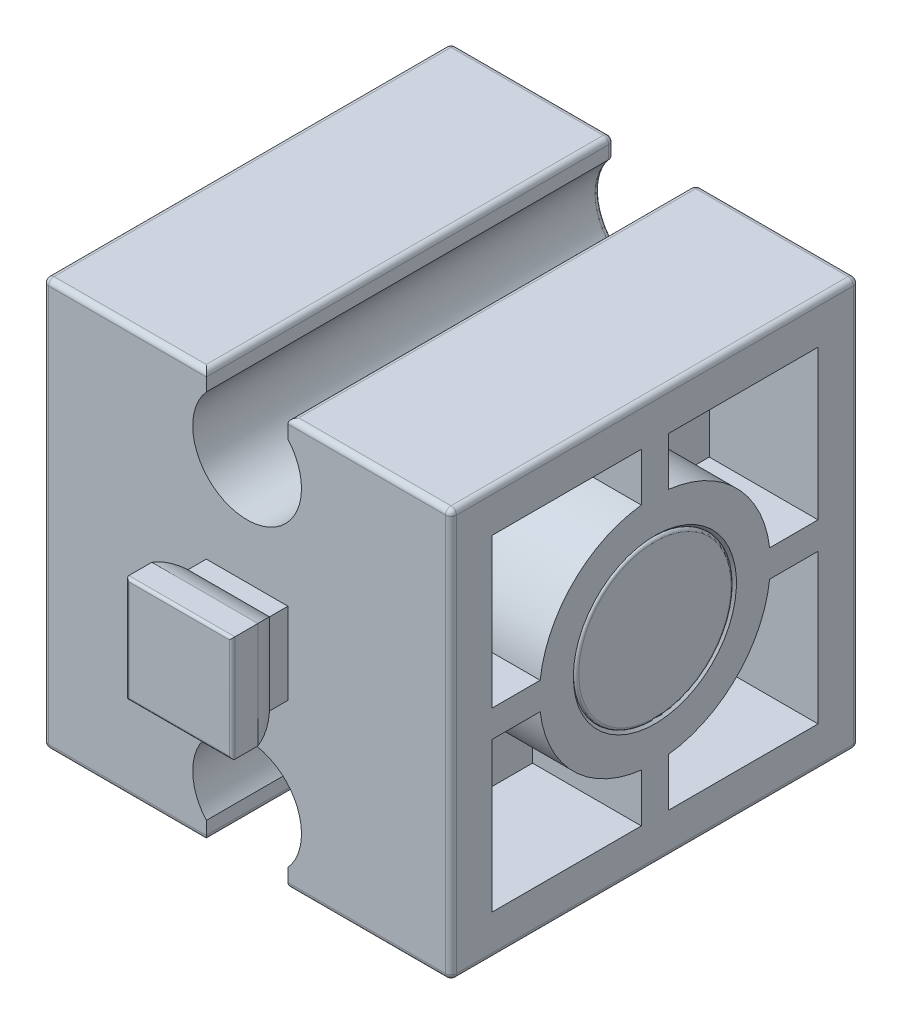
ISO-10303-21;
HEADER;
FILE_DESCRIPTION(('STEP AP214'),'2;1');
FILE_NAME('part.step','',(''),(''),'','','');
FILE_SCHEMA(('AUTOMOTIVE_DESIGN { 1 0 10303 214 1 1 1 1 }'));
ENDSEC;
DATA;
#1=APPLICATION_CONTEXT('core data for automotive mechanical design processes');
#2=APPLICATION_PROTOCOL_DEFINITION('international standard','automotive_design',2000,#1);
#3=PRODUCT_CONTEXT('',#1,'mechanical');
#4=PRODUCT('Part','Part','',(#3));
#5=PRODUCT_RELATED_PRODUCT_CATEGORY('part','',(#4));
#6=PRODUCT_DEFINITION_FORMATION('','',#4);
#7=PRODUCT_DEFINITION_CONTEXT('part definition',#1,'design');
#8=PRODUCT_DEFINITION('design','',#6,#7);
#9=PRODUCT_DEFINITION_SHAPE('','',#8);
#10=(LENGTH_UNIT() NAMED_UNIT(*) SI_UNIT(.MILLI.,.METRE.));
#11=(NAMED_UNIT(*) PLANE_ANGLE_UNIT() SI_UNIT($,.RADIAN.));
#12=(NAMED_UNIT(*) SI_UNIT($,.STERADIAN.) SOLID_ANGLE_UNIT());
#13=UNCERTAINTY_MEASURE_WITH_UNIT(LENGTH_MEASURE(1.E-05),#10,'distance_accuracy_value','');
#14=(GEOMETRIC_REPRESENTATION_CONTEXT(3) GLOBAL_UNCERTAINTY_ASSIGNED_CONTEXT((#13)) GLOBAL_UNIT_ASSIGNED_CONTEXT((#10,
#11,#12)) REPRESENTATION_CONTEXT('',''));
#15=CARTESIAN_POINT('',(0.,0.,0.));
#16=DIRECTION('',(0.,0.,1.));
#17=DIRECTION('',(1.,0.,0.));
#18=AXIS2_PLACEMENT_3D('',#15,#16,#17);
#19=CARTESIAN_POINT('',(-4.,0.,2.));
#20=DIRECTION('',(1.,0.,0.));
#21=DIRECTION('',(0.,0.,-1.));
#22=AXIS2_PLACEMENT_3D('',#19,#20,#21);
#23=CYLINDRICAL_SURFACE('',#22,2.);
#24=DIRECTION('',(1.,0.,0.));
#25=VECTOR('',#24,1.);
#26=CARTESIAN_POINT('',(-4.,-1.95,1.55559027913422));
#27=LINE('',#26,#25);
#28=CARTESIAN_POINT('',(-1.95,-1.95,1.55559027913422));
#29=VERTEX_POINT('',#28);
#30=CARTESIAN_POINT('',(1.95,-1.95,1.55559027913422));
#31=VERTEX_POINT('',#30);
#32=EDGE_CURVE('E132',#29,#31,#27,.T.);
#33=ORIENTED_EDGE('',*,*,#32,.F.);
#34=CARTESIAN_POINT('',(0.,0.,2.));
#35=DIRECTION('',(-0.707106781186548,0.707106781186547,0.));
#36=DIRECTION('',(0.707106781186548,0.707106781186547,0.));
#37=AXIS2_PLACEMENT_3D('',#34,#35,#36);
#38=ELLIPSE('',#37,2.82842712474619,2.);
#39=CARTESIAN_POINT('',(-1.5,-1.5,0.677124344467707));
#40=VERTEX_POINT('',#39);
#41=EDGE_CURVE('E116',#29,#40,#38,.F.);
#42=ORIENTED_EDGE('',*,*,#41,.T.);
#43=DIRECTION('',(1.,0.,0.));
#44=VECTOR('',#43,1.);
#45=CARTESIAN_POINT('',(-4.,-1.5,0.677124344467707));
#46=LINE('',#45,#44);
#47=CARTESIAN_POINT('',(1.5,-1.5,0.677124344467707));
#48=VERTEX_POINT('',#47);
#49=EDGE_CURVE('E130',#40,#48,#46,.T.);
#50=ORIENTED_EDGE('',*,*,#49,.T.);
#51=CARTESIAN_POINT('',(0.,0.,2.));
#52=DIRECTION('',(0.707106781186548,0.707106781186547,0.));
#53=DIRECTION('',(-0.707106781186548,0.707106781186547,0.));
#54=AXIS2_PLACEMENT_3D('',#51,#52,#53);
#55=ELLIPSE('',#54,2.82842712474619,2.);
#56=EDGE_CURVE('E174',#48,#31,#55,.F.);
#57=ORIENTED_EDGE('',*,*,#56,.T.);
#58=EDGE_LOOP('',(#33,#42,#50,#57));
#59=FACE_BOUND('',#58,.T.);
#60=ADVANCED_FACE('F46',(#59),#23,.T.);
#61=CARTESIAN_POINT('',(-4.,-1.95,2.5));
#62=DIRECTION('',(0.,-1.,0.));
#63=DIRECTION('',(0.,0.,-1.));
#64=AXIS2_PLACEMENT_3D('',#61,#62,#63);
#65=PLANE('',#64);
#66=DIRECTION('',(0.,0.,1.));
#67=VECTOR('',#66,1.);
#68=CARTESIAN_POINT('',(1.95,-1.95,2.5));
#69=LINE('',#68,#67);
#70=CARTESIAN_POINT('',(1.95,-1.95,2.4));
#71=VERTEX_POINT('',#70);
#72=EDGE_CURVE('E169',#31,#71,#69,.T.);
#73=ORIENTED_EDGE('',*,*,#72,.T.);
#74=DIRECTION('',(1.,0.,0.));
#75=VECTOR('',#74,1.);
#76=CARTESIAN_POINT('',(-4.,-1.95,2.4));
#77=LINE('',#76,#75);
#78=CARTESIAN_POINT('',(-1.95,-1.95,2.4));
#79=VERTEX_POINT('',#78);
#80=EDGE_CURVE('E70',#71,#79,#77,.F.);
#81=ORIENTED_EDGE('',*,*,#80,.T.);
#82=DIRECTION('',(0.,0.,-1.));
#83=VECTOR('',#82,1.);
#84=CARTESIAN_POINT('',(-1.95,-1.95,2.5));
#85=LINE('',#84,#83);
#86=EDGE_CURVE('E133',#79,#29,#85,.T.);
#87=ORIENTED_EDGE('',*,*,#86,.T.);
#88=ORIENTED_EDGE('',*,*,#32,.T.);
#89=EDGE_LOOP('',(#73,#81,#87,#88));
#90=FACE_BOUND('',#89,.T.);
#91=ADVANCED_FACE('F214',(#90),#65,.T.);
#92=CARTESIAN_POINT('',(-4.,1.95,2.5));
#93=DIRECTION('',(0.,0.,1.));
#94=DIRECTION('',(1.,0.,0.));
#95=AXIS2_PLACEMENT_3D('',#92,#93,#94);
#96=PLANE('',#95);
#97=DIRECTION('',(1.,0.,0.));
#98=VECTOR('',#97,1.);
#99=CARTESIAN_POINT('',(-4.,-1.85,2.5));
#100=LINE('',#99,#98);
#101=CARTESIAN_POINT('',(-1.85,-1.85,2.5));
#102=VERTEX_POINT('',#101);
#103=CARTESIAN_POINT('',(1.85,-1.85,2.5));
#104=VERTEX_POINT('',#103);
#105=EDGE_CURVE('E153',#102,#104,#100,.T.);
#106=ORIENTED_EDGE('',*,*,#105,.T.);
#107=DIRECTION('',(0.,-1.,0.));
#108=VECTOR('',#107,1.);
#109=CARTESIAN_POINT('',(1.85,1.95,2.5));
#110=LINE('',#109,#108);
#111=CARTESIAN_POINT('',(1.85,1.85,2.5));
#112=VERTEX_POINT('',#111);
#113=EDGE_CURVE('E155',#104,#112,#110,.F.);
#114=ORIENTED_EDGE('',*,*,#113,.T.);
#115=DIRECTION('',(1.,0.,0.));
#116=VECTOR('',#115,1.);
#117=CARTESIAN_POINT('',(-4.,1.85,2.5));
#118=LINE('',#117,#116);
#119=CARTESIAN_POINT('',(-1.85,1.85,2.5));
#120=VERTEX_POINT('',#119);
#121=EDGE_CURVE('E149',#112,#120,#118,.F.);
#122=ORIENTED_EDGE('',*,*,#121,.T.);
#123=DIRECTION('',(0.,-1.,0.));
#124=VECTOR('',#123,1.);
#125=CARTESIAN_POINT('',(-1.85,1.95,2.5));
#126=LINE('',#125,#124);
#127=EDGE_CURVE('E151',#120,#102,#126,.T.);
#128=ORIENTED_EDGE('',*,*,#127,.T.);
#129=EDGE_LOOP('',(#106,#114,#122,#128));
#130=FACE_BOUND('',#129,.T.);
#131=ADVANCED_FACE('F219',(#130),#96,.T.);
#132=CARTESIAN_POINT('',(-4.,1.95,2.5));
#133=DIRECTION('',(0.,1.,0.));
#134=DIRECTION('',(0.,0.,1.));
#135=AXIS2_PLACEMENT_3D('',#132,#133,#134);
#136=PLANE('',#135);
#137=DIRECTION('',(0.,0.,-1.));
#138=VECTOR('',#137,1.);
#139=CARTESIAN_POINT('',(-1.95,1.95,2.5));
#140=LINE('',#139,#138);
#141=CARTESIAN_POINT('',(-1.95,1.95,2.4));
#142=VERTEX_POINT('',#141);
#143=CARTESIAN_POINT('',(-1.95,1.95,1.55559027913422));
#144=VERTEX_POINT('',#143);
#145=EDGE_CURVE('E125',#142,#144,#140,.T.);
#146=ORIENTED_EDGE('',*,*,#145,.F.);
#147=DIRECTION('',(1.,0.,0.));
#148=VECTOR('',#147,1.);
#149=CARTESIAN_POINT('',(-4.,1.95,2.4));
#150=LINE('',#149,#148);
#151=CARTESIAN_POINT('',(1.95,1.95,2.4));
#152=VERTEX_POINT('',#151);
#153=EDGE_CURVE('E12',#142,#152,#150,.T.);
#154=ORIENTED_EDGE('',*,*,#153,.T.);
#155=DIRECTION('',(0.,0.,1.));
#156=VECTOR('',#155,1.);
#157=CARTESIAN_POINT('',(1.95,1.95,2.5));
#158=LINE('',#157,#156);
#159=CARTESIAN_POINT('',(1.95,1.95,1.55559027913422));
#160=VERTEX_POINT('',#159);
#161=EDGE_CURVE('E185',#160,#152,#158,.T.);
#162=ORIENTED_EDGE('',*,*,#161,.F.);
#163=DIRECTION('',(1.,0.,0.));
#164=VECTOR('',#163,1.);
#165=CARTESIAN_POINT('',(-4.,1.95,1.55559027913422));
#166=LINE('',#165,#164);
#167=EDGE_CURVE('E140',#144,#160,#166,.T.);
#168=ORIENTED_EDGE('',*,*,#167,.F.);
#169=EDGE_LOOP('',(#146,#154,#162,#168));
#170=FACE_BOUND('',#169,.T.);
#171=ADVANCED_FACE('F195',(#170),#136,.T.);
#172=CARTESIAN_POINT('',(-4.,0.,2.));
#173=DIRECTION('',(1.,0.,0.));
#174=DIRECTION('',(0.,0.,-1.));
#175=AXIS2_PLACEMENT_3D('',#172,#173,#174);
#176=CYLINDRICAL_SURFACE('',#175,2.);
#177=DIRECTION('',(1.,0.,0.));
#178=VECTOR('',#177,1.);
#179=CARTESIAN_POINT('',(-4.,1.5,0.677124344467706));
#180=LINE('',#179,#178);
#181=CARTESIAN_POINT('',(-1.5,1.5,0.677124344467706));
#182=VERTEX_POINT('',#181);
#183=CARTESIAN_POINT('',(1.5,1.5,0.677124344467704));
#184=VERTEX_POINT('',#183);
#185=EDGE_CURVE('E138',#182,#184,#180,.T.);
#186=ORIENTED_EDGE('',*,*,#185,.F.);
#187=CARTESIAN_POINT('',(0.,0.,2.));
#188=DIRECTION('',(-0.707106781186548,-0.707106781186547,0.));
#189=DIRECTION('',(0.707106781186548,-0.707106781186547,0.));
#190=AXIS2_PLACEMENT_3D('',#187,#188,#189);
#191=ELLIPSE('',#190,2.82842712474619,2.);
#192=EDGE_CURVE('E119',#144,#182,#191,.T.);
#193=ORIENTED_EDGE('',*,*,#192,.F.);
#194=ORIENTED_EDGE('',*,*,#167,.T.);
#195=CARTESIAN_POINT('',(0.,0.,2.));
#196=DIRECTION('',(0.707106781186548,-0.707106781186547,0.));
#197=DIRECTION('',(-0.707106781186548,-0.707106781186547,0.));
#198=AXIS2_PLACEMENT_3D('',#195,#196,#197);
#199=ELLIPSE('',#198,2.82842712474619,2.);
#200=EDGE_CURVE('E177',#184,#160,#199,.T.);
#201=ORIENTED_EDGE('',*,*,#200,.F.);
#202=EDGE_LOOP('',(#186,#193,#194,#201));
#203=FACE_BOUND('',#202,.T.);
#204=ADVANCED_FACE('F192',(#203),#176,.T.);
#205=CARTESIAN_POINT('',(-4.,1.5,0.677124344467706));
#206=DIRECTION('',(0.,0.,-1.));
#207=DIRECTION('',(0.,1.,0.));
#208=AXIS2_PLACEMENT_3D('',#205,#206,#207);
#209=PLANE('',#208);
#210=ORIENTED_EDGE('',*,*,#49,.F.);
#211=DIRECTION('',(0.,-1.,0.));
#212=VECTOR('',#211,1.);
#213=CARTESIAN_POINT('',(-1.5,7.501,0.677124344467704));
#214=LINE('',#213,#212);
#215=EDGE_CURVE('E112',#182,#40,#214,.T.);
#216=ORIENTED_EDGE('',*,*,#215,.F.);
#217=ORIENTED_EDGE('',*,*,#185,.T.);
#218=DIRECTION('',(0.,-1.,0.));
#219=VECTOR('',#218,1.);
#220=CARTESIAN_POINT('',(1.5,7.501,0.677124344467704));
#221=LINE('',#220,#219);
#222=EDGE_CURVE('E137',#184,#48,#221,.T.);
#223=ORIENTED_EDGE('',*,*,#222,.T.);
#224=EDGE_LOOP('',(#210,#216,#217,#223));
#225=FACE_BOUND('',#224,.T.);
#226=ADVANCED_FACE('F136',(#225),#209,.T.);
#227=CARTESIAN_POINT('',(0.,7.501,2.));
#228=DIRECTION('',(0.,-1.,0.));
#229=DIRECTION('',(0.,0.,-1.));
#230=AXIS2_PLACEMENT_3D('',#227,#228,#229);
#231=CYLINDRICAL_SURFACE('',#230,2.);
#232=ORIENTED_EDGE('',*,*,#200,.T.);
#233=DIRECTION('',(0.,-1.,0.));
#234=VECTOR('',#233,1.);
#235=CARTESIAN_POINT('',(1.95,7.501,1.55559027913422));
#236=LINE('',#235,#234);
#237=EDGE_CURVE('E182',#160,#31,#236,.T.);
#238=ORIENTED_EDGE('',*,*,#237,.T.);
#239=ORIENTED_EDGE('',*,*,#56,.F.);
#240=ORIENTED_EDGE('',*,*,#222,.F.);
#241=EDGE_LOOP('',(#232,#238,#239,#240));
#242=FACE_BOUND('',#241,.T.);
#243=ADVANCED_FACE('F224',(#242),#231,.T.);
#244=CARTESIAN_POINT('',(1.95,7.501,2.5));
#245=DIRECTION('',(1.,0.,0.));
#246=DIRECTION('',(0.,0.,-1.));
#247=AXIS2_PLACEMENT_3D('',#244,#245,#246);
#248=PLANE('',#247);
#249=ORIENTED_EDGE('',*,*,#161,.T.);
#250=DIRECTION('',(0.,-1.,0.));
#251=VECTOR('',#250,1.);
#252=CARTESIAN_POINT('',(1.95,7.501,2.4));
#253=LINE('',#252,#251);
#254=EDGE_CURVE('E146',#152,#71,#253,.T.);
#255=ORIENTED_EDGE('',*,*,#254,.T.);
#256=ORIENTED_EDGE('',*,*,#72,.F.);
#257=ORIENTED_EDGE('',*,*,#237,.F.);
#258=EDGE_LOOP('',(#249,#255,#256,#257));
#259=FACE_BOUND('',#258,.T.);
#260=ADVANCED_FACE('F198',(#259),#248,.T.);
#261=CARTESIAN_POINT('',(-1.95,7.501,2.5));
#262=DIRECTION('',(-1.,0.,0.));
#263=DIRECTION('',(0.,0.,1.));
#264=AXIS2_PLACEMENT_3D('',#261,#262,#263);
#265=PLANE('',#264);
#266=ORIENTED_EDGE('',*,*,#86,.F.);
#267=DIRECTION('',(0.,-1.,0.));
#268=VECTOR('',#267,1.);
#269=CARTESIAN_POINT('',(-1.95,7.501,2.4));
#270=LINE('',#269,#268);
#271=EDGE_CURVE('E55',#79,#142,#270,.F.);
#272=ORIENTED_EDGE('',*,*,#271,.T.);
#273=ORIENTED_EDGE('',*,*,#145,.T.);
#274=DIRECTION('',(0.,-1.,0.));
#275=VECTOR('',#274,1.);
#276=CARTESIAN_POINT('',(-1.95,7.501,1.55559027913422));
#277=LINE('',#276,#275);
#278=EDGE_CURVE('E124',#144,#29,#277,.T.);
#279=ORIENTED_EDGE('',*,*,#278,.T.);
#280=EDGE_LOOP('',(#266,#272,#273,#279));
#281=FACE_BOUND('',#280,.T.);
#282=ADVANCED_FACE('F237',(#281),#265,.T.);
#283=CARTESIAN_POINT('',(0.,7.501,2.));
#284=DIRECTION('',(0.,-1.,0.));
#285=DIRECTION('',(0.,0.,-1.));
#286=AXIS2_PLACEMENT_3D('',#283,#284,#285);
#287=CYLINDRICAL_SURFACE('',#286,2.);
#288=ORIENTED_EDGE('',*,*,#192,.T.);
#289=ORIENTED_EDGE('',*,*,#215,.T.);
#290=ORIENTED_EDGE('',*,*,#41,.F.);
#291=ORIENTED_EDGE('',*,*,#278,.F.);
#292=EDGE_LOOP('',(#288,#289,#290,#291));
#293=FACE_BOUND('',#292,.T.);
#294=ADVANCED_FACE('F114',(#293),#287,.T.);
#295=CARTESIAN_POINT('',(-1.85,1.95,2.4));
#296=DIRECTION('',(0.,-1.,0.));
#297=DIRECTION('',(0.,0.,-1.));
#298=AXIS2_PLACEMENT_3D('',#295,#296,#297);
#299=CYLINDRICAL_SURFACE('',#298,0.1);
#300=CARTESIAN_POINT('',(-1.85,-1.85,2.4));
#301=DIRECTION('',(0.707106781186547,-0.707106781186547,0.));
#302=DIRECTION('',(-0.707106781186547,-0.707106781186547,0.));
#303=AXIS2_PLACEMENT_3D('',#300,#301,#302);
#304=ELLIPSE('',#303,0.14142135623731,0.1);
#305=EDGE_CURVE('E163',#102,#79,#304,.T.);
#306=ORIENTED_EDGE('',*,*,#305,.F.);
#307=ORIENTED_EDGE('',*,*,#127,.F.);
#308=CARTESIAN_POINT('',(-1.85,1.85,2.4));
#309=DIRECTION('',(0.707106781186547,0.707106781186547,0.));
#310=DIRECTION('',(0.707106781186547,-0.707106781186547,0.));
#311=AXIS2_PLACEMENT_3D('',#308,#309,#310);
#312=ELLIPSE('',#311,0.14142135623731,0.1);
#313=EDGE_CURVE('E50',#142,#120,#312,.T.);
#314=ORIENTED_EDGE('',*,*,#313,.F.);
#315=ORIENTED_EDGE('',*,*,#271,.F.);
#316=EDGE_LOOP('',(#306,#307,#314,#315));
#317=FACE_BOUND('',#316,.T.);
#318=ADVANCED_FACE('F48',(#317),#299,.T.);
#319=CARTESIAN_POINT('',(-4.,1.85,2.4));
#320=DIRECTION('',(1.,0.,0.));
#321=DIRECTION('',(0.,0.,-1.));
#322=AXIS2_PLACEMENT_3D('',#319,#320,#321);
#323=CYLINDRICAL_SURFACE('',#322,0.1);
#324=ORIENTED_EDGE('',*,*,#313,.T.);
#325=ORIENTED_EDGE('',*,*,#121,.F.);
#326=CARTESIAN_POINT('',(1.85,1.85,2.4));
#327=DIRECTION('',(0.707106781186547,-0.707106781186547,0.));
#328=DIRECTION('',(0.707106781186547,0.707106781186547,0.));
#329=AXIS2_PLACEMENT_3D('',#326,#327,#328);
#330=ELLIPSE('',#329,0.14142135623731,0.1);
#331=EDGE_CURVE('E162',#152,#112,#330,.T.);
#332=ORIENTED_EDGE('',*,*,#331,.F.);
#333=ORIENTED_EDGE('',*,*,#153,.F.);
#334=EDGE_LOOP('',(#324,#325,#332,#333));
#335=FACE_BOUND('',#334,.T.);
#336=ADVANCED_FACE('F200',(#335),#323,.T.);
#337=CARTESIAN_POINT('',(-4.,-1.85,2.4));
#338=DIRECTION('',(1.,0.,0.));
#339=DIRECTION('',(0.,0.,-1.));
#340=AXIS2_PLACEMENT_3D('',#337,#338,#339);
#341=CYLINDRICAL_SURFACE('',#340,0.1);
#342=ORIENTED_EDGE('',*,*,#305,.T.);
#343=ORIENTED_EDGE('',*,*,#80,.F.);
#344=CARTESIAN_POINT('',(1.85,-1.85,2.4));
#345=DIRECTION('',(0.707106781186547,0.707106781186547,0.));
#346=DIRECTION('',(0.707106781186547,-0.707106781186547,0.));
#347=AXIS2_PLACEMENT_3D('',#344,#345,#346);
#348=ELLIPSE('',#347,0.14142135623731,0.1);
#349=EDGE_CURVE('E160',#104,#71,#348,.T.);
#350=ORIENTED_EDGE('',*,*,#349,.F.);
#351=ORIENTED_EDGE('',*,*,#105,.F.);
#352=EDGE_LOOP('',(#342,#343,#350,#351));
#353=FACE_BOUND('',#352,.T.);
#354=ADVANCED_FACE('F205',(#353),#341,.T.);
#355=CARTESIAN_POINT('',(1.85,7.501,2.4));
#356=DIRECTION('',(0.,-1.,0.));
#357=DIRECTION('',(0.,0.,-1.));
#358=AXIS2_PLACEMENT_3D('',#355,#356,#357);
#359=CYLINDRICAL_SURFACE('',#358,0.1);
#360=ORIENTED_EDGE('',*,*,#331,.T.);
#361=ORIENTED_EDGE('',*,*,#113,.F.);
#362=ORIENTED_EDGE('',*,*,#349,.T.);
#363=ORIENTED_EDGE('',*,*,#254,.F.);
#364=EDGE_LOOP('',(#360,#361,#362,#363));
#365=FACE_BOUND('',#364,.T.);
#366=ADVANCED_FACE('F203',(#365),#359,.T.);
#367=CLOSED_SHELL('',(#60,#91,#131,#171,#204,#226,#243,#260,#282,#294,#318,#336,#354,#366));
#368=MANIFOLD_SOLID_BREP('B2',#367);
#369=CARTESIAN_POINT('',(7.5,-7.5,-15.));
#370=DIRECTION('',(1.,0.,0.));
#371=DIRECTION('',(0.,0.,-1.));
#372=AXIS2_PLACEMENT_3D('',#369,#370,#371);
#373=PLANE('',#372);
#374=DIRECTION('',(0.,0.,1.));
#375=VECTOR('',#374,1.);
#376=CARTESIAN_POINT('',(7.5,-7.3,-15.));
#377=LINE('',#376,#375);
#378=CARTESIAN_POINT('',(7.5,-7.3,-0.2));
#379=VERTEX_POINT('',#378);
#380=CARTESIAN_POINT('',(7.5,-7.3,-14.8));
#381=VERTEX_POINT('',#380);
#382=EDGE_CURVE('E1325',#379,#381,#377,.F.);
#383=ORIENTED_EDGE('',*,*,#382,.T.);
#384=DIRECTION('',(0.,1.,0.));
#385=VECTOR('',#384,1.);
#386=CARTESIAN_POINT('',(7.5,-7.5,-14.8));
#387=LINE('',#386,#385);
#388=CARTESIAN_POINT('',(7.5,7.3,-14.8));
#389=VERTEX_POINT('',#388);
#390=EDGE_CURVE('E1330',#381,#389,#387,.T.);
#391=ORIENTED_EDGE('',*,*,#390,.T.);
#392=DIRECTION('',(0.,0.,1.));
#393=VECTOR('',#392,1.);
#394=CARTESIAN_POINT('',(7.5,7.3,-15.));
#395=LINE('',#394,#393);
#396=CARTESIAN_POINT('',(7.5,7.3,-0.2));
#397=VERTEX_POINT('',#396);
#398=EDGE_CURVE('E1327',#389,#397,#395,.T.);
#399=ORIENTED_EDGE('',*,*,#398,.T.);
#400=DIRECTION('',(0.,1.,0.));
#401=VECTOR('',#400,1.);
#402=CARTESIAN_POINT('',(7.5,-7.5,-0.2));
#403=LINE('',#402,#401);
#404=EDGE_CURVE('E1323',#397,#379,#403,.F.);
#405=ORIENTED_EDGE('',*,*,#404,.T.);
#406=EDGE_LOOP('',(#383,#391,#399,#405));
#407=FACE_BOUND('',#406,.T.);
#408=DIRECTION('',(0.,-1.,0.));
#409=VECTOR('',#408,1.);
#410=CARTESIAN_POINT('',(7.5,4.22048575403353,-8.));
#411=LINE('',#410,#409);
#412=CARTESIAN_POINT('',(7.5,6.,-8.));
#413=VERTEX_POINT('',#412);
#414=CARTESIAN_POINT('',(7.5,4.2204857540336,-8.00000000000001));
#415=VERTEX_POINT('',#414);
#416=EDGE_CURVE('E957',#413,#415,#411,.T.);
#417=ORIENTED_EDGE('',*,*,#416,.F.);
#418=DIRECTION('',(0.,0.,1.));
#419=VECTOR('',#418,1.);
#420=CARTESIAN_POINT('',(7.5,6.,-13.5));
#421=LINE('',#420,#419);
#422=CARTESIAN_POINT('',(7.5,6.,-13.5));
#423=VERTEX_POINT('',#422);
#424=EDGE_CURVE('E970',#423,#413,#421,.T.);
#425=ORIENTED_EDGE('',*,*,#424,.F.);
#426=DIRECTION('',(0.,1.,0.));
#427=VECTOR('',#426,1.);
#428=CARTESIAN_POINT('',(7.5,6.,-13.5));
#429=LINE('',#428,#427);
#430=CARTESIAN_POINT('',(7.5,0.500000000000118,-13.5000000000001));
#431=VERTEX_POINT('',#430);
#432=EDGE_CURVE('E990',#431,#423,#429,.T.);
#433=ORIENTED_EDGE('',*,*,#432,.F.);
#434=DIRECTION('',(0.,0.,-1.));
#435=VECTOR('',#434,1.);
#436=CARTESIAN_POINT('',(7.5,0.500000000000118,-11.7204857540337));
#437=LINE('',#436,#435);
#438=CARTESIAN_POINT('',(7.5,0.500000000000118,-11.7204857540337));
#439=VERTEX_POINT('',#438);
#440=EDGE_CURVE('E987',#439,#431,#437,.T.);
#441=ORIENTED_EDGE('',*,*,#440,.F.);
#442=CARTESIAN_POINT('',(7.5,0.,-7.5));
#443=DIRECTION('',(-1.,0.,0.));
#444=DIRECTION('',(0.,0.,-1.));
#445=AXIS2_PLACEMENT_3D('',#442,#443,#444);
#446=CIRCLE('',#445,4.25000000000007);
#447=EDGE_CURVE('E984',#415,#439,#446,.T.);
#448=ORIENTED_EDGE('',*,*,#447,.F.);
#449=EDGE_LOOP('',(#417,#425,#433,#441,#448));
#450=FACE_BOUND('',#449,.T.);
#451=DIRECTION('',(0.,1.,0.));
#452=VECTOR('',#451,1.);
#453=CARTESIAN_POINT('',(7.5,-0.499999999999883,-13.5000000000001));
#454=LINE('',#453,#452);
#455=CARTESIAN_POINT('',(7.5,-6.,-13.5));
#456=VERTEX_POINT('',#455);
#457=CARTESIAN_POINT('',(7.5,-0.499999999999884,-13.5000000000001));
#458=VERTEX_POINT('',#457);
#459=EDGE_CURVE('E918',#456,#458,#454,.T.);
#460=ORIENTED_EDGE('',*,*,#459,.F.);
#461=DIRECTION('',(0.,0.,-1.));
#462=VECTOR('',#461,1.);
#463=CARTESIAN_POINT('',(7.5,-6.,-13.5));
#464=LINE('',#463,#462);
#465=CARTESIAN_POINT('',(7.5,-6.,-8.00000000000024));
#466=VERTEX_POINT('',#465);
#467=EDGE_CURVE('E930',#466,#456,#464,.T.);
#468=ORIENTED_EDGE('',*,*,#467,.F.);
#469=DIRECTION('',(0.,-1.,0.));
#470=VECTOR('',#469,1.);
#471=CARTESIAN_POINT('',(7.5,-4.22048575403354,-8.00000000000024));
#472=LINE('',#471,#470);
#473=CARTESIAN_POINT('',(7.5,-4.22048575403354,-8.00000000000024));
#474=VERTEX_POINT('',#473);
#475=EDGE_CURVE('E950',#474,#466,#472,.T.);
#476=ORIENTED_EDGE('',*,*,#475,.F.);
#477=CARTESIAN_POINT('',(7.5,0.,-7.5));
#478=DIRECTION('',(-1.,0.,0.));
#479=DIRECTION('',(0.,0.,-1.));
#480=AXIS2_PLACEMENT_3D('',#477,#478,#479);
#481=CIRCLE('',#480,4.25000000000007);
#482=CARTESIAN_POINT('',(7.5,-0.499999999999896,-11.7204857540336));
#483=VERTEX_POINT('',#482);
#484=EDGE_CURVE('E947',#483,#474,#481,.T.);
#485=ORIENTED_EDGE('',*,*,#484,.F.);
#486=DIRECTION('',(0.,0.,1.));
#487=VECTOR('',#486,1.);
#488=CARTESIAN_POINT('',(7.5,-0.499999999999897,-11.7204857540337));
#489=LINE('',#488,#487);
#490=EDGE_CURVE('E944',#458,#483,#489,.T.);
#491=ORIENTED_EDGE('',*,*,#490,.F.);
#492=EDGE_LOOP('',(#460,#468,#476,#485,#491));
#493=FACE_BOUND('',#492,.T.);
#494=DIRECTION('',(0.,-1.,0.));
#495=VECTOR('',#494,1.);
#496=CARTESIAN_POINT('',(7.5,-0.500000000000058,-1.50000000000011));
#497=LINE('',#496,#495);
#498=CARTESIAN_POINT('',(7.5,-0.500000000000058,-1.50000000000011));
#499=VERTEX_POINT('',#498);
#500=CARTESIAN_POINT('',(7.5,-6.,-1.5));
#501=VERTEX_POINT('',#500);
#502=EDGE_CURVE('E352',#499,#501,#497,.T.);
#503=ORIENTED_EDGE('',*,*,#502,.F.);
#504=DIRECTION('',(0.,0.,1.));
#505=VECTOR('',#504,1.);
#506=CARTESIAN_POINT('',(7.5,-0.500000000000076,-3.27951424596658));
#507=LINE('',#506,#505);
#508=CARTESIAN_POINT('',(7.5,-0.500000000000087,-3.27951424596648));
#509=VERTEX_POINT('',#508);
#510=EDGE_CURVE('E891',#509,#499,#507,.T.);
#511=ORIENTED_EDGE('',*,*,#510,.F.);
#512=CARTESIAN_POINT('',(7.5,0.,-7.5));
#513=DIRECTION('',(-1.,0.,0.));
#514=DIRECTION('',(0.,0.,-1.));
#515=AXIS2_PLACEMENT_3D('',#512,#513,#514);
#516=CIRCLE('',#515,4.25);
#517=CARTESIAN_POINT('',(7.5,-4.22048575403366,-7.00000000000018));
#518=VERTEX_POINT('',#517);
#519=EDGE_CURVE('E911',#518,#509,#516,.T.);
#520=ORIENTED_EDGE('',*,*,#519,.F.);
#521=DIRECTION('',(0.,1.,0.));
#522=VECTOR('',#521,1.);
#523=CARTESIAN_POINT('',(7.5,-4.22048575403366,-7.00000000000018));
#524=LINE('',#523,#522);
#525=CARTESIAN_POINT('',(7.5,-6.,-7.00000000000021));
#526=VERTEX_POINT('',#525);
#527=EDGE_CURVE('E908',#526,#518,#524,.T.);
#528=ORIENTED_EDGE('',*,*,#527,.F.);
#529=DIRECTION('',(0.,0.,-1.));
#530=VECTOR('',#529,1.);
#531=CARTESIAN_POINT('',(7.5,-6.,-7.00000000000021));
#532=LINE('',#531,#530);
#533=EDGE_CURVE('E905',#501,#526,#532,.T.);
#534=ORIENTED_EDGE('',*,*,#533,.F.);
#535=EDGE_LOOP('',(#503,#511,#520,#528,#534));
#536=FACE_BOUND('',#535,.T.);
#537=DIRECTION('',(0.,0.,1.));
#538=VECTOR('',#537,1.);
#539=CARTESIAN_POINT('',(7.5,6.,-7.));
#540=LINE('',#539,#538);
#541=CARTESIAN_POINT('',(7.5,6.,-7.));
#542=VERTEX_POINT('',#541);
#543=CARTESIAN_POINT('',(7.5,6.,-1.5));
#544=VERTEX_POINT('',#543);
#545=EDGE_CURVE('E344',#542,#544,#540,.T.);
#546=ORIENTED_EDGE('',*,*,#545,.F.);
#547=DIRECTION('',(0.,1.,0.));
#548=VECTOR('',#547,1.);
#549=CARTESIAN_POINT('',(7.5,4.22048575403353,-7.));
#550=LINE('',#549,#548);
#551=CARTESIAN_POINT('',(7.5,4.22048575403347,-7.00000000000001));
#552=VERTEX_POINT('',#551);
#553=EDGE_CURVE('E859',#552,#542,#550,.T.);
#554=ORIENTED_EDGE('',*,*,#553,.F.);
#555=CARTESIAN_POINT('',(7.5,0.,-7.5));
#556=DIRECTION('',(-1.,0.,0.));
#557=DIRECTION('',(0.,0.,-1.));
#558=AXIS2_PLACEMENT_3D('',#555,#556,#557);
#559=CIRCLE('',#558,4.24999999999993);
#560=CARTESIAN_POINT('',(7.5,0.499999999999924,-3.27951424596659));
#561=VERTEX_POINT('',#560);
#562=EDGE_CURVE('E862',#561,#552,#559,.T.);
#563=ORIENTED_EDGE('',*,*,#562,.F.);
#564=DIRECTION('',(0.,0.,-1.));
#565=VECTOR('',#564,1.);
#566=CARTESIAN_POINT('',(7.5,0.499999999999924,-3.27951424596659));
#567=LINE('',#566,#565);
#568=CARTESIAN_POINT('',(7.5,0.499999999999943,-1.50000000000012));
#569=VERTEX_POINT('',#568);
#570=EDGE_CURVE('E875',#569,#561,#567,.T.);
#571=ORIENTED_EDGE('',*,*,#570,.F.);
#572=DIRECTION('',(0.,-1.,0.));
#573=VECTOR('',#572,1.);
#574=CARTESIAN_POINT('',(7.5,6.,-1.5));
#575=LINE('',#574,#573);
#576=EDGE_CURVE('E873',#544,#569,#575,.T.);
#577=ORIENTED_EDGE('',*,*,#576,.F.);
#578=EDGE_LOOP('',(#546,#554,#563,#571,#577));
#579=FACE_BOUND('',#578,.T.);
#580=CARTESIAN_POINT('',(7.5,0.,-7.5));
#581=DIRECTION('',(-1.,0.,0.));
#582=DIRECTION('',(0.,0.,1.));
#583=AXIS2_PLACEMENT_3D('',#580,#581,#582);
#584=CIRCLE('',#583,3.);
#585=CARTESIAN_POINT('',(7.5,0.,-4.5));
#586=VERTEX_POINT('',#585);
#587=EDGE_CURVE('E1755',#586,#586,#584,.T.);
#588=ORIENTED_EDGE('',*,*,#587,.T.);
#589=EDGE_LOOP('',(#588));
#590=FACE_BOUND('',#589,.T.);
#591=ADVANCED_FACE('F329',(#407,#450,#493,#536,#579,#590),#373,.T.);
#592=CARTESIAN_POINT('',(-7.5,7.5,-15.));
#593=DIRECTION('',(0.,0.,-1.));
#594=DIRECTION('',(-1.,0.,0.));
#595=AXIS2_PLACEMENT_3D('',#592,#593,#594);
#596=PLANE('',#595);
#597=DIRECTION('',(0.,1.,0.));
#598=VECTOR('',#597,1.);
#599=CARTESIAN_POINT('',(1.7,-6.8228756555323,-15.));
#600=LINE('',#599,#598);
#601=CARTESIAN_POINT('',(1.7,-7.3,-15.));
#602=VERTEX_POINT('',#601);
#603=CARTESIAN_POINT('',(1.7,-6.896424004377,-15.));
#604=VERTEX_POINT('',#603);
#605=EDGE_CURVE('E1426',#602,#604,#600,.T.);
#606=ORIENTED_EDGE('',*,*,#605,.T.);
#607=CARTESIAN_POINT('',(0.,-5.5,-15.));
#608=DIRECTION('',(0.,0.,-1.));
#609=DIRECTION('',(-1.,0.,0.));
#610=AXIS2_PLACEMENT_3D('',#607,#608,#609);
#611=CIRCLE('',#610,2.2);
#612=CARTESIAN_POINT('',(-1.7,-6.896424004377,-15.));
#613=VERTEX_POINT('',#612);
#614=EDGE_CURVE('E1428',#604,#613,#611,.F.);
#615=ORIENTED_EDGE('',*,*,#614,.T.);
#616=DIRECTION('',(0.,-1.,0.));
#617=VECTOR('',#616,1.);
#618=CARTESIAN_POINT('',(-1.7,-7.5,-15.));
#619=LINE('',#618,#617);
#620=CARTESIAN_POINT('',(-1.7,-7.3,-15.));
#621=VERTEX_POINT('',#620);
#622=EDGE_CURVE('E1406',#613,#621,#619,.T.);
#623=ORIENTED_EDGE('',*,*,#622,.T.);
#624=DIRECTION('',(1.,0.,0.));
#625=VECTOR('',#624,1.);
#626=CARTESIAN_POINT('',(-7.5,-7.3,-15.));
#627=LINE('',#626,#625);
#628=CARTESIAN_POINT('',(-7.3,-7.3,-15.));
#629=VERTEX_POINT('',#628);
#630=EDGE_CURVE('E1408',#621,#629,#627,.F.);
#631=ORIENTED_EDGE('',*,*,#630,.T.);
#632=DIRECTION('',(0.,-1.,0.));
#633=VECTOR('',#632,1.);
#634=CARTESIAN_POINT('',(-7.3,7.5,-15.));
#635=LINE('',#634,#633);
#636=CARTESIAN_POINT('',(-7.3,7.3,-15.));
#637=VERTEX_POINT('',#636);
#638=EDGE_CURVE('E1410',#629,#637,#635,.F.);
#639=ORIENTED_EDGE('',*,*,#638,.T.);
#640=DIRECTION('',(-1.,0.,0.));
#641=VECTOR('',#640,1.);
#642=CARTESIAN_POINT('',(-7.5,7.3,-15.));
#643=LINE('',#642,#641);
#644=CARTESIAN_POINT('',(-1.7,7.3,-15.));
#645=VERTEX_POINT('',#644);
#646=EDGE_CURVE('E1412',#637,#645,#643,.F.);
#647=ORIENTED_EDGE('',*,*,#646,.T.);
#648=DIRECTION('',(0.,-1.,0.));
#649=VECTOR('',#648,1.);
#650=CARTESIAN_POINT('',(-1.7,6.82287565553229,-15.));
#651=LINE('',#650,#649);
#652=CARTESIAN_POINT('',(-1.7,6.896424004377,-15.));
#653=VERTEX_POINT('',#652);
#654=EDGE_CURVE('E1414',#645,#653,#651,.T.);
#655=ORIENTED_EDGE('',*,*,#654,.T.);
#656=CARTESIAN_POINT('',(0.,5.5,-15.));
#657=DIRECTION('',(0.,0.,-1.));
#658=DIRECTION('',(-1.,0.,0.));
#659=AXIS2_PLACEMENT_3D('',#656,#657,#658);
#660=CIRCLE('',#659,2.2);
#661=CARTESIAN_POINT('',(1.69999999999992,6.896424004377,-15.));
#662=VERTEX_POINT('',#661);
#663=EDGE_CURVE('E1416',#653,#662,#660,.F.);
#664=ORIENTED_EDGE('',*,*,#663,.T.);
#665=DIRECTION('',(0.,1.,0.));
#666=VECTOR('',#665,1.);
#667=CARTESIAN_POINT('',(1.7,7.5,-15.));
#668=LINE('',#667,#666);
#669=CARTESIAN_POINT('',(1.7,7.3,-15.));
#670=VERTEX_POINT('',#669);
#671=EDGE_CURVE('E1418',#662,#670,#668,.T.);
#672=ORIENTED_EDGE('',*,*,#671,.T.);
#673=DIRECTION('',(-1.,0.,0.));
#674=VECTOR('',#673,1.);
#675=CARTESIAN_POINT('',(-7.5,7.3,-15.));
#676=LINE('',#675,#674);
#677=CARTESIAN_POINT('',(7.3,7.3,-15.));
#678=VERTEX_POINT('',#677);
#679=EDGE_CURVE('E1420',#670,#678,#676,.F.);
#680=ORIENTED_EDGE('',*,*,#679,.T.);
#681=DIRECTION('',(0.,1.,0.));
#682=VECTOR('',#681,1.);
#683=CARTESIAN_POINT('',(7.3,7.5,-15.));
#684=LINE('',#683,#682);
#685=CARTESIAN_POINT('',(7.3,-7.3,-15.));
#686=VERTEX_POINT('',#685);
#687=EDGE_CURVE('E1422',#678,#686,#684,.F.);
#688=ORIENTED_EDGE('',*,*,#687,.T.);
#689=DIRECTION('',(1.,0.,0.));
#690=VECTOR('',#689,1.);
#691=CARTESIAN_POINT('',(-7.5,-7.3,-15.));
#692=LINE('',#691,#690);
#693=EDGE_CURVE('E1424',#686,#602,#692,.F.);
#694=ORIENTED_EDGE('',*,*,#693,.T.);
#695=EDGE_LOOP('',(#606,#615,#623,#631,#639,#647,#655,#664,#672,#680,#688,#694));
#696=FACE_BOUND('',#695,.T.);
#697=DIRECTION('',(-1.,0.,0.));
#698=VECTOR('',#697,1.);
#699=CARTESIAN_POINT('',(-1.5,1.5,-15.));
#700=LINE('',#699,#698);
#701=CARTESIAN_POINT('',(1.5,1.5,-15.));
#702=VERTEX_POINT('',#701);
#703=CARTESIAN_POINT('',(-1.5,1.5,-15.));
#704=VERTEX_POINT('',#703);
#705=EDGE_CURVE('E1080',#702,#704,#700,.T.);
#706=ORIENTED_EDGE('',*,*,#705,.T.);
#707=DIRECTION('',(0.,-1.,0.));
#708=VECTOR('',#707,1.);
#709=CARTESIAN_POINT('',(-1.5,-1.5,-15.));
#710=LINE('',#709,#708);
#711=CARTESIAN_POINT('',(-1.5,-1.5,-15.));
#712=VERTEX_POINT('',#711);
#713=EDGE_CURVE('E1097',#704,#712,#710,.T.);
#714=ORIENTED_EDGE('',*,*,#713,.T.);
#715=DIRECTION('',(1.,0.,0.));
#716=VECTOR('',#715,1.);
#717=CARTESIAN_POINT('',(-1.5,-1.5,-15.));
#718=LINE('',#717,#716);
#719=CARTESIAN_POINT('',(1.5,-1.5,-15.));
#720=VERTEX_POINT('',#719);
#721=EDGE_CURVE('E1092',#712,#720,#718,.T.);
#722=ORIENTED_EDGE('',*,*,#721,.T.);
#723=DIRECTION('',(0.,1.,0.));
#724=VECTOR('',#723,1.);
#725=CARTESIAN_POINT('',(1.5,-1.5,-15.));
#726=LINE('',#725,#724);
#727=EDGE_CURVE('E1087',#720,#702,#726,.T.);
#728=ORIENTED_EDGE('',*,*,#727,.T.);
#729=EDGE_LOOP('',(#706,#714,#722,#728));
#730=FACE_BOUND('',#729,.T.);
#731=ADVANCED_FACE('F1683',(#696,#730),#596,.T.);
#732=CARTESIAN_POINT('',(-7.5,-7.5,-15.));
#733=DIRECTION('',(0.,-1.,0.));
#734=DIRECTION('',(0.,0.,-1.));
#735=AXIS2_PLACEMENT_3D('',#732,#733,#734);
#736=PLANE('',#735);
#737=DIRECTION('',(1.,0.,0.));
#738=VECTOR('',#737,1.);
#739=CARTESIAN_POINT('',(-7.5,-7.5,-0.2));
#740=LINE('',#739,#738);
#741=CARTESIAN_POINT('',(-1.7,-7.5,-0.2));
#742=VERTEX_POINT('',#741);
#743=CARTESIAN_POINT('',(-7.3,-7.5,-0.2));
#744=VERTEX_POINT('',#743);
#745=EDGE_CURVE('E1397',#742,#744,#740,.F.);
#746=ORIENTED_EDGE('',*,*,#745,.T.);
#747=DIRECTION('',(0.,0.,1.));
#748=VECTOR('',#747,1.);
#749=CARTESIAN_POINT('',(-7.3,-7.5,-15.));
#750=LINE('',#749,#748);
#751=CARTESIAN_POINT('',(-7.3,-7.5,-14.8));
#752=VERTEX_POINT('',#751);
#753=EDGE_CURVE('E1399',#744,#752,#750,.F.);
#754=ORIENTED_EDGE('',*,*,#753,.T.);
#755=DIRECTION('',(1.,0.,0.));
#756=VECTOR('',#755,1.);
#757=CARTESIAN_POINT('',(-7.5,-7.5,-14.8));
#758=LINE('',#757,#756);
#759=CARTESIAN_POINT('',(-1.7,-7.5,-14.8));
#760=VERTEX_POINT('',#759);
#761=EDGE_CURVE('E1393',#752,#760,#758,.T.);
#762=ORIENTED_EDGE('',*,*,#761,.T.);
#763=DIRECTION('',(0.,0.,1.));
#764=VECTOR('',#763,1.);
#765=CARTESIAN_POINT('',(-1.7,-7.5,0.));
#766=LINE('',#765,#764);
#767=EDGE_CURVE('E1395',#760,#742,#766,.T.);
#768=ORIENTED_EDGE('',*,*,#767,.T.);
#769=EDGE_LOOP('',(#746,#754,#762,#768));
#770=FACE_BOUND('',#769,.T.);
#771=ADVANCED_FACE('F1736',(#770),#736,.T.);
#772=CARTESIAN_POINT('',(-7.5,7.5,-15.));
#773=DIRECTION('',(0.,1.,0.));
#774=DIRECTION('',(0.,0.,1.));
#775=AXIS2_PLACEMENT_3D('',#772,#773,#774);
#776=PLANE('',#775);
#777=DIRECTION('',(0.,0.,1.));
#778=VECTOR('',#777,1.);
#779=CARTESIAN_POINT('',(-7.3,7.5,-15.));
#780=LINE('',#779,#778);
#781=CARTESIAN_POINT('',(-7.3,7.5,-14.8));
#782=VERTEX_POINT('',#781);
#783=CARTESIAN_POINT('',(-7.3,7.5,-0.2));
#784=VERTEX_POINT('',#783);
#785=EDGE_CURVE('E1362',#782,#784,#780,.T.);
#786=ORIENTED_EDGE('',*,*,#785,.T.);
#787=DIRECTION('',(-1.,0.,0.));
#788=VECTOR('',#787,1.);
#789=CARTESIAN_POINT('',(-1.5,7.5,-0.2));
#790=LINE('',#789,#788);
#791=CARTESIAN_POINT('',(-1.7,7.5,-0.2));
#792=VERTEX_POINT('',#791);
#793=EDGE_CURVE('E1364',#784,#792,#790,.F.);
#794=ORIENTED_EDGE('',*,*,#793,.T.);
#795=DIRECTION('',(0.,0.,1.));
#796=VECTOR('',#795,1.);
#797=CARTESIAN_POINT('',(-1.7,7.5,-15.));
#798=LINE('',#797,#796);
#799=CARTESIAN_POINT('',(-1.7,7.5,-14.8));
#800=VERTEX_POINT('',#799);
#801=EDGE_CURVE('E1360',#792,#800,#798,.F.);
#802=ORIENTED_EDGE('',*,*,#801,.T.);
#803=DIRECTION('',(-1.,0.,0.));
#804=VECTOR('',#803,1.);
#805=CARTESIAN_POINT('',(-7.5,7.5,-14.8));
#806=LINE('',#805,#804);
#807=EDGE_CURVE('E1358',#800,#782,#806,.T.);
#808=ORIENTED_EDGE('',*,*,#807,.T.);
#809=EDGE_LOOP('',(#786,#794,#802,#808));
#810=FACE_BOUND('',#809,.T.);
#811=ADVANCED_FACE('F2066',(#810),#776,.T.);
#812=CARTESIAN_POINT('',(-7.5,7.5,0.));
#813=DIRECTION('',(0.,0.,-1.));
#814=DIRECTION('',(-1.,0.,0.));
#815=AXIS2_PLACEMENT_3D('',#812,#813,#814);
#816=PLANE('',#815);
#817=DIRECTION('',(0.,-1.,0.));
#818=VECTOR('',#817,1.);
#819=CARTESIAN_POINT('',(-1.5,7.5,0.));
#820=LINE('',#819,#818);
#821=CARTESIAN_POINT('',(-1.5,7.3,0.));
#822=VERTEX_POINT('',#821);
#823=CARTESIAN_POINT('',(-1.5,6.82287565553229,0.));
#824=VERTEX_POINT('',#823);
#825=EDGE_CURVE('E1121',#822,#824,#820,.T.);
#826=ORIENTED_EDGE('',*,*,#825,.F.);
#827=DIRECTION('',(-1.,0.,0.));
#828=VECTOR('',#827,1.);
#829=CARTESIAN_POINT('',(-7.5,7.3,0.));
#830=LINE('',#829,#828);
#831=CARTESIAN_POINT('',(-7.3,7.3,0.));
#832=VERTEX_POINT('',#831);
#833=EDGE_CURVE('E1352',#822,#832,#830,.T.);
#834=ORIENTED_EDGE('',*,*,#833,.T.);
#835=DIRECTION('',(0.,-1.,0.));
#836=VECTOR('',#835,1.);
#837=CARTESIAN_POINT('',(-7.3,-7.5,0.));
#838=LINE('',#837,#836);
#839=CARTESIAN_POINT('',(-7.3,-7.3,0.));
#840=VERTEX_POINT('',#839);
#841=EDGE_CURVE('E1348',#832,#840,#838,.T.);
#842=ORIENTED_EDGE('',*,*,#841,.T.);
#843=DIRECTION('',(1.,0.,0.));
#844=VECTOR('',#843,1.);
#845=CARTESIAN_POINT('',(-1.5,-7.3,0.));
#846=LINE('',#845,#844);
#847=CARTESIAN_POINT('',(-1.5,-7.3,0.));
#848=VERTEX_POINT('',#847);
#849=EDGE_CURVE('E1350',#840,#848,#846,.T.);
#850=ORIENTED_EDGE('',*,*,#849,.T.);
#851=DIRECTION('',(0.,-1.,0.));
#852=VECTOR('',#851,1.);
#853=CARTESIAN_POINT('',(-1.5,-7.5,0.));
#854=LINE('',#853,#852);
#855=CARTESIAN_POINT('',(-1.5,-6.82287565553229,0.));
#856=VERTEX_POINT('',#855);
#857=EDGE_CURVE('E1108',#856,#848,#854,.T.);
#858=ORIENTED_EDGE('',*,*,#857,.F.);
#859=CARTESIAN_POINT('',(0.,-5.5,0.));
#860=DIRECTION('',(0.,0.,1.));
#861=DIRECTION('',(1.,0.,0.));
#862=AXIS2_PLACEMENT_3D('',#859,#860,#861);
#863=CIRCLE('',#862,2.);
#864=CARTESIAN_POINT('',(1.5,-6.8228756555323,0.));
#865=VERTEX_POINT('',#864);
#866=EDGE_CURVE('E1104',#865,#856,#863,.T.);
#867=ORIENTED_EDGE('',*,*,#866,.F.);
#868=DIRECTION('',(0.,1.,0.));
#869=VECTOR('',#868,1.);
#870=CARTESIAN_POINT('',(1.5,-7.5,0.));
#871=LINE('',#870,#869);
#872=CARTESIAN_POINT('',(1.5,-7.3,0.));
#873=VERTEX_POINT('',#872);
#874=EDGE_CURVE('E1101',#873,#865,#871,.T.);
#875=ORIENTED_EDGE('',*,*,#874,.F.);
#876=DIRECTION('',(1.,0.,0.));
#877=VECTOR('',#876,1.);
#878=CARTESIAN_POINT('',(7.5,-7.3,0.));
#879=LINE('',#878,#877);
#880=CARTESIAN_POINT('',(7.3,-7.3,0.));
#881=VERTEX_POINT('',#880);
#882=EDGE_CURVE('E1343',#873,#881,#879,.T.);
#883=ORIENTED_EDGE('',*,*,#882,.T.);
#884=DIRECTION('',(0.,1.,0.));
#885=VECTOR('',#884,1.);
#886=CARTESIAN_POINT('',(7.3,7.5,0.));
#887=LINE('',#886,#885);
#888=CARTESIAN_POINT('',(7.3,7.3,0.));
#889=VERTEX_POINT('',#888);
#890=EDGE_CURVE('E1341',#881,#889,#887,.T.);
#891=ORIENTED_EDGE('',*,*,#890,.T.);
#892=DIRECTION('',(-1.,0.,0.));
#893=VECTOR('',#892,1.);
#894=CARTESIAN_POINT('',(1.5,7.3,0.));
#895=LINE('',#894,#893);
#896=CARTESIAN_POINT('',(1.5,7.3,0.));
#897=VERTEX_POINT('',#896);
#898=EDGE_CURVE('E1345',#889,#897,#895,.T.);
#899=ORIENTED_EDGE('',*,*,#898,.T.);
#900=DIRECTION('',(0.,1.,0.));
#901=VECTOR('',#900,1.);
#902=CARTESIAN_POINT('',(1.5,7.5,0.));
#903=LINE('',#902,#901);
#904=CARTESIAN_POINT('',(1.5,6.8228756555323,0.));
#905=VERTEX_POINT('',#904);
#906=EDGE_CURVE('E1118',#905,#897,#903,.T.);
#907=ORIENTED_EDGE('',*,*,#906,.F.);
#908=CARTESIAN_POINT('',(0.,5.5,0.));
#909=DIRECTION('',(0.,0.,1.));
#910=DIRECTION('',(1.,0.,0.));
#911=AXIS2_PLACEMENT_3D('',#908,#909,#910);
#912=CIRCLE('',#911,2.);
#913=EDGE_CURVE('E1114',#824,#905,#912,.T.);
#914=ORIENTED_EDGE('',*,*,#913,.F.);
#915=EDGE_LOOP('',(#826,#834,#842,#850,#858,#867,#875,#883,#891,#899,#907,#914));
#916=FACE_BOUND('',#915,.T.);
#917=DIRECTION('',(0.,-1.,0.));
#918=VECTOR('',#917,1.);
#919=CARTESIAN_POINT('',(-1.5,-1.5,0.));
#920=LINE('',#919,#918);
#921=CARTESIAN_POINT('',(-1.5,1.5,0.));
#922=VERTEX_POINT('',#921);
#923=CARTESIAN_POINT('',(-1.5,-1.5,0.));
#924=VERTEX_POINT('',#923);
#925=EDGE_CURVE('E1292',#922,#924,#920,.T.);
#926=ORIENTED_EDGE('',*,*,#925,.F.);
#927=DIRECTION('',(-1.,0.,0.));
#928=VECTOR('',#927,1.);
#929=CARTESIAN_POINT('',(-1.5,1.5,0.));
#930=LINE('',#929,#928);
#931=CARTESIAN_POINT('',(1.5,1.5,0.));
#932=VERTEX_POINT('',#931);
#933=EDGE_CURVE('E1299',#932,#922,#930,.T.);
#934=ORIENTED_EDGE('',*,*,#933,.F.);
#935=DIRECTION('',(0.,1.,0.));
#936=VECTOR('',#935,1.);
#937=CARTESIAN_POINT('',(1.5,-1.5,0.));
#938=LINE('',#937,#936);
#939=CARTESIAN_POINT('',(1.5,-1.5,0.));
#940=VERTEX_POINT('',#939);
#941=EDGE_CURVE('E1311',#940,#932,#938,.T.);
#942=ORIENTED_EDGE('',*,*,#941,.F.);
#943=DIRECTION('',(1.,0.,0.));
#944=VECTOR('',#943,1.);
#945=CARTESIAN_POINT('',(-1.5,-1.5,0.));
#946=LINE('',#945,#944);
#947=EDGE_CURVE('E1308',#924,#940,#946,.T.);
#948=ORIENTED_EDGE('',*,*,#947,.F.);
#949=EDGE_LOOP('',(#926,#934,#942,#948));
#950=FACE_BOUND('',#949,.T.);
#951=ADVANCED_FACE('F1620',(#916,#950),#816,.F.);
#952=CARTESIAN_POINT('',(-7.5,-7.5,-15.));
#953=DIRECTION('',(-1.,0.,0.));
#954=DIRECTION('',(0.,0.,1.));
#955=AXIS2_PLACEMENT_3D('',#952,#953,#954);
#956=PLANE('',#955);
#957=DIRECTION('',(0.,0.,1.));
#958=VECTOR('',#957,1.);
#959=CARTESIAN_POINT('',(-7.5,7.3,-15.));
#960=LINE('',#959,#958);
#961=CARTESIAN_POINT('',(-7.5,7.3,-0.2));
#962=VERTEX_POINT('',#961);
#963=CARTESIAN_POINT('',(-7.5,7.3,-14.8));
#964=VERTEX_POINT('',#963);
#965=EDGE_CURVE('E1371',#962,#964,#960,.F.);
#966=ORIENTED_EDGE('',*,*,#965,.T.);
#967=DIRECTION('',(0.,-1.,0.));
#968=VECTOR('',#967,1.);
#969=CARTESIAN_POINT('',(-7.5,-7.5,-14.8));
#970=LINE('',#969,#968);
#971=CARTESIAN_POINT('',(-7.5,-7.3,-14.8));
#972=VERTEX_POINT('',#971);
#973=EDGE_CURVE('E1374',#964,#972,#970,.T.);
#974=ORIENTED_EDGE('',*,*,#973,.T.);
#975=DIRECTION('',(0.,0.,1.));
#976=VECTOR('',#975,1.);
#977=CARTESIAN_POINT('',(-7.5,-7.3,-15.));
#978=LINE('',#977,#976);
#979=CARTESIAN_POINT('',(-7.5,-7.3,-0.2));
#980=VERTEX_POINT('',#979);
#981=EDGE_CURVE('E1369',#972,#980,#978,.T.);
#982=ORIENTED_EDGE('',*,*,#981,.T.);
#983=DIRECTION('',(0.,-1.,0.));
#984=VECTOR('',#983,1.);
#985=CARTESIAN_POINT('',(-7.5,7.5,-0.2));
#986=LINE('',#985,#984);
#987=EDGE_CURVE('E1367',#980,#962,#986,.F.);
#988=ORIENTED_EDGE('',*,*,#987,.T.);
#989=EDGE_LOOP('',(#966,#974,#982,#988));
#990=FACE_BOUND('',#989,.T.);
#991=DIRECTION('',(0.,0.,1.));
#992=VECTOR('',#991,1.);
#993=CARTESIAN_POINT('',(-7.5,-6.5,-7.));
#994=LINE('',#993,#992);
#995=CARTESIAN_POINT('',(-7.5,-6.5,-7.));
#996=VERTEX_POINT('',#995);
#997=CARTESIAN_POINT('',(-7.5,-6.5,-0.999999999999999));
#998=VERTEX_POINT('',#997);
#999=EDGE_CURVE('E1127',#996,#998,#994,.T.);
#1000=ORIENTED_EDGE('',*,*,#999,.F.);
#1001=DIRECTION('',(0.,-1.,0.));
#1002=VECTOR('',#1001,1.);
#1003=CARTESIAN_POINT('',(-7.5,-2.95803989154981,-7.));
#1004=LINE('',#1003,#1002);
#1005=CARTESIAN_POINT('',(-7.5,-2.95803989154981,-7.));
#1006=VERTEX_POINT('',#1005);
#1007=EDGE_CURVE('E1133',#1006,#996,#1004,.T.);
#1008=ORIENTED_EDGE('',*,*,#1007,.F.);
#1009=CARTESIAN_POINT('',(-7.5,0.,-7.5));
#1010=DIRECTION('',(1.,0.,0.));
#1011=DIRECTION('',(0.,0.,1.));
#1012=AXIS2_PLACEMENT_3D('',#1009,#1010,#1011);
#1013=CIRCLE('',#1012,3.);
#1014=CARTESIAN_POINT('',(-7.5,-0.5,-4.54196010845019));
#1015=VERTEX_POINT('',#1014);
#1016=EDGE_CURVE('E1153',#1015,#1006,#1013,.T.);
#1017=ORIENTED_EDGE('',*,*,#1016,.F.);
#1018=DIRECTION('',(0.,0.,-1.));
#1019=VECTOR('',#1018,1.);
#1020=CARTESIAN_POINT('',(-7.5,-0.5,-4.54196010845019));
#1021=LINE('',#1020,#1019);
#1022=CARTESIAN_POINT('',(-7.5,-0.5,-0.999999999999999));
#1023=VERTEX_POINT('',#1022);
#1024=EDGE_CURVE('E1150',#1023,#1015,#1021,.T.);
#1025=ORIENTED_EDGE('',*,*,#1024,.F.);
#1026=DIRECTION('',(0.,1.,0.));
#1027=VECTOR('',#1026,1.);
#1028=CARTESIAN_POINT('',(-7.5,-6.5,-0.999999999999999));
#1029=LINE('',#1028,#1027);
#1030=EDGE_CURVE('E1147',#998,#1023,#1029,.T.);
#1031=ORIENTED_EDGE('',*,*,#1030,.F.);
#1032=EDGE_LOOP('',(#1000,#1008,#1017,#1025,#1031));
#1033=FACE_BOUND('',#1032,.T.);
#1034=DIRECTION('',(0.,-1.,0.));
#1035=VECTOR('',#1034,1.);
#1036=CARTESIAN_POINT('',(-7.5,0.5,-14.));
#1037=LINE('',#1036,#1035);
#1038=CARTESIAN_POINT('',(-7.5,6.5,-14.));
#1039=VERTEX_POINT('',#1038);
#1040=CARTESIAN_POINT('',(-7.5,0.5,-14.));
#1041=VERTEX_POINT('',#1040);
#1042=EDGE_CURVE('E1160',#1039,#1041,#1037,.T.);
#1043=ORIENTED_EDGE('',*,*,#1042,.F.);
#1044=DIRECTION('',(0.,0.,-1.));
#1045=VECTOR('',#1044,1.);
#1046=CARTESIAN_POINT('',(-7.5,6.5,-14.));
#1047=LINE('',#1046,#1045);
#1048=CARTESIAN_POINT('',(-7.5,6.5,-8.));
#1049=VERTEX_POINT('',#1048);
#1050=EDGE_CURVE('E1173',#1049,#1039,#1047,.T.);
#1051=ORIENTED_EDGE('',*,*,#1050,.F.);
#1052=DIRECTION('',(0.,1.,0.));
#1053=VECTOR('',#1052,1.);
#1054=CARTESIAN_POINT('',(-7.5,6.5,-8.));
#1055=LINE('',#1054,#1053);
#1056=CARTESIAN_POINT('',(-7.5,2.95803989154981,-8.));
#1057=VERTEX_POINT('',#1056);
#1058=EDGE_CURVE('E1193',#1057,#1049,#1055,.T.);
#1059=ORIENTED_EDGE('',*,*,#1058,.F.);
#1060=CARTESIAN_POINT('',(-7.5,0.,-7.5));
#1061=DIRECTION('',(1.,0.,0.));
#1062=DIRECTION('',(0.,0.,1.));
#1063=AXIS2_PLACEMENT_3D('',#1060,#1061,#1062);
#1064=CIRCLE('',#1063,3.);
#1065=CARTESIAN_POINT('',(-7.5,0.5,-10.4580398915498));
#1066=VERTEX_POINT('',#1065);
#1067=EDGE_CURVE('E1190',#1066,#1057,#1064,.T.);
#1068=ORIENTED_EDGE('',*,*,#1067,.F.);
#1069=DIRECTION('',(0.,0.,1.));
#1070=VECTOR('',#1069,1.);
#1071=CARTESIAN_POINT('',(-7.5,0.5,-14.));
#1072=LINE('',#1071,#1070);
#1073=EDGE_CURVE('E1187',#1041,#1066,#1072,.T.);
#1074=ORIENTED_EDGE('',*,*,#1073,.F.);
#1075=EDGE_LOOP('',(#1043,#1051,#1059,#1068,#1074));
#1076=FACE_BOUND('',#1075,.T.);
#1077=DIRECTION('',(0.,1.,0.));
#1078=VECTOR('',#1077,1.);
#1079=CARTESIAN_POINT('',(-7.5,0.5,-0.999999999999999));
#1080=LINE('',#1079,#1078);
#1081=CARTESIAN_POINT('',(-7.5,0.5,-0.999999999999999));
#1082=VERTEX_POINT('',#1081);
#1083=CARTESIAN_POINT('',(-7.5,6.5,-0.999999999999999));
#1084=VERTEX_POINT('',#1083);
#1085=EDGE_CURVE('E1200',#1082,#1084,#1080,.T.);
#1086=ORIENTED_EDGE('',*,*,#1085,.F.);
#1087=DIRECTION('',(0.,0.,1.));
#1088=VECTOR('',#1087,1.);
#1089=CARTESIAN_POINT('',(-7.5,0.5,-4.54196010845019));
#1090=LINE('',#1089,#1088);
#1091=CARTESIAN_POINT('',(-7.5,0.5,-4.54196010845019));
#1092=VERTEX_POINT('',#1091);
#1093=EDGE_CURVE('E1213',#1092,#1082,#1090,.T.);
#1094=ORIENTED_EDGE('',*,*,#1093,.F.);
#1095=CARTESIAN_POINT('',(-7.5,0.,-7.5));
#1096=DIRECTION('',(1.,0.,0.));
#1097=DIRECTION('',(0.,0.,1.));
#1098=AXIS2_PLACEMENT_3D('',#1095,#1096,#1097);
#1099=CIRCLE('',#1098,3.);
#1100=CARTESIAN_POINT('',(-7.5,2.95803989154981,-7.));
#1101=VERTEX_POINT('',#1100);
#1102=EDGE_CURVE('E1233',#1101,#1092,#1099,.T.);
#1103=ORIENTED_EDGE('',*,*,#1102,.F.);
#1104=DIRECTION('',(0.,-1.,0.));
#1105=VECTOR('',#1104,1.);
#1106=CARTESIAN_POINT('',(-7.5,6.5,-7.));
#1107=LINE('',#1106,#1105);
#1108=CARTESIAN_POINT('',(-7.5,6.5,-7.));
#1109=VERTEX_POINT('',#1108);
#1110=EDGE_CURVE('E1230',#1109,#1101,#1107,.T.);
#1111=ORIENTED_EDGE('',*,*,#1110,.F.);
#1112=DIRECTION('',(0.,0.,-1.));
#1113=VECTOR('',#1112,1.);
#1114=CARTESIAN_POINT('',(-7.5,6.5,-7.));
#1115=LINE('',#1114,#1113);
#1116=EDGE_CURVE('E1227',#1084,#1109,#1115,.T.);
#1117=ORIENTED_EDGE('',*,*,#1116,.F.);
#1118=EDGE_LOOP('',(#1086,#1094,#1103,#1111,#1117));
#1119=FACE_BOUND('',#1118,.T.);
#1120=DIRECTION('',(0.,-1.,0.));
#1121=VECTOR('',#1120,1.);
#1122=CARTESIAN_POINT('',(-7.5,-6.5,-14.));
#1123=LINE('',#1122,#1121);
#1124=CARTESIAN_POINT('',(-7.5,-0.5,-14.));
#1125=VERTEX_POINT('',#1124);
#1126=CARTESIAN_POINT('',(-7.5,-6.5,-14.));
#1127=VERTEX_POINT('',#1126);
#1128=EDGE_CURVE('E1240',#1125,#1127,#1123,.T.);
#1129=ORIENTED_EDGE('',*,*,#1128,.F.);
#1130=DIRECTION('',(0.,0.,-1.));
#1131=VECTOR('',#1130,1.);
#1132=CARTESIAN_POINT('',(-7.5,-0.5,-14.));
#1133=LINE('',#1132,#1131);
#1134=CARTESIAN_POINT('',(-7.5,-0.5,-10.4580398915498));
#1135=VERTEX_POINT('',#1134);
#1136=EDGE_CURVE('E1253',#1135,#1125,#1133,.T.);
#1137=ORIENTED_EDGE('',*,*,#1136,.F.);
#1138=CARTESIAN_POINT('',(-7.5,0.,-7.5));
#1139=DIRECTION('',(1.,0.,0.));
#1140=DIRECTION('',(0.,0.,1.));
#1141=AXIS2_PLACEMENT_3D('',#1138,#1139,#1140);
#1142=CIRCLE('',#1141,3.);
#1143=CARTESIAN_POINT('',(-7.5,-2.95803989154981,-8.));
#1144=VERTEX_POINT('',#1143);
#1145=EDGE_CURVE('E1273',#1144,#1135,#1142,.T.);
#1146=ORIENTED_EDGE('',*,*,#1145,.F.);
#1147=DIRECTION('',(0.,1.,0.));
#1148=VECTOR('',#1147,1.);
#1149=CARTESIAN_POINT('',(-7.5,-2.95803989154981,-8.));
#1150=LINE('',#1149,#1148);
#1151=CARTESIAN_POINT('',(-7.5,-6.5,-8.));
#1152=VERTEX_POINT('',#1151);
#1153=EDGE_CURVE('E1270',#1152,#1144,#1150,.T.);
#1154=ORIENTED_EDGE('',*,*,#1153,.F.);
#1155=DIRECTION('',(0.,0.,1.));
#1156=VECTOR('',#1155,1.);
#1157=CARTESIAN_POINT('',(-7.5,-6.5,-14.));
#1158=LINE('',#1157,#1156);
#1159=EDGE_CURVE('E1267',#1127,#1152,#1158,.T.);
#1160=ORIENTED_EDGE('',*,*,#1159,.F.);
#1161=EDGE_LOOP('',(#1129,#1137,#1146,#1154,#1160));
#1162=FACE_BOUND('',#1161,.T.);
#1163=CARTESIAN_POINT('',(-7.5,0.,-7.5));
#1164=DIRECTION('',(-1.,0.,0.));
#1165=DIRECTION('',(0.,0.,1.));
#1166=AXIS2_PLACEMENT_3D('',#1163,#1164,#1165);
#1167=CIRCLE('',#1166,2.);
#1168=CARTESIAN_POINT('',(-7.5,0.,-5.5));
#1169=VERTEX_POINT('',#1168);
#1170=EDGE_CURVE('E1280',#1169,#1169,#1167,.T.);
#1171=ORIENTED_EDGE('',*,*,#1170,.F.);
#1172=EDGE_LOOP('',(#1171));
#1173=FACE_BOUND('',#1172,.T.);
#1174=ADVANCED_FACE('F2065',(#990,#1033,#1076,#1119,#1162,#1173),#956,.T.);
#1175=DIRECTION('',(-1.,0.,0.));
#1176=VECTOR('',#1175,1.);
#1177=CARTESIAN_POINT('',(7.5,7.5,-0.2));
#1178=LINE('',#1177,#1176);
#1179=CARTESIAN_POINT('',(1.7,7.5,-0.2));
#1180=VERTEX_POINT('',#1179);
#1181=CARTESIAN_POINT('',(7.3,7.5,-0.2));
#1182=VERTEX_POINT('',#1181);
#1183=EDGE_CURVE('E1336',#1180,#1182,#1178,.F.);
#1184=ORIENTED_EDGE('',*,*,#1183,.T.);
#1185=DIRECTION('',(0.,0.,1.));
#1186=VECTOR('',#1185,1.);
#1187=CARTESIAN_POINT('',(7.3,7.5,-15.));
#1188=LINE('',#1187,#1186);
#1189=CARTESIAN_POINT('',(7.3,7.5,-14.8));
#1190=VERTEX_POINT('',#1189);
#1191=EDGE_CURVE('E1338',#1182,#1190,#1188,.F.);
#1192=ORIENTED_EDGE('',*,*,#1191,.T.);
#1193=DIRECTION('',(-1.,0.,0.));
#1194=VECTOR('',#1193,1.);
#1195=CARTESIAN_POINT('',(-7.5,7.5,-14.8));
#1196=LINE('',#1195,#1194);
#1197=CARTESIAN_POINT('',(1.7,7.5,-14.8));
#1198=VERTEX_POINT('',#1197);
#1199=EDGE_CURVE('E1332',#1190,#1198,#1196,.T.);
#1200=ORIENTED_EDGE('',*,*,#1199,.T.);
#1201=DIRECTION('',(0.,0.,1.));
#1202=VECTOR('',#1201,1.);
#1203=CARTESIAN_POINT('',(1.7,7.5,0.));
#1204=LINE('',#1203,#1202);
#1205=EDGE_CURVE('E1334',#1198,#1180,#1204,.T.);
#1206=ORIENTED_EDGE('',*,*,#1205,.T.);
#1207=EDGE_LOOP('',(#1184,#1192,#1200,#1206));
#1208=FACE_BOUND('',#1207,.T.);
#1209=ADVANCED_FACE('F2067',(#1208),#776,.T.);
#1210=DIRECTION('',(0.,0.,1.));
#1211=VECTOR('',#1210,1.);
#1212=CARTESIAN_POINT('',(7.3,-7.5,-15.));
#1213=LINE('',#1212,#1211);
#1214=CARTESIAN_POINT('',(7.3,-7.5,-14.8));
#1215=VERTEX_POINT('',#1214);
#1216=CARTESIAN_POINT('',(7.3,-7.5,-0.2));
#1217=VERTEX_POINT('',#1216);
#1218=EDGE_CURVE('E1384',#1215,#1217,#1213,.T.);
#1219=ORIENTED_EDGE('',*,*,#1218,.T.);
#1220=DIRECTION('',(1.,0.,0.));
#1221=VECTOR('',#1220,1.);
#1222=CARTESIAN_POINT('',(1.5,-7.5,-0.2));
#1223=LINE('',#1222,#1221);
#1224=CARTESIAN_POINT('',(1.7,-7.5,-0.2));
#1225=VERTEX_POINT('',#1224);
#1226=EDGE_CURVE('E1386',#1217,#1225,#1223,.F.);
#1227=ORIENTED_EDGE('',*,*,#1226,.T.);
#1228=DIRECTION('',(0.,0.,1.));
#1229=VECTOR('',#1228,1.);
#1230=CARTESIAN_POINT('',(1.7,-7.5,-15.));
#1231=LINE('',#1230,#1229);
#1232=CARTESIAN_POINT('',(1.7,-7.5,-14.8));
#1233=VERTEX_POINT('',#1232);
#1234=EDGE_CURVE('E1382',#1225,#1233,#1231,.F.);
#1235=ORIENTED_EDGE('',*,*,#1234,.T.);
#1236=DIRECTION('',(1.,0.,0.));
#1237=VECTOR('',#1236,1.);
#1238=CARTESIAN_POINT('',(-7.5,-7.5,-14.8));
#1239=LINE('',#1238,#1237);
#1240=EDGE_CURVE('E1380',#1233,#1215,#1239,.T.);
#1241=ORIENTED_EDGE('',*,*,#1240,.T.);
#1242=EDGE_LOOP('',(#1219,#1227,#1235,#1241));
#1243=FACE_BOUND('',#1242,.T.);
#1244=ADVANCED_FACE('F2061',(#1243),#736,.T.);
#1245=CARTESIAN_POINT('',(-1.5,-1.5,1.));
#1246=DIRECTION('',(1.,0.,0.));
#1247=DIRECTION('',(0.,0.,-1.));
#1248=AXIS2_PLACEMENT_3D('',#1245,#1246,#1247);
#1249=PLANE('',#1248);
#1250=DIRECTION('',(0.,0.,-1.));
#1251=VECTOR('',#1250,1.);
#1252=CARTESIAN_POINT('',(-1.5,1.5,1.));
#1253=LINE('',#1252,#1251);
#1254=CARTESIAN_POINT('',(-1.5,1.5,1.));
#1255=VERTEX_POINT('',#1254);
#1256=EDGE_CURVE('E1305',#1255,#922,#1253,.T.);
#1257=ORIENTED_EDGE('',*,*,#1256,.T.);
#1258=ORIENTED_EDGE('',*,*,#925,.T.);
#1259=DIRECTION('',(0.,0.,-1.));
#1260=VECTOR('',#1259,1.);
#1261=CARTESIAN_POINT('',(-1.5,-1.5,1.));
#1262=LINE('',#1261,#1260);
#1263=CARTESIAN_POINT('',(-1.5,-1.5,1.));
#1264=VERTEX_POINT('',#1263);
#1265=EDGE_CURVE('E1321',#1264,#924,#1262,.T.);
#1266=ORIENTED_EDGE('',*,*,#1265,.F.);
#1267=DIRECTION('',(0.,-1.,0.));
#1268=VECTOR('',#1267,1.);
#1269=CARTESIAN_POINT('',(-1.5,-1.5,1.));
#1270=LINE('',#1269,#1268);
#1271=EDGE_CURVE('E1295',#1255,#1264,#1270,.T.);
#1272=ORIENTED_EDGE('',*,*,#1271,.F.);
#1273=EDGE_LOOP('',(#1257,#1258,#1266,#1272));
#1274=FACE_BOUND('',#1273,.T.);
#1275=ADVANCED_FACE('F2058',(#1274),#1249,.F.);
#1276=CARTESIAN_POINT('',(-1.5,-1.5,1.));
#1277=DIRECTION('',(0.,1.,0.));
#1278=DIRECTION('',(0.,0.,1.));
#1279=AXIS2_PLACEMENT_3D('',#1276,#1277,#1278);
#1280=PLANE('',#1279);
#1281=ORIENTED_EDGE('',*,*,#947,.T.);
#1282=DIRECTION('',(0.,0.,-1.));
#1283=VECTOR('',#1282,1.);
#1284=CARTESIAN_POINT('',(1.5,-1.5,1.));
#1285=LINE('',#1284,#1283);
#1286=CARTESIAN_POINT('',(1.5,-1.5,1.));
#1287=VERTEX_POINT('',#1286);
#1288=EDGE_CURVE('E1319',#1287,#940,#1285,.T.);
#1289=ORIENTED_EDGE('',*,*,#1288,.F.);
#1290=DIRECTION('',(1.,0.,0.));
#1291=VECTOR('',#1290,1.);
#1292=CARTESIAN_POINT('',(-1.5,-1.5,1.));
#1293=LINE('',#1292,#1291);
#1294=EDGE_CURVE('E1298',#1264,#1287,#1293,.T.);
#1295=ORIENTED_EDGE('',*,*,#1294,.F.);
#1296=ORIENTED_EDGE('',*,*,#1265,.T.);
#1297=EDGE_LOOP('',(#1281,#1289,#1295,#1296));
#1298=FACE_BOUND('',#1297,.T.);
#1299=ADVANCED_FACE('F2054',(#1298),#1280,.F.);
#1300=CARTESIAN_POINT('',(1.5,-1.5,1.));
#1301=DIRECTION('',(-1.,0.,0.));
#1302=DIRECTION('',(0.,0.,1.));
#1303=AXIS2_PLACEMENT_3D('',#1300,#1301,#1302);
#1304=PLANE('',#1303);
#1305=ORIENTED_EDGE('',*,*,#941,.T.);
#1306=DIRECTION('',(0.,0.,-1.));
#1307=VECTOR('',#1306,1.);
#1308=CARTESIAN_POINT('',(1.5,1.5,1.));
#1309=LINE('',#1308,#1307);
#1310=CARTESIAN_POINT('',(1.5,1.5,1.));
#1311=VERTEX_POINT('',#1310);
#1312=EDGE_CURVE('E1317',#1311,#932,#1309,.T.);
#1313=ORIENTED_EDGE('',*,*,#1312,.F.);
#1314=DIRECTION('',(0.,1.,0.));
#1315=VECTOR('',#1314,1.);
#1316=CARTESIAN_POINT('',(1.5,-1.5,1.));
#1317=LINE('',#1316,#1315);
#1318=EDGE_CURVE('E1301',#1287,#1311,#1317,.T.);
#1319=ORIENTED_EDGE('',*,*,#1318,.F.);
#1320=ORIENTED_EDGE('',*,*,#1288,.T.);
#1321=EDGE_LOOP('',(#1305,#1313,#1319,#1320));
#1322=FACE_BOUND('',#1321,.T.);
#1323=ADVANCED_FACE('F2050',(#1322),#1304,.F.);
#1324=CARTESIAN_POINT('',(-1.5,1.5,1.));
#1325=DIRECTION('',(0.,-1.,0.));
#1326=DIRECTION('',(0.,0.,-1.));
#1327=AXIS2_PLACEMENT_3D('',#1324,#1325,#1326);
#1328=PLANE('',#1327);
#1329=ORIENTED_EDGE('',*,*,#933,.T.);
#1330=ORIENTED_EDGE('',*,*,#1256,.F.);
#1331=DIRECTION('',(-1.,0.,0.));
#1332=VECTOR('',#1331,1.);
#1333=CARTESIAN_POINT('',(-1.5,1.5,1.));
#1334=LINE('',#1333,#1332);
#1335=EDGE_CURVE('E1303',#1311,#1255,#1334,.T.);
#1336=ORIENTED_EDGE('',*,*,#1335,.F.);
#1337=ORIENTED_EDGE('',*,*,#1312,.T.);
#1338=EDGE_LOOP('',(#1329,#1330,#1336,#1337));
#1339=FACE_BOUND('',#1338,.T.);
#1340=ADVANCED_FACE('F2046',(#1339),#1328,.F.);
#1341=CARTESIAN_POINT('',(-1.5,1.5,1.));
#1342=DIRECTION('',(0.,0.,-1.));
#1343=DIRECTION('',(-1.,0.,0.));
#1344=AXIS2_PLACEMENT_3D('',#1341,#1342,#1343);
#1345=PLANE('',#1344);
#1346=ORIENTED_EDGE('',*,*,#1271,.T.);
#1347=ORIENTED_EDGE('',*,*,#1294,.T.);
#1348=ORIENTED_EDGE('',*,*,#1318,.T.);
#1349=ORIENTED_EDGE('',*,*,#1335,.T.);
#1350=EDGE_LOOP('',(#1346,#1347,#1348,#1349));
#1351=FACE_BOUND('',#1350,.T.);
#1352=ADVANCED_FACE('F2042',(#1351),#1345,.F.);
#1353=CARTESIAN_POINT('',(2.5,0.,-7.5));
#1354=DIRECTION('',(-1.,0.,0.));
#1355=DIRECTION('',(0.,0.,1.));
#1356=AXIS2_PLACEMENT_3D('',#1353,#1354,#1355);
#1357=CYLINDRICAL_SURFACE('',#1356,2.);
#1358=CARTESIAN_POINT('',(2.5,0.,-7.5));
#1359=DIRECTION('',(-1.,0.,0.));
#1360=DIRECTION('',(0.,0.,1.));
#1361=AXIS2_PLACEMENT_3D('',#1358,#1359,#1360);
#1362=CIRCLE('',#1361,2.);
#1363=CARTESIAN_POINT('',(2.5,0.,-5.5));
#1364=VERTEX_POINT('',#1363);
#1365=EDGE_CURVE('E1289',#1364,#1364,#1362,.T.);
#1366=ORIENTED_EDGE('',*,*,#1365,.F.);
#1367=EDGE_LOOP('',(#1366));
#1368=FACE_BOUND('',#1367,.T.);
#1369=ORIENTED_EDGE('',*,*,#1170,.T.);
#1370=EDGE_LOOP('',(#1369));
#1371=FACE_BOUND('',#1370,.T.);
#1372=ADVANCED_FACE('F2038',(#1368,#1371),#1357,.F.);
#1373=CARTESIAN_POINT('',(2.5,0.,-7.5));
#1374=DIRECTION('',(-1.,0.,0.));
#1375=DIRECTION('',(0.,0.,1.));
#1376=AXIS2_PLACEMENT_3D('',#1373,#1374,#1375);
#1377=PLANE('',#1376);
#1378=ORIENTED_EDGE('',*,*,#1365,.T.);
#1379=EDGE_LOOP('',(#1378));
#1380=FACE_BOUND('',#1379,.T.);
#1381=ADVANCED_FACE('F2034',(#1380),#1377,.T.);
#1382=CARTESIAN_POINT('',(-3.5,-6.5,-14.));
#1383=DIRECTION('',(0.,0.,-1.));
#1384=DIRECTION('',(-1.,0.,0.));
#1385=AXIS2_PLACEMENT_3D('',#1382,#1383,#1384);
#1386=PLANE('',#1385);
#1387=ORIENTED_EDGE('',*,*,#1128,.T.);
#1388=DIRECTION('',(-1.,0.,0.));
#1389=VECTOR('',#1388,1.);
#1390=CARTESIAN_POINT('',(-3.5,-6.5,-14.));
#1391=LINE('',#1390,#1389);
#1392=CARTESIAN_POINT('',(-3.5,-6.5,-14.));
#1393=VERTEX_POINT('',#1392);
#1394=EDGE_CURVE('E1265',#1393,#1127,#1391,.T.);
#1395=ORIENTED_EDGE('',*,*,#1394,.F.);
#1396=DIRECTION('',(0.,-1.,0.));
#1397=VECTOR('',#1396,1.);
#1398=CARTESIAN_POINT('',(-3.5,-6.5,-14.));
#1399=LINE('',#1398,#1397);
#1400=CARTESIAN_POINT('',(-3.5,-0.5,-14.));
#1401=VERTEX_POINT('',#1400);
#1402=EDGE_CURVE('E1249',#1401,#1393,#1399,.T.);
#1403=ORIENTED_EDGE('',*,*,#1402,.F.);
#1404=DIRECTION('',(-1.,0.,0.));
#1405=VECTOR('',#1404,1.);
#1406=CARTESIAN_POINT('',(-3.5,-0.5,-14.));
#1407=LINE('',#1406,#1405);
#1408=EDGE_CURVE('E1278',#1401,#1125,#1407,.T.);
#1409=ORIENTED_EDGE('',*,*,#1408,.T.);
#1410=EDGE_LOOP('',(#1387,#1395,#1403,#1409));
#1411=FACE_BOUND('',#1410,.T.);
#1412=ADVANCED_FACE('F2020',(#1411),#1386,.F.);
#1413=CARTESIAN_POINT('',(-3.5,-0.5,-14.));
#1414=DIRECTION('',(0.,1.,0.));
#1415=DIRECTION('',(0.,0.,1.));
#1416=AXIS2_PLACEMENT_3D('',#1413,#1414,#1415);
#1417=PLANE('',#1416);
#1418=ORIENTED_EDGE('',*,*,#1136,.T.);
#1419=ORIENTED_EDGE('',*,*,#1408,.F.);
#1420=DIRECTION('',(0.,0.,-1.));
#1421=VECTOR('',#1420,1.);
#1422=CARTESIAN_POINT('',(-3.5,-0.5,-14.));
#1423=LINE('',#1422,#1421);
#1424=CARTESIAN_POINT('',(-3.5,-0.5,-10.4580398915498));
#1425=VERTEX_POINT('',#1424);
#1426=EDGE_CURVE('E1262',#1425,#1401,#1423,.T.);
#1427=ORIENTED_EDGE('',*,*,#1426,.F.);
#1428=DIRECTION('',(-1.,0.,0.));
#1429=VECTOR('',#1428,1.);
#1430=CARTESIAN_POINT('',(-3.5,-0.5,-10.4580398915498));
#1431=LINE('',#1430,#1429);
#1432=EDGE_CURVE('E1281',#1425,#1135,#1431,.T.);
#1433=ORIENTED_EDGE('',*,*,#1432,.T.);
#1434=EDGE_LOOP('',(#1418,#1419,#1427,#1433));
#1435=FACE_BOUND('',#1434,.T.);
#1436=ADVANCED_FACE('F2016',(#1435),#1417,.F.);
#1437=CARTESIAN_POINT('',(-3.5,0.,-7.5));
#1438=DIRECTION('',(-1.,0.,0.));
#1439=DIRECTION('',(0.,0.,1.));
#1440=AXIS2_PLACEMENT_3D('',#1437,#1438,#1439);
#1441=CYLINDRICAL_SURFACE('',#1440,3.);
#1442=ORIENTED_EDGE('',*,*,#1145,.T.);
#1443=ORIENTED_EDGE('',*,*,#1432,.F.);
#1444=CARTESIAN_POINT('',(-3.5,0.,-7.5));
#1445=DIRECTION('',(1.,0.,0.));
#1446=DIRECTION('',(0.,0.,1.));
#1447=AXIS2_PLACEMENT_3D('',#1444,#1445,#1446);
#1448=CIRCLE('',#1447,3.);
#1449=CARTESIAN_POINT('',(-3.5,-2.95803989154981,-8.));
#1450=VERTEX_POINT('',#1449);
#1451=EDGE_CURVE('E1259',#1450,#1425,#1448,.T.);
#1452=ORIENTED_EDGE('',*,*,#1451,.F.);
#1453=DIRECTION('',(-1.,0.,0.));
#1454=VECTOR('',#1453,1.);
#1455=CARTESIAN_POINT('',(-3.5,-2.95803989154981,-8.));
#1456=LINE('',#1455,#1454);
#1457=EDGE_CURVE('E1283',#1450,#1144,#1456,.T.);
#1458=ORIENTED_EDGE('',*,*,#1457,.T.);
#1459=EDGE_LOOP('',(#1442,#1443,#1452,#1458));
#1460=FACE_BOUND('',#1459,.T.);
#1461=ADVANCED_FACE('F2019',(#1460),#1441,.T.);
#1462=CARTESIAN_POINT('',(-3.5,-2.95803989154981,-8.));
#1463=DIRECTION('',(0.,0.,1.));
#1464=DIRECTION('',(1.,0.,0.));
#1465=AXIS2_PLACEMENT_3D('',#1462,#1463,#1464);
#1466=PLANE('',#1465);
#1467=ORIENTED_EDGE('',*,*,#1153,.T.);
#1468=ORIENTED_EDGE('',*,*,#1457,.F.);
#1469=DIRECTION('',(0.,1.,0.));
#1470=VECTOR('',#1469,1.);
#1471=CARTESIAN_POINT('',(-3.5,-2.95803989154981,-8.));
#1472=LINE('',#1471,#1470);
#1473=CARTESIAN_POINT('',(-3.5,-6.5,-8.));
#1474=VERTEX_POINT('',#1473);
#1475=EDGE_CURVE('E1256',#1474,#1450,#1472,.T.);
#1476=ORIENTED_EDGE('',*,*,#1475,.F.);
#1477=DIRECTION('',(-1.,0.,0.));
#1478=VECTOR('',#1477,1.);
#1479=CARTESIAN_POINT('',(-3.5,-6.5,-8.));
#1480=LINE('',#1479,#1478);
#1481=EDGE_CURVE('E1285',#1474,#1152,#1480,.T.);
#1482=ORIENTED_EDGE('',*,*,#1481,.T.);
#1483=EDGE_LOOP('',(#1467,#1468,#1476,#1482));
#1484=FACE_BOUND('',#1483,.T.);
#1485=ADVANCED_FACE('F2024',(#1484),#1466,.F.);
#1486=CARTESIAN_POINT('',(-3.5,-6.5,-14.));
#1487=DIRECTION('',(0.,-1.,0.));
#1488=DIRECTION('',(0.,0.,-1.));
#1489=AXIS2_PLACEMENT_3D('',#1486,#1487,#1488);
#1490=PLANE('',#1489);
#1491=ORIENTED_EDGE('',*,*,#1159,.T.);
#1492=ORIENTED_EDGE('',*,*,#1481,.F.);
#1493=DIRECTION('',(0.,0.,1.));
#1494=VECTOR('',#1493,1.);
#1495=CARTESIAN_POINT('',(-3.5,-6.5,-14.));
#1496=LINE('',#1495,#1494);
#1497=EDGE_CURVE('E1252',#1393,#1474,#1496,.T.);
#1498=ORIENTED_EDGE('',*,*,#1497,.F.);
#1499=ORIENTED_EDGE('',*,*,#1394,.T.);
#1500=EDGE_LOOP('',(#1491,#1492,#1498,#1499));
#1501=FACE_BOUND('',#1500,.T.);
#1502=ADVANCED_FACE('F2014',(#1501),#1490,.F.);
#1503=CARTESIAN_POINT('',(-3.5,0.,-7.5));
#1504=DIRECTION('',(-1.,0.,0.));
#1505=DIRECTION('',(0.,0.,1.));
#1506=AXIS2_PLACEMENT_3D('',#1503,#1504,#1505);
#1507=PLANE('',#1506);
#1508=ORIENTED_EDGE('',*,*,#1402,.T.);
#1509=ORIENTED_EDGE('',*,*,#1497,.T.);
#1510=ORIENTED_EDGE('',*,*,#1475,.T.);
#1511=ORIENTED_EDGE('',*,*,#1451,.T.);
#1512=ORIENTED_EDGE('',*,*,#1426,.T.);
#1513=EDGE_LOOP('',(#1508,#1509,#1510,#1511,#1512));
#1514=FACE_BOUND('',#1513,.T.);
#1515=ADVANCED_FACE('F2010',(#1514),#1507,.T.);
#1516=CARTESIAN_POINT('',(-3.5,0.5,-0.999999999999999));
#1517=DIRECTION('',(0.,0.,1.));
#1518=DIRECTION('',(0.,-1.,0.));
#1519=AXIS2_PLACEMENT_3D('',#1516,#1517,#1518);
#1520=PLANE('',#1519);
#1521=ORIENTED_EDGE('',*,*,#1085,.T.);
#1522=DIRECTION('',(-1.,0.,0.));
#1523=VECTOR('',#1522,1.);
#1524=CARTESIAN_POINT('',(-3.5,6.5,-1.));
#1525=LINE('',#1524,#1523);
#1526=CARTESIAN_POINT('',(-3.5,6.5,-1.));
#1527=VERTEX_POINT('',#1526);
#1528=EDGE_CURVE('E1225',#1527,#1084,#1525,.T.);
#1529=ORIENTED_EDGE('',*,*,#1528,.F.);
#1530=DIRECTION('',(0.,1.,0.));
#1531=VECTOR('',#1530,1.);
#1532=CARTESIAN_POINT('',(-3.5,0.5,-0.999999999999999));
#1533=LINE('',#1532,#1531);
#1534=CARTESIAN_POINT('',(-3.5,0.5,-0.999999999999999));
#1535=VERTEX_POINT('',#1534);
#1536=EDGE_CURVE('E1209',#1535,#1527,#1533,.T.);
#1537=ORIENTED_EDGE('',*,*,#1536,.F.);
#1538=DIRECTION('',(-1.,0.,0.));
#1539=VECTOR('',#1538,1.);
#1540=CARTESIAN_POINT('',(-3.5,0.5,-0.999999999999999));
#1541=LINE('',#1540,#1539);
#1542=EDGE_CURVE('E1238',#1535,#1082,#1541,.T.);
#1543=ORIENTED_EDGE('',*,*,#1542,.T.);
#1544=EDGE_LOOP('',(#1521,#1529,#1537,#1543));
#1545=FACE_BOUND('',#1544,.T.);
#1546=ADVANCED_FACE('F1996',(#1545),#1520,.F.);
#1547=CARTESIAN_POINT('',(-3.5,0.5,-4.54196010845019));
#1548=DIRECTION('',(0.,-1.,0.));
#1549=DIRECTION('',(0.,0.,-1.));
#1550=AXIS2_PLACEMENT_3D('',#1547,#1548,#1549);
#1551=PLANE('',#1550);
#1552=ORIENTED_EDGE('',*,*,#1093,.T.);
#1553=ORIENTED_EDGE('',*,*,#1542,.F.);
#1554=DIRECTION('',(0.,0.,1.));
#1555=VECTOR('',#1554,1.);
#1556=CARTESIAN_POINT('',(-3.5,0.5,-4.54196010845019));
#1557=LINE('',#1556,#1555);
#1558=CARTESIAN_POINT('',(-3.5,0.5,-4.54196010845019));
#1559=VERTEX_POINT('',#1558);
#1560=EDGE_CURVE('E1222',#1559,#1535,#1557,.T.);
#1561=ORIENTED_EDGE('',*,*,#1560,.F.);
#1562=DIRECTION('',(-1.,0.,0.));
#1563=VECTOR('',#1562,1.);
#1564=CARTESIAN_POINT('',(-3.5,0.5,-4.54196010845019));
#1565=LINE('',#1564,#1563);
#1566=EDGE_CURVE('E1241',#1559,#1092,#1565,.T.);
#1567=ORIENTED_EDGE('',*,*,#1566,.T.);
#1568=EDGE_LOOP('',(#1552,#1553,#1561,#1567));
#1569=FACE_BOUND('',#1568,.T.);
#1570=ADVANCED_FACE('F1992',(#1569),#1551,.F.);
#1571=CARTESIAN_POINT('',(-3.5,0.,-7.5));
#1572=DIRECTION('',(-1.,0.,0.));
#1573=DIRECTION('',(0.,0.,1.));
#1574=AXIS2_PLACEMENT_3D('',#1571,#1572,#1573);
#1575=CYLINDRICAL_SURFACE('',#1574,3.);
#1576=ORIENTED_EDGE('',*,*,#1102,.T.);
#1577=ORIENTED_EDGE('',*,*,#1566,.F.);
#1578=CARTESIAN_POINT('',(-3.5,0.,-7.5));
#1579=DIRECTION('',(1.,0.,0.));
#1580=DIRECTION('',(0.,0.,1.));
#1581=AXIS2_PLACEMENT_3D('',#1578,#1579,#1580);
#1582=CIRCLE('',#1581,3.);
#1583=CARTESIAN_POINT('',(-3.5,2.95803989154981,-7.));
#1584=VERTEX_POINT('',#1583);
#1585=EDGE_CURVE('E1219',#1584,#1559,#1582,.T.);
#1586=ORIENTED_EDGE('',*,*,#1585,.F.);
#1587=DIRECTION('',(-1.,0.,0.));
#1588=VECTOR('',#1587,1.);
#1589=CARTESIAN_POINT('',(-3.5,2.95803989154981,-7.));
#1590=LINE('',#1589,#1588);
#1591=EDGE_CURVE('E1243',#1584,#1101,#1590,.T.);
#1592=ORIENTED_EDGE('',*,*,#1591,.T.);
#1593=EDGE_LOOP('',(#1576,#1577,#1586,#1592));
#1594=FACE_BOUND('',#1593,.T.);
#1595=ADVANCED_FACE('F1995',(#1594),#1575,.T.);
#1596=CARTESIAN_POINT('',(-3.5,6.5,-7.));
#1597=DIRECTION('',(0.,0.,-1.));
#1598=DIRECTION('',(0.,1.,0.));
#1599=AXIS2_PLACEMENT_3D('',#1596,#1597,#1598);
#1600=PLANE('',#1599);
#1601=ORIENTED_EDGE('',*,*,#1110,.T.);
#1602=ORIENTED_EDGE('',*,*,#1591,.F.);
#1603=DIRECTION('',(0.,-1.,0.));
#1604=VECTOR('',#1603,1.);
#1605=CARTESIAN_POINT('',(-3.5,6.5,-7.));
#1606=LINE('',#1605,#1604);
#1607=CARTESIAN_POINT('',(-3.5,6.5,-7.));
#1608=VERTEX_POINT('',#1607);
#1609=EDGE_CURVE('E1216',#1608,#1584,#1606,.T.);
#1610=ORIENTED_EDGE('',*,*,#1609,.F.);
#1611=DIRECTION('',(-1.,0.,0.));
#1612=VECTOR('',#1611,1.);
#1613=CARTESIAN_POINT('',(-3.5,6.5,-7.));
#1614=LINE('',#1613,#1612);
#1615=EDGE_CURVE('E1245',#1608,#1109,#1614,.T.);
#1616=ORIENTED_EDGE('',*,*,#1615,.T.);
#1617=EDGE_LOOP('',(#1601,#1602,#1610,#1616));
#1618=FACE_BOUND('',#1617,.T.);
#1619=ADVANCED_FACE('F2000',(#1618),#1600,.F.);
#1620=CARTESIAN_POINT('',(-3.5,6.5,-7.));
#1621=DIRECTION('',(0.,1.,0.));
#1622=DIRECTION('',(0.,0.,1.));
#1623=AXIS2_PLACEMENT_3D('',#1620,#1621,#1622);
#1624=PLANE('',#1623);
#1625=ORIENTED_EDGE('',*,*,#1116,.T.);
#1626=ORIENTED_EDGE('',*,*,#1615,.F.);
#1627=DIRECTION('',(0.,0.,-1.));
#1628=VECTOR('',#1627,1.);
#1629=CARTESIAN_POINT('',(-3.5,6.5,-7.));
#1630=LINE('',#1629,#1628);
#1631=EDGE_CURVE('E1212',#1527,#1608,#1630,.T.);
#1632=ORIENTED_EDGE('',*,*,#1631,.F.);
#1633=ORIENTED_EDGE('',*,*,#1528,.T.);
#1634=EDGE_LOOP('',(#1625,#1626,#1632,#1633));
#1635=FACE_BOUND('',#1634,.T.);
#1636=ADVANCED_FACE('F1990',(#1635),#1624,.F.);
#1637=CARTESIAN_POINT('',(-3.5,0.,-7.5));
#1638=DIRECTION('',(-1.,0.,0.));
#1639=DIRECTION('',(0.,0.,1.));
#1640=AXIS2_PLACEMENT_3D('',#1637,#1638,#1639);
#1641=PLANE('',#1640);
#1642=ORIENTED_EDGE('',*,*,#1536,.T.);
#1643=ORIENTED_EDGE('',*,*,#1631,.T.);
#1644=ORIENTED_EDGE('',*,*,#1609,.T.);
#1645=ORIENTED_EDGE('',*,*,#1585,.T.);
#1646=ORIENTED_EDGE('',*,*,#1560,.T.);
#1647=EDGE_LOOP('',(#1642,#1643,#1644,#1645,#1646));
#1648=FACE_BOUND('',#1647,.T.);
#1649=ADVANCED_FACE('F1986',(#1648),#1641,.T.);
#1650=CARTESIAN_POINT('',(-3.5,0.5,-14.));
#1651=DIRECTION('',(0.,0.,-1.));
#1652=DIRECTION('',(-1.,0.,0.));
#1653=AXIS2_PLACEMENT_3D('',#1650,#1651,#1652);
#1654=PLANE('',#1653);
#1655=ORIENTED_EDGE('',*,*,#1042,.T.);
#1656=DIRECTION('',(-1.,0.,0.));
#1657=VECTOR('',#1656,1.);
#1658=CARTESIAN_POINT('',(-3.5,0.5,-14.));
#1659=LINE('',#1658,#1657);
#1660=CARTESIAN_POINT('',(-3.5,0.5,-14.));
#1661=VERTEX_POINT('',#1660);
#1662=EDGE_CURVE('E1185',#1661,#1041,#1659,.T.);
#1663=ORIENTED_EDGE('',*,*,#1662,.F.);
#1664=DIRECTION('',(0.,-1.,0.));
#1665=VECTOR('',#1664,1.);
#1666=CARTESIAN_POINT('',(-3.5,0.5,-14.));
#1667=LINE('',#1666,#1665);
#1668=CARTESIAN_POINT('',(-3.5,6.5,-14.));
#1669=VERTEX_POINT('',#1668);
#1670=EDGE_CURVE('E1169',#1669,#1661,#1667,.T.);
#1671=ORIENTED_EDGE('',*,*,#1670,.F.);
#1672=DIRECTION('',(-1.,0.,0.));
#1673=VECTOR('',#1672,1.);
#1674=CARTESIAN_POINT('',(-3.5,6.5,-14.));
#1675=LINE('',#1674,#1673);
#1676=EDGE_CURVE('E1198',#1669,#1039,#1675,.T.);
#1677=ORIENTED_EDGE('',*,*,#1676,.T.);
#1678=EDGE_LOOP('',(#1655,#1663,#1671,#1677));
#1679=FACE_BOUND('',#1678,.T.);
#1680=ADVANCED_FACE('F1972',(#1679),#1654,.F.);
#1681=CARTESIAN_POINT('',(-3.5,6.5,-14.));
#1682=DIRECTION('',(0.,1.,0.));
#1683=DIRECTION('',(0.,0.,1.));
#1684=AXIS2_PLACEMENT_3D('',#1681,#1682,#1683);
#1685=PLANE('',#1684);
#1686=ORIENTED_EDGE('',*,*,#1050,.T.);
#1687=ORIENTED_EDGE('',*,*,#1676,.F.);
#1688=DIRECTION('',(0.,0.,-1.));
#1689=VECTOR('',#1688,1.);
#1690=CARTESIAN_POINT('',(-3.5,6.5,-14.));
#1691=LINE('',#1690,#1689);
#1692=CARTESIAN_POINT('',(-3.5,6.5,-8.));
#1693=VERTEX_POINT('',#1692);
#1694=EDGE_CURVE('E1182',#1693,#1669,#1691,.T.);
#1695=ORIENTED_EDGE('',*,*,#1694,.F.);
#1696=DIRECTION('',(-1.,0.,0.));
#1697=VECTOR('',#1696,1.);
#1698=CARTESIAN_POINT('',(-3.5,6.5,-8.));
#1699=LINE('',#1698,#1697);
#1700=EDGE_CURVE('E1201',#1693,#1049,#1699,.T.);
#1701=ORIENTED_EDGE('',*,*,#1700,.T.);
#1702=EDGE_LOOP('',(#1686,#1687,#1695,#1701));
#1703=FACE_BOUND('',#1702,.T.);
#1704=ADVANCED_FACE('F1968',(#1703),#1685,.F.);
#1705=CARTESIAN_POINT('',(-3.5,6.5,-8.));
#1706=DIRECTION('',(0.,0.,1.));
#1707=DIRECTION('',(0.,-1.,0.));
#1708=AXIS2_PLACEMENT_3D('',#1705,#1706,#1707);
#1709=PLANE('',#1708);
#1710=ORIENTED_EDGE('',*,*,#1058,.T.);
#1711=ORIENTED_EDGE('',*,*,#1700,.F.);
#1712=DIRECTION('',(0.,1.,0.));
#1713=VECTOR('',#1712,1.);
#1714=CARTESIAN_POINT('',(-3.5,6.5,-8.));
#1715=LINE('',#1714,#1713);
#1716=CARTESIAN_POINT('',(-3.5,2.95803989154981,-8.));
#1717=VERTEX_POINT('',#1716);
#1718=EDGE_CURVE('E1179',#1717,#1693,#1715,.T.);
#1719=ORIENTED_EDGE('',*,*,#1718,.F.);
#1720=DIRECTION('',(-1.,0.,0.));
#1721=VECTOR('',#1720,1.);
#1722=CARTESIAN_POINT('',(-3.5,2.95803989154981,-8.));
#1723=LINE('',#1722,#1721);
#1724=EDGE_CURVE('E1203',#1717,#1057,#1723,.T.);
#1725=ORIENTED_EDGE('',*,*,#1724,.T.);
#1726=EDGE_LOOP('',(#1710,#1711,#1719,#1725));
#1727=FACE_BOUND('',#1726,.T.);
#1728=ADVANCED_FACE('F1971',(#1727),#1709,.F.);
#1729=CARTESIAN_POINT('',(-3.5,0.,-7.5));
#1730=DIRECTION('',(-1.,0.,0.));
#1731=DIRECTION('',(0.,0.,1.));
#1732=AXIS2_PLACEMENT_3D('',#1729,#1730,#1731);
#1733=CYLINDRICAL_SURFACE('',#1732,3.);
#1734=ORIENTED_EDGE('',*,*,#1067,.T.);
#1735=ORIENTED_EDGE('',*,*,#1724,.F.);
#1736=CARTESIAN_POINT('',(-3.5,0.,-7.5));
#1737=DIRECTION('',(1.,0.,0.));
#1738=DIRECTION('',(0.,0.,1.));
#1739=AXIS2_PLACEMENT_3D('',#1736,#1737,#1738);
#1740=CIRCLE('',#1739,3.);
#1741=CARTESIAN_POINT('',(-3.5,0.5,-10.4580398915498));
#1742=VERTEX_POINT('',#1741);
#1743=EDGE_CURVE('E1176',#1742,#1717,#1740,.T.);
#1744=ORIENTED_EDGE('',*,*,#1743,.F.);
#1745=DIRECTION('',(-1.,0.,0.));
#1746=VECTOR('',#1745,1.);
#1747=CARTESIAN_POINT('',(-3.5,0.5,-10.4580398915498));
#1748=LINE('',#1747,#1746);
#1749=EDGE_CURVE('E1205',#1742,#1066,#1748,.T.);
#1750=ORIENTED_EDGE('',*,*,#1749,.T.);
#1751=EDGE_LOOP('',(#1734,#1735,#1744,#1750));
#1752=FACE_BOUND('',#1751,.T.);
#1753=ADVANCED_FACE('F1976',(#1752),#1733,.T.);
#1754=CARTESIAN_POINT('',(-3.5,0.5,-14.));
#1755=DIRECTION('',(0.,-1.,0.));
#1756=DIRECTION('',(0.,0.,-1.));
#1757=AXIS2_PLACEMENT_3D('',#1754,#1755,#1756);
#1758=PLANE('',#1757);
#1759=ORIENTED_EDGE('',*,*,#1073,.T.);
#1760=ORIENTED_EDGE('',*,*,#1749,.F.);
#1761=DIRECTION('',(0.,0.,1.));
#1762=VECTOR('',#1761,1.);
#1763=CARTESIAN_POINT('',(-3.5,0.5,-14.));
#1764=LINE('',#1763,#1762);
#1765=EDGE_CURVE('E1172',#1661,#1742,#1764,.T.);
#1766=ORIENTED_EDGE('',*,*,#1765,.F.);
#1767=ORIENTED_EDGE('',*,*,#1662,.T.);
#1768=EDGE_LOOP('',(#1759,#1760,#1766,#1767));
#1769=FACE_BOUND('',#1768,.T.);
#1770=ADVANCED_FACE('F1966',(#1769),#1758,.F.);
#1771=CARTESIAN_POINT('',(-3.5,0.,-7.5));
#1772=DIRECTION('',(-1.,0.,0.));
#1773=DIRECTION('',(0.,0.,1.));
#1774=AXIS2_PLACEMENT_3D('',#1771,#1772,#1773);
#1775=PLANE('',#1774);
#1776=ORIENTED_EDGE('',*,*,#1670,.T.);
#1777=ORIENTED_EDGE('',*,*,#1765,.T.);
#1778=ORIENTED_EDGE('',*,*,#1743,.T.);
#1779=ORIENTED_EDGE('',*,*,#1718,.T.);
#1780=ORIENTED_EDGE('',*,*,#1694,.T.);
#1781=EDGE_LOOP('',(#1776,#1777,#1778,#1779,#1780));
#1782=FACE_BOUND('',#1781,.T.);
#1783=ADVANCED_FACE('F1962',(#1782),#1775,.T.);
#1784=CARTESIAN_POINT('',(-3.5,-6.5,-7.));
#1785=DIRECTION('',(0.,-1.,0.));
#1786=DIRECTION('',(0.,0.,-1.));
#1787=AXIS2_PLACEMENT_3D('',#1784,#1785,#1786);
#1788=PLANE('',#1787);
#1789=ORIENTED_EDGE('',*,*,#999,.T.);
#1790=DIRECTION('',(-1.,0.,0.));
#1791=VECTOR('',#1790,1.);
#1792=CARTESIAN_POINT('',(-3.5,-6.5,-0.999999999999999));
#1793=LINE('',#1792,#1791);
#1794=CARTESIAN_POINT('',(-3.5,-6.5,-0.999999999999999));
#1795=VERTEX_POINT('',#1794);
#1796=EDGE_CURVE('E1145',#1795,#998,#1793,.T.);
#1797=ORIENTED_EDGE('',*,*,#1796,.F.);
#1798=DIRECTION('',(0.,0.,1.));
#1799=VECTOR('',#1798,1.);
#1800=CARTESIAN_POINT('',(-3.5,-6.5,-7.));
#1801=LINE('',#1800,#1799);
#1802=CARTESIAN_POINT('',(-3.5,-6.5,-7.));
#1803=VERTEX_POINT('',#1802);
#1804=EDGE_CURVE('E1129',#1803,#1795,#1801,.T.);
#1805=ORIENTED_EDGE('',*,*,#1804,.F.);
#1806=DIRECTION('',(-1.,0.,0.));
#1807=VECTOR('',#1806,1.);
#1808=CARTESIAN_POINT('',(-3.5,-6.5,-7.));
#1809=LINE('',#1808,#1807);
#1810=EDGE_CURVE('E1158',#1803,#996,#1809,.T.);
#1811=ORIENTED_EDGE('',*,*,#1810,.T.);
#1812=EDGE_LOOP('',(#1789,#1797,#1805,#1811));
#1813=FACE_BOUND('',#1812,.T.);
#1814=ADVANCED_FACE('F1948',(#1813),#1788,.F.);
#1815=CARTESIAN_POINT('',(-3.5,-2.95803989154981,-7.));
#1816=DIRECTION('',(0.,0.,-1.));
#1817=DIRECTION('',(0.,1.,0.));
#1818=AXIS2_PLACEMENT_3D('',#1815,#1816,#1817);
#1819=PLANE('',#1818);
#1820=ORIENTED_EDGE('',*,*,#1007,.T.);
#1821=ORIENTED_EDGE('',*,*,#1810,.F.);
#1822=DIRECTION('',(0.,-1.,0.));
#1823=VECTOR('',#1822,1.);
#1824=CARTESIAN_POINT('',(-3.5,-2.95803989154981,-7.));
#1825=LINE('',#1824,#1823);
#1826=CARTESIAN_POINT('',(-3.5,-2.95803989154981,-7.));
#1827=VERTEX_POINT('',#1826);
#1828=EDGE_CURVE('E1142',#1827,#1803,#1825,.T.);
#1829=ORIENTED_EDGE('',*,*,#1828,.F.);
#1830=DIRECTION('',(-1.,0.,0.));
#1831=VECTOR('',#1830,1.);
#1832=CARTESIAN_POINT('',(-3.5,-2.95803989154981,-7.));
#1833=LINE('',#1832,#1831);
#1834=EDGE_CURVE('E1161',#1827,#1006,#1833,.T.);
#1835=ORIENTED_EDGE('',*,*,#1834,.T.);
#1836=EDGE_LOOP('',(#1820,#1821,#1829,#1835));
#1837=FACE_BOUND('',#1836,.T.);
#1838=ADVANCED_FACE('F1944',(#1837),#1819,.F.);
#1839=CARTESIAN_POINT('',(-3.5,0.,-7.5));
#1840=DIRECTION('',(-1.,0.,0.));
#1841=DIRECTION('',(0.,0.,1.));
#1842=AXIS2_PLACEMENT_3D('',#1839,#1840,#1841);
#1843=CYLINDRICAL_SURFACE('',#1842,3.);
#1844=ORIENTED_EDGE('',*,*,#1016,.T.);
#1845=ORIENTED_EDGE('',*,*,#1834,.F.);
#1846=CARTESIAN_POINT('',(-3.5,0.,-7.5));
#1847=DIRECTION('',(1.,0.,0.));
#1848=DIRECTION('',(0.,0.,1.));
#1849=AXIS2_PLACEMENT_3D('',#1846,#1847,#1848);
#1850=CIRCLE('',#1849,3.);
#1851=CARTESIAN_POINT('',(-3.5,-0.5,-4.54196010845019));
#1852=VERTEX_POINT('',#1851);
#1853=EDGE_CURVE('E1139',#1852,#1827,#1850,.T.);
#1854=ORIENTED_EDGE('',*,*,#1853,.F.);
#1855=DIRECTION('',(-1.,0.,0.));
#1856=VECTOR('',#1855,1.);
#1857=CARTESIAN_POINT('',(-3.5,-0.5,-4.54196010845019));
#1858=LINE('',#1857,#1856);
#1859=EDGE_CURVE('E1163',#1852,#1015,#1858,.T.);
#1860=ORIENTED_EDGE('',*,*,#1859,.T.);
#1861=EDGE_LOOP('',(#1844,#1845,#1854,#1860));
#1862=FACE_BOUND('',#1861,.T.);
#1863=ADVANCED_FACE('F1947',(#1862),#1843,.T.);
#1864=CARTESIAN_POINT('',(-3.5,-0.5,-4.54196010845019));
#1865=DIRECTION('',(0.,1.,0.));
#1866=DIRECTION('',(0.,0.,1.));
#1867=AXIS2_PLACEMENT_3D('',#1864,#1865,#1866);
#1868=PLANE('',#1867);
#1869=ORIENTED_EDGE('',*,*,#1024,.T.);
#1870=ORIENTED_EDGE('',*,*,#1859,.F.);
#1871=DIRECTION('',(0.,0.,-1.));
#1872=VECTOR('',#1871,1.);
#1873=CARTESIAN_POINT('',(-3.5,-0.5,-4.54196010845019));
#1874=LINE('',#1873,#1872);
#1875=CARTESIAN_POINT('',(-3.5,-0.5,-0.999999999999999));
#1876=VERTEX_POINT('',#1875);
#1877=EDGE_CURVE('E1136',#1876,#1852,#1874,.T.);
#1878=ORIENTED_EDGE('',*,*,#1877,.F.);
#1879=DIRECTION('',(-1.,0.,0.));
#1880=VECTOR('',#1879,1.);
#1881=CARTESIAN_POINT('',(-3.5,-0.5,-0.999999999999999));
#1882=LINE('',#1881,#1880);
#1883=EDGE_CURVE('E1165',#1876,#1023,#1882,.T.);
#1884=ORIENTED_EDGE('',*,*,#1883,.T.);
#1885=EDGE_LOOP('',(#1869,#1870,#1878,#1884));
#1886=FACE_BOUND('',#1885,.T.);
#1887=ADVANCED_FACE('F1952',(#1886),#1868,.F.);
#1888=CARTESIAN_POINT('',(-3.5,-6.5,-0.999999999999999));
#1889=DIRECTION('',(0.,0.,1.));
#1890=DIRECTION('',(1.,0.,0.));
#1891=AXIS2_PLACEMENT_3D('',#1888,#1889,#1890);
#1892=PLANE('',#1891);
#1893=ORIENTED_EDGE('',*,*,#1030,.T.);
#1894=ORIENTED_EDGE('',*,*,#1883,.F.);
#1895=DIRECTION('',(0.,1.,0.));
#1896=VECTOR('',#1895,1.);
#1897=CARTESIAN_POINT('',(-3.5,-6.5,-0.999999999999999));
#1898=LINE('',#1897,#1896);
#1899=EDGE_CURVE('E1132',#1795,#1876,#1898,.T.);
#1900=ORIENTED_EDGE('',*,*,#1899,.F.);
#1901=ORIENTED_EDGE('',*,*,#1796,.T.);
#1902=EDGE_LOOP('',(#1893,#1894,#1900,#1901));
#1903=FACE_BOUND('',#1902,.T.);
#1904=ADVANCED_FACE('F1942',(#1903),#1892,.F.);
#1905=CARTESIAN_POINT('',(-3.5,0.,-7.5));
#1906=DIRECTION('',(-1.,0.,0.));
#1907=DIRECTION('',(0.,0.,1.));
#1908=AXIS2_PLACEMENT_3D('',#1905,#1906,#1907);
#1909=PLANE('',#1908);
#1910=ORIENTED_EDGE('',*,*,#1804,.T.);
#1911=ORIENTED_EDGE('',*,*,#1899,.T.);
#1912=ORIENTED_EDGE('',*,*,#1877,.T.);
#1913=ORIENTED_EDGE('',*,*,#1853,.T.);
#1914=ORIENTED_EDGE('',*,*,#1828,.T.);
#1915=EDGE_LOOP('',(#1910,#1911,#1912,#1913,#1914));
#1916=FACE_BOUND('',#1915,.T.);
#1917=ADVANCED_FACE('F1938',(#1916),#1909,.T.);
#1918=CARTESIAN_POINT('',(0.,5.5,-15.));
#1919=DIRECTION('',(0.,0.,1.));
#1920=DIRECTION('',(1.,0.,0.));
#1921=AXIS2_PLACEMENT_3D('',#1918,#1919,#1920);
#1922=CYLINDRICAL_SURFACE('',#1921,2.);
#1923=DIRECTION('',(0.,0.,1.));
#1924=VECTOR('',#1923,1.);
#1925=CARTESIAN_POINT('',(1.5,6.8228756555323,-15.));
#1926=LINE('',#1925,#1924);
#1927=CARTESIAN_POINT('',(1.5,6.8228756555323,-14.8));
#1928=VERTEX_POINT('',#1927);
#1929=EDGE_CURVE('E1124',#1928,#905,#1926,.T.);
#1930=ORIENTED_EDGE('',*,*,#1929,.F.);
#1931=CARTESIAN_POINT('',(0.,5.5,-14.8));
#1932=DIRECTION('',(0.,0.,-1.));
#1933=DIRECTION('',(-1.,0.,0.));
#1934=AXIS2_PLACEMENT_3D('',#1931,#1932,#1933);
#1935=CIRCLE('',#1934,2.);
#1936=CARTESIAN_POINT('',(-1.5,6.82287565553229,-14.8));
#1937=VERTEX_POINT('',#1936);
#1938=EDGE_CURVE('E337',#1928,#1937,#1935,.T.);
#1939=ORIENTED_EDGE('',*,*,#1938,.T.);
#1940=DIRECTION('',(0.,0.,1.));
#1941=VECTOR('',#1940,1.);
#1942=CARTESIAN_POINT('',(-1.5,6.82287565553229,-15.));
#1943=LINE('',#1942,#1941);
#1944=EDGE_CURVE('E1125',#1937,#824,#1943,.T.);
#1945=ORIENTED_EDGE('',*,*,#1944,.T.);
#1946=ORIENTED_EDGE('',*,*,#913,.T.);
#1947=EDGE_LOOP('',(#1930,#1939,#1945,#1946));
#1948=FACE_BOUND('',#1947,.T.);
#1949=ADVANCED_FACE('F1932',(#1948),#1922,.F.);
#1950=CARTESIAN_POINT('',(-1.5,7.5,-15.));
#1951=DIRECTION('',(-1.,0.,0.));
#1952=DIRECTION('',(0.,0.,1.));
#1953=AXIS2_PLACEMENT_3D('',#1950,#1951,#1952);
#1954=PLANE('',#1953);
#1955=DIRECTION('',(0.,-1.,0.));
#1956=VECTOR('',#1955,1.);
#1957=CARTESIAN_POINT('',(-1.5,7.5,-14.8));
#1958=LINE('',#1957,#1956);
#1959=CARTESIAN_POINT('',(-1.5,7.3,-14.8));
#1960=VERTEX_POINT('',#1959);
#1961=EDGE_CURVE('E1376',#1937,#1960,#1958,.F.);
#1962=ORIENTED_EDGE('',*,*,#1961,.T.);
#1963=DIRECTION('',(0.,0.,1.));
#1964=VECTOR('',#1963,1.);
#1965=CARTESIAN_POINT('',(-1.5,7.3,0.));
#1966=LINE('',#1965,#1964);
#1967=EDGE_CURVE('E1378',#1960,#822,#1966,.T.);
#1968=ORIENTED_EDGE('',*,*,#1967,.T.);
#1969=ORIENTED_EDGE('',*,*,#825,.T.);
#1970=ORIENTED_EDGE('',*,*,#1944,.F.);
#1971=EDGE_LOOP('',(#1962,#1968,#1969,#1970));
#1972=FACE_BOUND('',#1971,.T.);
#1973=ADVANCED_FACE('F1929',(#1972),#1954,.F.);
#1974=CARTESIAN_POINT('',(1.5,7.5,-15.));
#1975=DIRECTION('',(1.,0.,0.));
#1976=DIRECTION('',(0.,1.,0.));
#1977=AXIS2_PLACEMENT_3D('',#1974,#1975,#1976);
#1978=PLANE('',#1977);
#1979=ORIENTED_EDGE('',*,*,#906,.T.);
#1980=DIRECTION('',(0.,0.,1.));
#1981=VECTOR('',#1980,1.);
#1982=CARTESIAN_POINT('',(1.5,7.3,-15.));
#1983=LINE('',#1982,#1981);
#1984=CARTESIAN_POINT('',(1.5,7.3,-14.8));
#1985=VERTEX_POINT('',#1984);
#1986=EDGE_CURVE('E1356',#897,#1985,#1983,.F.);
#1987=ORIENTED_EDGE('',*,*,#1986,.T.);
#1988=DIRECTION('',(0.,1.,0.));
#1989=VECTOR('',#1988,1.);
#1990=CARTESIAN_POINT('',(1.5,6.8228756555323,-14.8));
#1991=LINE('',#1990,#1989);
#1992=EDGE_CURVE('E1354',#1985,#1928,#1991,.F.);
#1993=ORIENTED_EDGE('',*,*,#1992,.T.);
#1994=ORIENTED_EDGE('',*,*,#1929,.T.);
#1995=EDGE_LOOP('',(#1979,#1987,#1993,#1994));
#1996=FACE_BOUND('',#1995,.T.);
#1997=ADVANCED_FACE('F1668',(#1996),#1978,.F.);
#1998=CARTESIAN_POINT('',(-1.5,-7.5,-15.));
#1999=DIRECTION('',(-1.,0.,0.));
#2000=DIRECTION('',(0.,0.,1.));
#2001=AXIS2_PLACEMENT_3D('',#1998,#1999,#2000);
#2002=PLANE('',#2001);
#2003=ORIENTED_EDGE('',*,*,#857,.T.);
#2004=DIRECTION('',(0.,0.,1.));
#2005=VECTOR('',#2004,1.);
#2006=CARTESIAN_POINT('',(-1.5,-7.3,-15.));
#2007=LINE('',#2006,#2005);
#2008=CARTESIAN_POINT('',(-1.5,-7.3,-14.8));
#2009=VERTEX_POINT('',#2008);
#2010=EDGE_CURVE('E1404',#848,#2009,#2007,.F.);
#2011=ORIENTED_EDGE('',*,*,#2010,.T.);
#2012=DIRECTION('',(0.,-1.,0.));
#2013=VECTOR('',#2012,1.);
#2014=CARTESIAN_POINT('',(-1.5,-6.82287565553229,-14.8));
#2015=LINE('',#2014,#2013);
#2016=CARTESIAN_POINT('',(-1.5,-6.82287565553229,-14.8));
#2017=VERTEX_POINT('',#2016);
#2018=EDGE_CURVE('E1402',#2009,#2017,#2015,.F.);
#2019=ORIENTED_EDGE('',*,*,#2018,.T.);
#2020=DIRECTION('',(0.,0.,1.));
#2021=VECTOR('',#2020,1.);
#2022=CARTESIAN_POINT('',(-1.5,-6.82287565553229,-15.));
#2023=LINE('',#2022,#2021);
#2024=EDGE_CURVE('E1112',#2017,#856,#2023,.T.);
#2025=ORIENTED_EDGE('',*,*,#2024,.T.);
#2026=EDGE_LOOP('',(#2003,#2011,#2019,#2025));
#2027=FACE_BOUND('',#2026,.T.);
#2028=ADVANCED_FACE('F1625',(#2027),#2002,.F.);
#2029=CARTESIAN_POINT('',(0.,-5.5,-15.));
#2030=DIRECTION('',(0.,0.,1.));
#2031=DIRECTION('',(1.,0.,0.));
#2032=AXIS2_PLACEMENT_3D('',#2029,#2030,#2031);
#2033=CYLINDRICAL_SURFACE('',#2032,2.);
#2034=ORIENTED_EDGE('',*,*,#2024,.F.);
#2035=CARTESIAN_POINT('',(0.,-5.5,-14.8));
#2036=DIRECTION('',(0.,0.,-1.));
#2037=DIRECTION('',(-1.,0.,0.));
#2038=AXIS2_PLACEMENT_3D('',#2035,#2036,#2037);
#2039=CIRCLE('',#2038,2.);
#2040=CARTESIAN_POINT('',(1.5,-6.8228756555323,-14.8));
#2041=VERTEX_POINT('',#2040);
#2042=EDGE_CURVE('E1431',#2017,#2041,#2039,.T.);
#2043=ORIENTED_EDGE('',*,*,#2042,.T.);
#2044=DIRECTION('',(0.,0.,1.));
#2045=VECTOR('',#2044,1.);
#2046=CARTESIAN_POINT('',(1.5,-6.8228756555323,-15.));
#2047=LINE('',#2046,#2045);
#2048=EDGE_CURVE('E1111',#2041,#865,#2047,.T.);
#2049=ORIENTED_EDGE('',*,*,#2048,.T.);
#2050=ORIENTED_EDGE('',*,*,#866,.T.);
#2051=EDGE_LOOP('',(#2034,#2043,#2049,#2050));
#2052=FACE_BOUND('',#2051,.T.);
#2053=ADVANCED_FACE('F1631',(#2052),#2033,.F.);
#2054=CARTESIAN_POINT('',(1.5,-7.5,-15.));
#2055=DIRECTION('',(1.,0.,0.));
#2056=DIRECTION('',(0.,1.,0.));
#2057=AXIS2_PLACEMENT_3D('',#2054,#2055,#2056);
#2058=PLANE('',#2057);
#2059=DIRECTION('',(0.,1.,0.));
#2060=VECTOR('',#2059,1.);
#2061=CARTESIAN_POINT('',(1.5,-7.5,-14.8));
#2062=LINE('',#2061,#2060);
#2063=CARTESIAN_POINT('',(1.5,-7.3,-14.8));
#2064=VERTEX_POINT('',#2063);
#2065=EDGE_CURVE('E1389',#2041,#2064,#2062,.F.);
#2066=ORIENTED_EDGE('',*,*,#2065,.T.);
#2067=DIRECTION('',(0.,0.,1.));
#2068=VECTOR('',#2067,1.);
#2069=CARTESIAN_POINT('',(1.5,-7.3,0.));
#2070=LINE('',#2069,#2068);
#2071=EDGE_CURVE('E1391',#2064,#873,#2070,.T.);
#2072=ORIENTED_EDGE('',*,*,#2071,.T.);
#2073=ORIENTED_EDGE('',*,*,#874,.T.);
#2074=ORIENTED_EDGE('',*,*,#2048,.F.);
#2075=EDGE_LOOP('',(#2066,#2072,#2073,#2074));
#2076=FACE_BOUND('',#2075,.T.);
#2077=ADVANCED_FACE('F1925',(#2076),#2058,.F.);
#2078=CARTESIAN_POINT('',(-7.3,-7.3,-15.));
#2079=DIRECTION('',(0.,0.,1.));
#2080=DIRECTION('',(1.,0.,0.));
#2081=AXIS2_PLACEMENT_3D('',#2078,#2079,#2080);
#2082=CYLINDRICAL_SURFACE('',#2081,0.2);
#2083=CARTESIAN_POINT('',(-7.3,-7.3,-0.2));
#2084=DIRECTION('',(0.,0.,1.));
#2085=DIRECTION('',(1.,0.,0.));
#2086=AXIS2_PLACEMENT_3D('',#2083,#2084,#2085);
#2087=CIRCLE('',#2086,0.2);
#2088=EDGE_CURVE('E1105',#980,#744,#2087,.T.);
#2089=ORIENTED_EDGE('',*,*,#2088,.F.);
#2090=ORIENTED_EDGE('',*,*,#981,.F.);
#2091=CARTESIAN_POINT('',(-7.3,-7.3,-14.8));
#2092=DIRECTION('',(0.,0.,-1.));
#2093=DIRECTION('',(-1.,0.,0.));
#2094=AXIS2_PLACEMENT_3D('',#2091,#2092,#2093);
#2095=CIRCLE('',#2094,0.2);
#2096=EDGE_CURVE('E1596',#752,#972,#2095,.T.);
#2097=ORIENTED_EDGE('',*,*,#2096,.F.);
#2098=ORIENTED_EDGE('',*,*,#753,.F.);
#2099=EDGE_LOOP('',(#2089,#2090,#2097,#2098));
#2100=FACE_BOUND('',#2099,.T.);
#2101=ADVANCED_FACE('F1928',(#2100),#2082,.T.);
#2102=CARTESIAN_POINT('',(-7.3,-7.3,-0.2));
#2103=DIRECTION('',(0.,0.,1.));
#2104=DIRECTION('',(1.,0.,0.));
#2105=AXIS2_PLACEMENT_3D('',#2102,#2103,#2104);
#2106=SPHERICAL_SURFACE('',#2105,0.2);
#2107=CARTESIAN_POINT('',(-7.3,-7.3,-0.2));
#2108=DIRECTION('',(-1.,0.,0.));
#2109=DIRECTION('',(0.,0.,1.));
#2110=AXIS2_PLACEMENT_3D('',#2107,#2108,#2109);
#2111=CIRCLE('',#2110,0.2);
#2112=EDGE_CURVE('E1593',#840,#744,#2111,.F.);
#2113=ORIENTED_EDGE('',*,*,#2112,.F.);
#2114=CARTESIAN_POINT('',(-7.3,-7.3,-0.2));
#2115=DIRECTION('',(0.,-1.,0.));
#2116=DIRECTION('',(1.,0.,0.));
#2117=AXIS2_PLACEMENT_3D('',#2114,#2115,#2116);
#2118=CIRCLE('',#2117,0.2);
#2119=EDGE_CURVE('E1599',#980,#840,#2118,.F.);
#2120=ORIENTED_EDGE('',*,*,#2119,.F.);
#2121=ORIENTED_EDGE('',*,*,#2088,.T.);
#2122=EDGE_LOOP('',(#2113,#2120,#2121));
#2123=FACE_BOUND('',#2122,.T.);
#2124=ADVANCED_FACE('F1606',(#2123),#2106,.T.);
#2125=CARTESIAN_POINT('',(-7.3,7.5,-0.2));
#2126=DIRECTION('',(0.,1.,0.));
#2127=DIRECTION('',(0.,0.,1.));
#2128=AXIS2_PLACEMENT_3D('',#2125,#2126,#2127);
#2129=CYLINDRICAL_SURFACE('',#2128,0.2);
#2130=ORIENTED_EDGE('',*,*,#2119,.T.);
#2131=ORIENTED_EDGE('',*,*,#841,.F.);
#2132=CARTESIAN_POINT('',(-7.3,7.3,-0.2));
#2133=DIRECTION('',(0.,1.,0.));
#2134=DIRECTION('',(0.,0.,1.));
#2135=AXIS2_PLACEMENT_3D('',#2132,#2133,#2134);
#2136=CIRCLE('',#2135,0.2);
#2137=EDGE_CURVE('E1590',#962,#832,#2136,.T.);
#2138=ORIENTED_EDGE('',*,*,#2137,.F.);
#2139=ORIENTED_EDGE('',*,*,#987,.F.);
#2140=EDGE_LOOP('',(#2130,#2131,#2138,#2139));
#2141=FACE_BOUND('',#2140,.T.);
#2142=ADVANCED_FACE('F2115',(#2141),#2129,.T.);
#2143=CARTESIAN_POINT('',(-7.3,-7.3,-14.8));
#2144=DIRECTION('',(0.,0.,1.));
#2145=DIRECTION('',(1.,0.,0.));
#2146=AXIS2_PLACEMENT_3D('',#2143,#2144,#2145);
#2147=SPHERICAL_SURFACE('',#2146,0.2);
#2148=CARTESIAN_POINT('',(-7.3,-7.3,-14.8));
#2149=DIRECTION('',(-1.,0.,0.));
#2150=DIRECTION('',(0.,0.,1.));
#2151=AXIS2_PLACEMENT_3D('',#2148,#2149,#2150);
#2152=CIRCLE('',#2151,0.2);
#2153=EDGE_CURVE('E1581',#752,#629,#2152,.F.);
#2154=ORIENTED_EDGE('',*,*,#2153,.F.);
#2155=ORIENTED_EDGE('',*,*,#2096,.T.);
#2156=CARTESIAN_POINT('',(-7.3,-7.3,-14.8));
#2157=DIRECTION('',(0.,-1.,0.));
#2158=DIRECTION('',(0.,0.,-1.));
#2159=AXIS2_PLACEMENT_3D('',#2156,#2157,#2158);
#2160=CIRCLE('',#2159,0.2);
#2161=EDGE_CURVE('E1584',#629,#972,#2160,.F.);
#2162=ORIENTED_EDGE('',*,*,#2161,.F.);
#2163=EDGE_LOOP('',(#2154,#2155,#2162));
#2164=FACE_BOUND('',#2163,.T.);
#2165=ADVANCED_FACE('F2117',(#2164),#2147,.T.);
#2166=CARTESIAN_POINT('',(-7.5,-7.3,-0.2));
#2167=DIRECTION('',(-1.,0.,0.));
#2168=DIRECTION('',(0.,0.,1.));
#2169=AXIS2_PLACEMENT_3D('',#2166,#2167,#2168);
#2170=CYLINDRICAL_SURFACE('',#2169,0.2);
#2171=ORIENTED_EDGE('',*,*,#2112,.T.);
#2172=ORIENTED_EDGE('',*,*,#745,.F.);
#2173=CARTESIAN_POINT('',(-1.7,-7.3,-0.2));
#2174=DIRECTION('',(0.707106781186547,0.,-0.707106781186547));
#2175=DIRECTION('',(-0.707106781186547,0.,-0.707106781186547));
#2176=AXIS2_PLACEMENT_3D('',#2173,#2174,#2175);
#2177=ELLIPSE('',#2176,0.282842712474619,0.2);
#2178=EDGE_CURVE('E1578',#848,#742,#2177,.T.);
#2179=ORIENTED_EDGE('',*,*,#2178,.F.);
#2180=ORIENTED_EDGE('',*,*,#849,.F.);
#2181=EDGE_LOOP('',(#2171,#2172,#2179,#2180));
#2182=FACE_BOUND('',#2181,.T.);
#2183=ADVANCED_FACE('F1614',(#2182),#2170,.T.);
#2184=CARTESIAN_POINT('',(-7.3,7.3,-0.2));
#2185=DIRECTION('',(0.,0.,1.));
#2186=DIRECTION('',(1.,0.,0.));
#2187=AXIS2_PLACEMENT_3D('',#2184,#2185,#2186);
#2188=SPHERICAL_SURFACE('',#2187,0.2);
#2189=CARTESIAN_POINT('',(-7.3,7.3,-0.2));
#2190=DIRECTION('',(-1.,0.,0.));
#2191=DIRECTION('',(0.,0.,1.));
#2192=AXIS2_PLACEMENT_3D('',#2189,#2190,#2191);
#2193=CIRCLE('',#2192,0.2);
#2194=EDGE_CURVE('E1575',#784,#832,#2193,.F.);
#2195=ORIENTED_EDGE('',*,*,#2194,.F.);
#2196=CARTESIAN_POINT('',(-7.3,7.3,-0.2));
#2197=DIRECTION('',(0.,0.,1.));
#2198=DIRECTION('',(1.,0.,0.));
#2199=AXIS2_PLACEMENT_3D('',#2196,#2197,#2198);
#2200=CIRCLE('',#2199,0.2);
#2201=EDGE_CURVE('E1587',#962,#784,#2200,.F.);
#2202=ORIENTED_EDGE('',*,*,#2201,.F.);
#2203=ORIENTED_EDGE('',*,*,#2137,.T.);
#2204=EDGE_LOOP('',(#2195,#2202,#2203));
#2205=FACE_BOUND('',#2204,.T.);
#2206=ADVANCED_FACE('F2093',(#2205),#2188,.T.);
#2207=CARTESIAN_POINT('',(-7.3,7.3,-15.));
#2208=DIRECTION('',(0.,0.,1.));
#2209=DIRECTION('',(1.,0.,0.));
#2210=AXIS2_PLACEMENT_3D('',#2207,#2208,#2209);
#2211=CYLINDRICAL_SURFACE('',#2210,0.2);
#2212=ORIENTED_EDGE('',*,*,#2201,.T.);
#2213=ORIENTED_EDGE('',*,*,#785,.F.);
#2214=CARTESIAN_POINT('',(-7.3,7.3,-14.8));
#2215=DIRECTION('',(0.,0.,-1.));
#2216=DIRECTION('',(-1.,0.,0.));
#2217=AXIS2_PLACEMENT_3D('',#2214,#2215,#2216);
#2218=CIRCLE('',#2217,0.2);
#2219=EDGE_CURVE('E1572',#964,#782,#2218,.T.);
#2220=ORIENTED_EDGE('',*,*,#2219,.F.);
#2221=ORIENTED_EDGE('',*,*,#965,.F.);
#2222=EDGE_LOOP('',(#2212,#2213,#2220,#2221));
#2223=FACE_BOUND('',#2222,.T.);
#2224=ADVANCED_FACE('F2091',(#2223),#2211,.T.);
#2225=CARTESIAN_POINT('',(-7.3,-7.5,-14.8));
#2226=DIRECTION('',(0.,-1.,0.));
#2227=DIRECTION('',(0.,0.,-1.));
#2228=AXIS2_PLACEMENT_3D('',#2225,#2226,#2227);
#2229=CYLINDRICAL_SURFACE('',#2228,0.2);
#2230=ORIENTED_EDGE('',*,*,#2161,.T.);
#2231=ORIENTED_EDGE('',*,*,#973,.F.);
#2232=CARTESIAN_POINT('',(-7.3,7.3,-14.8));
#2233=DIRECTION('',(0.,1.,0.));
#2234=DIRECTION('',(0.,0.,1.));
#2235=AXIS2_PLACEMENT_3D('',#2232,#2233,#2234);
#2236=CIRCLE('',#2235,0.2);
#2237=EDGE_CURVE('E1570',#637,#964,#2236,.T.);
#2238=ORIENTED_EDGE('',*,*,#2237,.F.);
#2239=ORIENTED_EDGE('',*,*,#638,.F.);
#2240=EDGE_LOOP('',(#2230,#2231,#2238,#2239));
#2241=FACE_BOUND('',#2240,.T.);
#2242=ADVANCED_FACE('F2111',(#2241),#2229,.T.);
#2243=CARTESIAN_POINT('',(-7.5,-7.3,-14.8));
#2244=DIRECTION('',(1.,0.,0.));
#2245=DIRECTION('',(0.,0.,-1.));
#2246=AXIS2_PLACEMENT_3D('',#2243,#2244,#2245);
#2247=CYLINDRICAL_SURFACE('',#2246,0.2);
#2248=ORIENTED_EDGE('',*,*,#2153,.T.);
#2249=ORIENTED_EDGE('',*,*,#630,.F.);
#2250=CARTESIAN_POINT('',(-1.7,-7.3,-14.8));
#2251=DIRECTION('',(1.,0.,0.));
#2252=DIRECTION('',(0.,0.,-1.));
#2253=AXIS2_PLACEMENT_3D('',#2250,#2251,#2252);
#2254=CIRCLE('',#2253,0.2);
#2255=EDGE_CURVE('E1567',#760,#621,#2254,.T.);
#2256=ORIENTED_EDGE('',*,*,#2255,.F.);
#2257=ORIENTED_EDGE('',*,*,#761,.F.);
#2258=EDGE_LOOP('',(#2248,#2249,#2256,#2257));
#2259=FACE_BOUND('',#2258,.T.);
#2260=ADVANCED_FACE('F1713',(#2259),#2247,.T.);
#2261=CARTESIAN_POINT('',(-1.7,-7.3,-15.));
#2262=DIRECTION('',(0.,0.,-1.));
#2263=DIRECTION('',(-1.,0.,0.));
#2264=AXIS2_PLACEMENT_3D('',#2261,#2262,#2263);
#2265=CYLINDRICAL_SURFACE('',#2264,0.2);
#2266=ORIENTED_EDGE('',*,*,#2178,.T.);
#2267=ORIENTED_EDGE('',*,*,#767,.F.);
#2268=CARTESIAN_POINT('',(-1.7,-7.3,-14.8));
#2269=DIRECTION('',(0.,0.,-1.));
#2270=DIRECTION('',(-1.,0.,0.));
#2271=AXIS2_PLACEMENT_3D('',#2268,#2269,#2270);
#2272=CIRCLE('',#2271,0.2);
#2273=EDGE_CURVE('E1564',#2009,#760,#2272,.T.);
#2274=ORIENTED_EDGE('',*,*,#2273,.F.);
#2275=ORIENTED_EDGE('',*,*,#2010,.F.);
#2276=EDGE_LOOP('',(#2266,#2267,#2274,#2275));
#2277=FACE_BOUND('',#2276,.T.);
#2278=ADVANCED_FACE('F2186',(#2277),#2265,.T.);
#2279=CARTESIAN_POINT('',(-7.5,7.3,-0.2));
#2280=DIRECTION('',(1.,0.,0.));
#2281=DIRECTION('',(0.,0.,-1.));
#2282=AXIS2_PLACEMENT_3D('',#2279,#2280,#2281);
#2283=CYLINDRICAL_SURFACE('',#2282,0.2);
#2284=ORIENTED_EDGE('',*,*,#2194,.T.);
#2285=ORIENTED_EDGE('',*,*,#833,.F.);
#2286=CARTESIAN_POINT('',(-1.7,7.3,-0.2));
#2287=DIRECTION('',(0.707106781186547,0.,-0.707106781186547));
#2288=DIRECTION('',(-0.707106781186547,0.,-0.707106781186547));
#2289=AXIS2_PLACEMENT_3D('',#2286,#2287,#2288);
#2290=ELLIPSE('',#2289,0.282842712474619,0.2);
#2291=EDGE_CURVE('E1561',#792,#822,#2290,.T.);
#2292=ORIENTED_EDGE('',*,*,#2291,.F.);
#2293=ORIENTED_EDGE('',*,*,#793,.F.);
#2294=EDGE_LOOP('',(#2284,#2285,#2292,#2293));
#2295=FACE_BOUND('',#2294,.T.);
#2296=ADVANCED_FACE('F2098',(#2295),#2283,.T.);
#2297=CARTESIAN_POINT('',(-7.3,7.3,-14.8));
#2298=DIRECTION('',(0.,0.,1.));
#2299=DIRECTION('',(1.,0.,0.));
#2300=AXIS2_PLACEMENT_3D('',#2297,#2298,#2299);
#2301=SPHERICAL_SURFACE('',#2300,0.2);
#2302=ORIENTED_EDGE('',*,*,#2237,.T.);
#2303=ORIENTED_EDGE('',*,*,#2219,.T.);
#2304=CARTESIAN_POINT('',(-7.3,7.3,-14.8));
#2305=DIRECTION('',(-1.,0.,0.));
#2306=DIRECTION('',(0.,0.,1.));
#2307=AXIS2_PLACEMENT_3D('',#2304,#2305,#2306);
#2308=CIRCLE('',#2307,0.2);
#2309=EDGE_CURVE('E1558',#637,#782,#2308,.F.);
#2310=ORIENTED_EDGE('',*,*,#2309,.F.);
#2311=EDGE_LOOP('',(#2302,#2303,#2310));
#2312=FACE_BOUND('',#2311,.T.);
#2313=ADVANCED_FACE('F2107',(#2312),#2301,.T.);
#2314=CARTESIAN_POINT('',(-1.7,-7.3,-14.8));
#2315=DIRECTION('',(0.,0.,1.));
#2316=DIRECTION('',(1.,0.,0.));
#2317=AXIS2_PLACEMENT_3D('',#2314,#2315,#2316);
#2318=SPHERICAL_SURFACE('',#2317,0.2);
#2319=ORIENTED_EDGE('',*,*,#2273,.T.);
#2320=ORIENTED_EDGE('',*,*,#2255,.T.);
#2321=CARTESIAN_POINT('',(-1.7,-7.3,-14.8));
#2322=DIRECTION('',(0.,-1.,0.));
#2323=DIRECTION('',(0.,0.,-1.));
#2324=AXIS2_PLACEMENT_3D('',#2321,#2322,#2323);
#2325=CIRCLE('',#2324,0.2);
#2326=EDGE_CURVE('E1555',#2009,#621,#2325,.F.);
#2327=ORIENTED_EDGE('',*,*,#2326,.F.);
#2328=EDGE_LOOP('',(#2319,#2320,#2327));
#2329=FACE_BOUND('',#2328,.T.);
#2330=ADVANCED_FACE('F1718',(#2329),#2318,.T.);
#2331=CARTESIAN_POINT('',(-1.7,7.3,-15.));
#2332=DIRECTION('',(0.,0.,-1.));
#2333=DIRECTION('',(-1.,0.,0.));
#2334=AXIS2_PLACEMENT_3D('',#2331,#2332,#2333);
#2335=CYLINDRICAL_SURFACE('',#2334,0.2);
#2336=ORIENTED_EDGE('',*,*,#2291,.T.);
#2337=ORIENTED_EDGE('',*,*,#1967,.F.);
#2338=CARTESIAN_POINT('',(-1.7,7.3,-14.8));
#2339=DIRECTION('',(0.,0.,-1.));
#2340=DIRECTION('',(-1.,0.,0.));
#2341=AXIS2_PLACEMENT_3D('',#2338,#2339,#2340);
#2342=CIRCLE('',#2341,0.2);
#2343=EDGE_CURVE('E1552',#800,#1960,#2342,.T.);
#2344=ORIENTED_EDGE('',*,*,#2343,.F.);
#2345=ORIENTED_EDGE('',*,*,#801,.F.);
#2346=EDGE_LOOP('',(#2336,#2337,#2344,#2345));
#2347=FACE_BOUND('',#2346,.T.);
#2348=ADVANCED_FACE('F1726',(#2347),#2335,.T.);
#2349=CARTESIAN_POINT('',(-7.5,7.3,-14.8));
#2350=DIRECTION('',(-1.,0.,0.));
#2351=DIRECTION('',(0.,0.,1.));
#2352=AXIS2_PLACEMENT_3D('',#2349,#2350,#2351);
#2353=CYLINDRICAL_SURFACE('',#2352,0.2);
#2354=ORIENTED_EDGE('',*,*,#2309,.T.);
#2355=ORIENTED_EDGE('',*,*,#807,.F.);
#2356=CARTESIAN_POINT('',(-1.7,7.3,-14.8));
#2357=DIRECTION('',(1.,0.,0.));
#2358=DIRECTION('',(0.,1.,0.));
#2359=AXIS2_PLACEMENT_3D('',#2356,#2357,#2358);
#2360=CIRCLE('',#2359,0.2);
#2361=EDGE_CURVE('E1549',#645,#800,#2360,.T.);
#2362=ORIENTED_EDGE('',*,*,#2361,.F.);
#2363=ORIENTED_EDGE('',*,*,#646,.F.);
#2364=EDGE_LOOP('',(#2354,#2355,#2362,#2363));
#2365=FACE_BOUND('',#2364,.T.);
#2366=ADVANCED_FACE('F1720',(#2365),#2353,.T.);
#2367=CARTESIAN_POINT('',(-1.7,7.5,-14.8));
#2368=DIRECTION('',(0.,1.,0.));
#2369=DIRECTION('',(0.,0.,1.));
#2370=AXIS2_PLACEMENT_3D('',#2367,#2368,#2369);
#2371=CYLINDRICAL_SURFACE('',#2370,0.2);
#2372=ORIENTED_EDGE('',*,*,#2326,.T.);
#2373=ORIENTED_EDGE('',*,*,#622,.F.);
#2374=CARTESIAN_POINT('',(-1.5,-6.82287565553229,-14.8));
#2375=CARTESIAN_POINT('',(-1.49998836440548,-6.82287079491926,-14.8107367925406));
#2376=CARTESIAN_POINT('',(-1.50086378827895,-6.82320213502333,-14.8214662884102));
#2377=CARTESIAN_POINT('',(-1.50429786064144,-6.82449937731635,-14.8425859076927));
#2378=CARTESIAN_POINT('',(-1.50685220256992,-6.8254636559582,-14.8529768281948));
#2379=CARTESIAN_POINT('',(-1.51355342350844,-6.82798904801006,-14.8731505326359));
#2380=CARTESIAN_POINT('',(-1.51770000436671,-6.82955004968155,-14.882933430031));
#2381=CARTESIAN_POINT('',(-1.52743330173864,-6.83320540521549,-14.9016461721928));
#2382=CARTESIAN_POINT('',(-1.53302045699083,-6.83529992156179,-14.9105757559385));
#2383=CARTESIAN_POINT('',(-1.54562510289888,-6.84001148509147,-14.9276078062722));
#2384=CARTESIAN_POINT('',(-1.55267793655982,-6.84264140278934,-14.9356804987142));
#2385=CARTESIAN_POINT('',(-1.56789528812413,-6.84829643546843,-14.9505373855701));
#2386=CARTESIAN_POINT('',(-1.57606021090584,-6.85132169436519,-14.9573211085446));
#2387=CARTESIAN_POINT('',(-1.59380048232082,-6.8578703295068,-14.9698429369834));
#2388=CARTESIAN_POINT('',(-1.60343145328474,-6.861412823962,-14.9754921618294));
#2389=CARTESIAN_POINT('',(-1.62342225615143,-6.86873505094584,-14.9850912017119));
#2390=CARTESIAN_POINT('',(-1.63378209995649,-6.87251478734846,-14.9890409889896));
#2391=CARTESIAN_POINT('',(-1.65288513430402,-6.87945451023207,-14.9945737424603));
#2392=CARTESIAN_POINT('',(-1.66154856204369,-6.88259124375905,-14.9964684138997));
#2393=CARTESIAN_POINT('',(-1.6790261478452,-6.88889742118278,-14.9990927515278));
#2394=CARTESIAN_POINT('',(-1.68784000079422,-6.89206679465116,-14.9998245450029));
#2395=CARTESIAN_POINT('',(-1.69777185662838,-6.89562603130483,-14.9999907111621));
#2396=CARTESIAN_POINT('',(-1.69888597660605,-6.89602512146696,-15.0000000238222));
#2397=CARTESIAN_POINT('',(-1.7,-6.89642400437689,-15.));
#2398=B_SPLINE_CURVE_WITH_KNOTS('',3,(#2374,#2375,#2376,#2377,#2378,#2379,#2380,#2381,#2382,
#2383,#2384,#2385,#2386,#2387,#2388,#2389,#2390,#2391,#2392,#2393,#2394,#2395,#2396,#2397),
.UNSPECIFIED.,.F.,.F.,(4,2,2,2,2,2,2,2,2,2,2,4),(0.,0.0321583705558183,0.0642345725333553,
0.0963047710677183,0.12838474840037,0.161353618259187,0.194334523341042,0.229324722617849,
0.264315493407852,0.292467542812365,0.320568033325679,0.324118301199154),.UNSPECIFIED.);
#2399=EDGE_CURVE('E1544',#2017,#613,#2398,.T.);
#2400=ORIENTED_EDGE('',*,*,#2399,.F.);
#2401=ORIENTED_EDGE('',*,*,#2018,.F.);
#2402=EDGE_LOOP('',(#2372,#2373,#2400,#2401));
#2403=FACE_BOUND('',#2402,.T.);
#2404=ADVANCED_FACE('F1540',(#2403),#2371,.T.);
#2405=CARTESIAN_POINT('',(-1.7,7.3,-14.8));
#2406=DIRECTION('',(0.,0.,1.));
#2407=DIRECTION('',(1.,0.,0.));
#2408=AXIS2_PLACEMENT_3D('',#2405,#2406,#2407);
#2409=SPHERICAL_SURFACE('',#2408,0.2);
#2410=ORIENTED_EDGE('',*,*,#2361,.T.);
#2411=ORIENTED_EDGE('',*,*,#2343,.T.);
#2412=CARTESIAN_POINT('',(-1.7,7.3,-14.8));
#2413=DIRECTION('',(0.,1.,0.));
#2414=DIRECTION('',(0.,0.,1.));
#2415=AXIS2_PLACEMENT_3D('',#2412,#2413,#2414);
#2416=CIRCLE('',#2415,0.2);
#2417=EDGE_CURVE('E1533',#645,#1960,#2416,.F.);
#2418=ORIENTED_EDGE('',*,*,#2417,.F.);
#2419=EDGE_LOOP('',(#2410,#2411,#2418));
#2420=FACE_BOUND('',#2419,.T.);
#2421=ADVANCED_FACE('F1538',(#2420),#2409,.T.);
#2422=CARTESIAN_POINT('',(0.,-5.5,-14.8));
#2423=DIRECTION('',(0.,0.,-1.));
#2424=DIRECTION('',(-1.,0.,0.));
#2425=AXIS2_PLACEMENT_3D('',#2422,#2423,#2424);
#2426=TOROIDAL_SURFACE('',#2425,2.2,0.2);
#2427=ORIENTED_EDGE('',*,*,#2399,.T.);
#2428=ORIENTED_EDGE('',*,*,#614,.F.);
#2429=CARTESIAN_POINT('',(1.5,-6.8228756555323,-14.8));
#2430=CARTESIAN_POINT('',(1.49998836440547,-6.82287079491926,-14.8107367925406));
#2431=CARTESIAN_POINT('',(1.50086378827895,-6.82320213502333,-14.8214662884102));
#2432=CARTESIAN_POINT('',(1.50429786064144,-6.82449937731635,-14.8425859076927));
#2433=CARTESIAN_POINT('',(1.50685220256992,-6.8254636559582,-14.8529768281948));
#2434=CARTESIAN_POINT('',(1.51355342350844,-6.82798904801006,-14.8731505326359));
#2435=CARTESIAN_POINT('',(1.51770000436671,-6.82955004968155,-14.882933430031));
#2436=CARTESIAN_POINT('',(1.52743330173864,-6.83320540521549,-14.9016461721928));
#2437=CARTESIAN_POINT('',(1.53302045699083,-6.83529992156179,-14.9105757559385));
#2438=CARTESIAN_POINT('',(1.54562510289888,-6.84001148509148,-14.9276078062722));
#2439=CARTESIAN_POINT('',(1.55267793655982,-6.84264140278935,-14.9356804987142));
#2440=CARTESIAN_POINT('',(1.56789528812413,-6.84829643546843,-14.9505373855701));
#2441=CARTESIAN_POINT('',(1.57606021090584,-6.85132169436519,-14.9573211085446));
#2442=CARTESIAN_POINT('',(1.59380048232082,-6.8578703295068,-14.9698429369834));
#2443=CARTESIAN_POINT('',(1.60343145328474,-6.861412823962,-14.9754921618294));
#2444=CARTESIAN_POINT('',(1.62342225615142,-6.86873505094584,-14.9850912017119));
#2445=CARTESIAN_POINT('',(1.63378209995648,-6.87251478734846,-14.9890409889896));
#2446=CARTESIAN_POINT('',(1.65288513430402,-6.87945451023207,-14.9945737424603));
#2447=CARTESIAN_POINT('',(1.66154856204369,-6.88259124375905,-14.9964684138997));
#2448=CARTESIAN_POINT('',(1.6790261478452,-6.88889742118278,-14.9990927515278));
#2449=CARTESIAN_POINT('',(1.68784000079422,-6.89206679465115,-14.9998245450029));
#2450=CARTESIAN_POINT('',(1.69777185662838,-6.89562603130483,-14.9999907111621));
#2451=CARTESIAN_POINT('',(1.69888597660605,-6.89602512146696,-15.0000000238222));
#2452=CARTESIAN_POINT('',(1.7,-6.8964240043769,-15.));
#2453=B_SPLINE_CURVE_WITH_KNOTS('',3,(#2429,#2430,#2431,#2432,#2433,#2434,#2435,#2436,#2437,
#2438,#2439,#2440,#2441,#2442,#2443,#2444,#2445,#2446,#2447,#2448,#2449,#2450,#2451,#2452),
.UNSPECIFIED.,.F.,.F.,(4,2,2,2,2,2,2,2,2,2,2,4),(0.,0.0321583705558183,0.0642345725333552,
0.0963047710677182,0.12838474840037,0.161353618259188,0.194334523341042,0.229324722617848,
0.264315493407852,0.292467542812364,0.32056803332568,0.324118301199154),.UNSPECIFIED.);
#2454=EDGE_CURVE('E1526',#2041,#604,#2453,.T.);
#2455=ORIENTED_EDGE('',*,*,#2454,.F.);
#2456=ORIENTED_EDGE('',*,*,#2042,.F.);
#2457=EDGE_LOOP('',(#2427,#2428,#2455,#2456));
#2458=FACE_BOUND('',#2457,.T.);
#2459=ADVANCED_FACE('F1515',(#2458),#2426,.T.);
#2460=CARTESIAN_POINT('',(-1.7,7.5,-14.8));
#2461=DIRECTION('',(0.,1.,0.));
#2462=DIRECTION('',(0.,0.,1.));
#2463=AXIS2_PLACEMENT_3D('',#2460,#2461,#2462);
#2464=CYLINDRICAL_SURFACE('',#2463,0.2);
#2465=ORIENTED_EDGE('',*,*,#2417,.T.);
#2466=ORIENTED_EDGE('',*,*,#1961,.F.);
#2467=CARTESIAN_POINT('',(-1.5,6.82287565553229,-14.8));
#2468=CARTESIAN_POINT('',(-1.49998836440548,6.82287079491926,-14.8107367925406));
#2469=CARTESIAN_POINT('',(-1.50086378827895,6.82320213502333,-14.8214662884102));
#2470=CARTESIAN_POINT('',(-1.50429786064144,6.82449937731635,-14.8425859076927));
#2471=CARTESIAN_POINT('',(-1.50685220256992,6.8254636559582,-14.8529768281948));
#2472=CARTESIAN_POINT('',(-1.51355342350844,6.82798904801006,-14.8731505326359));
#2473=CARTESIAN_POINT('',(-1.51770000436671,6.82955004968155,-14.882933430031));
#2474=CARTESIAN_POINT('',(-1.52743330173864,6.83320540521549,-14.9016461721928));
#2475=CARTESIAN_POINT('',(-1.53302045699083,6.83529992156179,-14.9105757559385));
#2476=CARTESIAN_POINT('',(-1.54562510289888,6.84001148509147,-14.9276078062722));
#2477=CARTESIAN_POINT('',(-1.55267793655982,6.84264140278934,-14.9356804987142));
#2478=CARTESIAN_POINT('',(-1.56789528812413,6.84829643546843,-14.9505373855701));
#2479=CARTESIAN_POINT('',(-1.57606021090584,6.85132169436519,-14.9573211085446));
#2480=CARTESIAN_POINT('',(-1.59380048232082,6.8578703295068,-14.9698429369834));
#2481=CARTESIAN_POINT('',(-1.60343145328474,6.861412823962,-14.9754921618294));
#2482=CARTESIAN_POINT('',(-1.62342225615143,6.86873505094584,-14.9850912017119));
#2483=CARTESIAN_POINT('',(-1.63378209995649,6.87251478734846,-14.9890409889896));
#2484=CARTESIAN_POINT('',(-1.65288513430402,6.87945451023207,-14.9945737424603));
#2485=CARTESIAN_POINT('',(-1.66154856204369,6.88259124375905,-14.9964684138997));
#2486=CARTESIAN_POINT('',(-1.6790261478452,6.88889742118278,-14.9990927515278));
#2487=CARTESIAN_POINT('',(-1.68784000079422,6.89206679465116,-14.9998245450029));
#2488=CARTESIAN_POINT('',(-1.69777185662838,6.89562603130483,-14.9999907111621));
#2489=CARTESIAN_POINT('',(-1.69888597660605,6.89602512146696,-15.0000000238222));
#2490=CARTESIAN_POINT('',(-1.7,6.89642400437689,-15.));
#2491=B_SPLINE_CURVE_WITH_KNOTS('',3,(#2467,#2468,#2469,#2470,#2471,#2472,#2473,#2474,#2475,
#2476,#2477,#2478,#2479,#2480,#2481,#2482,#2483,#2484,#2485,#2486,#2487,#2488,#2489,#2490),
.UNSPECIFIED.,.F.,.F.,(4,2,2,2,2,2,2,2,2,2,2,4),(0.,0.0321583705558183,0.0642345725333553,
0.0963047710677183,0.12838474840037,0.161353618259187,0.194334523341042,0.229324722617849,
0.264315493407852,0.292467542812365,0.320568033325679,0.324118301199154),.UNSPECIFIED.);
#2492=EDGE_CURVE('E1520',#653,#1937,#2491,.F.);
#2493=ORIENTED_EDGE('',*,*,#2492,.F.);
#2494=ORIENTED_EDGE('',*,*,#654,.F.);
#2495=EDGE_LOOP('',(#2465,#2466,#2493,#2494));
#2496=FACE_BOUND('',#2495,.T.);
#2497=ADVANCED_FACE('F1510',(#2496),#2464,.T.);
#2498=CARTESIAN_POINT('',(1.69999999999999,7.50000000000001,-14.8));
#2499=DIRECTION('',(0.,-1.,0.));
#2500=DIRECTION('',(1.,0.,0.));
#2501=AXIS2_PLACEMENT_3D('',#2498,#2499,#2500);
#2502=CYLINDRICAL_SURFACE('',#2501,0.2);
#2503=ORIENTED_EDGE('',*,*,#2454,.T.);
#2504=ORIENTED_EDGE('',*,*,#605,.F.);
#2505=CARTESIAN_POINT('',(1.7,-7.3,-14.8));
#2506=DIRECTION('',(0.,-1.,0.));
#2507=DIRECTION('',(0.,0.,-1.));
#2508=AXIS2_PLACEMENT_3D('',#2505,#2506,#2507);
#2509=CIRCLE('',#2508,0.2);
#2510=EDGE_CURVE('E1527',#2064,#602,#2509,.T.);
#2511=ORIENTED_EDGE('',*,*,#2510,.F.);
#2512=ORIENTED_EDGE('',*,*,#2065,.F.);
#2513=EDGE_LOOP('',(#2503,#2504,#2511,#2512));
#2514=FACE_BOUND('',#2513,.T.);
#2515=ADVANCED_FACE('F1514',(#2514),#2502,.T.);
#2516=CARTESIAN_POINT('',(0.,5.5,-14.8));
#2517=DIRECTION('',(0.,0.,-1.));
#2518=DIRECTION('',(-1.,0.,0.));
#2519=AXIS2_PLACEMENT_3D('',#2516,#2517,#2518);
#2520=TOROIDAL_SURFACE('',#2519,2.2,0.2);
#2521=ORIENTED_EDGE('',*,*,#2492,.T.);
#2522=ORIENTED_EDGE('',*,*,#1938,.F.);
#2523=CARTESIAN_POINT('',(1.5,6.8228756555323,-14.8));
#2524=CARTESIAN_POINT('',(1.49998836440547,6.82287079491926,-14.8107367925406));
#2525=CARTESIAN_POINT('',(1.50086378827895,6.82320213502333,-14.8214662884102));
#2526=CARTESIAN_POINT('',(1.50429786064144,6.82449937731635,-14.8425859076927));
#2527=CARTESIAN_POINT('',(1.50685220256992,6.8254636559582,-14.8529768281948));
#2528=CARTESIAN_POINT('',(1.51355342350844,6.82798904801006,-14.8731505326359));
#2529=CARTESIAN_POINT('',(1.51770000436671,6.82955004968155,-14.882933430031));
#2530=CARTESIAN_POINT('',(1.52743330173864,6.83320540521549,-14.9016461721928));
#2531=CARTESIAN_POINT('',(1.53302045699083,6.83529992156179,-14.9105757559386));
#2532=CARTESIAN_POINT('',(1.54562510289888,6.84001148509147,-14.9276078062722));
#2533=CARTESIAN_POINT('',(1.55267793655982,6.84264140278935,-14.9356804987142));
#2534=CARTESIAN_POINT('',(1.56789528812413,6.84829643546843,-14.9505373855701));
#2535=CARTESIAN_POINT('',(1.57606021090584,6.85132169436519,-14.9573211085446));
#2536=CARTESIAN_POINT('',(1.59380048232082,6.8578703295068,-14.9698429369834));
#2537=CARTESIAN_POINT('',(1.60343145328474,6.861412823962,-14.9754921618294));
#2538=CARTESIAN_POINT('',(1.62342225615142,6.86873505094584,-14.9850912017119));
#2539=CARTESIAN_POINT('',(1.63378209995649,6.87251478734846,-14.9890409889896));
#2540=CARTESIAN_POINT('',(1.65288513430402,6.87945451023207,-14.9945737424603));
#2541=CARTESIAN_POINT('',(1.66154856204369,6.88259124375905,-14.9964684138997));
#2542=CARTESIAN_POINT('',(1.6790261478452,6.88889742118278,-14.9990927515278));
#2543=CARTESIAN_POINT('',(1.68784000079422,6.89206679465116,-14.9998245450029));
#2544=CARTESIAN_POINT('',(1.69777185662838,6.89562603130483,-14.9999907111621));
#2545=CARTESIAN_POINT('',(1.69888597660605,6.89602512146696,-15.0000000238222));
#2546=CARTESIAN_POINT('',(1.7,6.89642400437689,-15.));
#2547=B_SPLINE_CURVE_WITH_KNOTS('',3,(#2523,#2524,#2525,#2526,#2527,#2528,#2529,#2530,#2531,
#2532,#2533,#2534,#2535,#2536,#2537,#2538,#2539,#2540,#2541,#2542,#2543,#2544,#2545,#2546),
.UNSPECIFIED.,.F.,.F.,(4,2,2,2,2,2,2,2,2,2,2,4),(0.,0.0321583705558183,0.0642345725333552,
0.0963047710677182,0.128384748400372,0.161353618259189,0.194334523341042,0.229324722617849,
0.264315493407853,0.292467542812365,0.32056803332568,0.324118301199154),.UNSPECIFIED.);
#2548=EDGE_CURVE('E1483',#662,#1928,#2547,.F.);
#2549=ORIENTED_EDGE('',*,*,#2548,.F.);
#2550=ORIENTED_EDGE('',*,*,#663,.F.);
#2551=EDGE_LOOP('',(#2521,#2522,#2549,#2550));
#2552=FACE_BOUND('',#2551,.T.);
#2553=ADVANCED_FACE('F1493',(#2552),#2520,.T.);
#2554=CARTESIAN_POINT('',(1.7,-7.3,-14.8));
#2555=DIRECTION('',(0.,0.,1.));
#2556=DIRECTION('',(1.,0.,0.));
#2557=AXIS2_PLACEMENT_3D('',#2554,#2555,#2556);
#2558=SPHERICAL_SURFACE('',#2557,0.2);
#2559=CARTESIAN_POINT('',(1.7,-7.3,-14.8));
#2560=DIRECTION('',(-1.,0.,0.));
#2561=DIRECTION('',(0.,-1.,0.));
#2562=AXIS2_PLACEMENT_3D('',#2559,#2560,#2561);
#2563=CIRCLE('',#2562,0.2);
#2564=EDGE_CURVE('E1480',#1233,#602,#2563,.F.);
#2565=ORIENTED_EDGE('',*,*,#2564,.F.);
#2566=CARTESIAN_POINT('',(1.7,-7.3,-14.8));
#2567=DIRECTION('',(0.,0.,-1.));
#2568=DIRECTION('',(-1.,0.,0.));
#2569=AXIS2_PLACEMENT_3D('',#2566,#2567,#2568);
#2570=CIRCLE('',#2569,0.2);
#2571=EDGE_CURVE('E1491',#2064,#1233,#2570,.F.);
#2572=ORIENTED_EDGE('',*,*,#2571,.F.);
#2573=ORIENTED_EDGE('',*,*,#2510,.T.);
#2574=EDGE_LOOP('',(#2565,#2572,#2573));
#2575=FACE_BOUND('',#2574,.T.);
#2576=ADVANCED_FACE('F1505',(#2575),#2558,.T.);
#2577=CARTESIAN_POINT('',(1.7,-7.3,-15.));
#2578=DIRECTION('',(0.,0.,-1.));
#2579=DIRECTION('',(-1.,0.,0.));
#2580=AXIS2_PLACEMENT_3D('',#2577,#2578,#2579);
#2581=CYLINDRICAL_SURFACE('',#2580,0.2);
#2582=ORIENTED_EDGE('',*,*,#2571,.T.);
#2583=ORIENTED_EDGE('',*,*,#1234,.F.);
#2584=CARTESIAN_POINT('',(1.7,-7.3,-0.2));
#2585=DIRECTION('',(-0.707106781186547,0.,-0.707106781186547));
#2586=DIRECTION('',(0.707106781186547,0.,-0.707106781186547));
#2587=AXIS2_PLACEMENT_3D('',#2584,#2585,#2586);
#2588=ELLIPSE('',#2587,0.282842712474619,0.2);
#2589=EDGE_CURVE('E1478',#873,#1225,#2588,.F.);
#2590=ORIENTED_EDGE('',*,*,#2589,.F.);
#2591=ORIENTED_EDGE('',*,*,#2071,.F.);
#2592=EDGE_LOOP('',(#2582,#2583,#2590,#2591));
#2593=FACE_BOUND('',#2592,.T.);
#2594=ADVANCED_FACE('F1501',(#2593),#2581,.T.);
#2595=CARTESIAN_POINT('',(1.7,7.49999999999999,-14.8));
#2596=DIRECTION('',(0.,-1.,0.));
#2597=DIRECTION('',(1.,0.,0.));
#2598=AXIS2_PLACEMENT_3D('',#2595,#2596,#2597);
#2599=CYLINDRICAL_SURFACE('',#2598,0.2);
#2600=ORIENTED_EDGE('',*,*,#2548,.T.);
#2601=ORIENTED_EDGE('',*,*,#1992,.F.);
#2602=CARTESIAN_POINT('',(1.7,7.3,-14.8));
#2603=DIRECTION('',(0.,1.,0.));
#2604=DIRECTION('',(0.,0.,1.));
#2605=AXIS2_PLACEMENT_3D('',#2602,#2603,#2604);
#2606=CIRCLE('',#2605,0.2);
#2607=EDGE_CURVE('E1475',#670,#1985,#2606,.T.);
#2608=ORIENTED_EDGE('',*,*,#2607,.F.);
#2609=ORIENTED_EDGE('',*,*,#671,.F.);
#2610=EDGE_LOOP('',(#2600,#2601,#2608,#2609));
#2611=FACE_BOUND('',#2610,.T.);
#2612=ADVANCED_FACE('F1496',(#2611),#2599,.T.);
#2613=CARTESIAN_POINT('',(-7.5,-7.3,-14.8));
#2614=DIRECTION('',(1.,0.,0.));
#2615=DIRECTION('',(0.,0.,-1.));
#2616=AXIS2_PLACEMENT_3D('',#2613,#2614,#2615);
#2617=CYLINDRICAL_SURFACE('',#2616,0.2);
#2618=ORIENTED_EDGE('',*,*,#2564,.T.);
#2619=ORIENTED_EDGE('',*,*,#693,.F.);
#2620=CARTESIAN_POINT('',(7.3,-7.3,-14.8));
#2621=DIRECTION('',(1.,0.,0.));
#2622=DIRECTION('',(0.,0.,-1.));
#2623=AXIS2_PLACEMENT_3D('',#2620,#2621,#2622);
#2624=CIRCLE('',#2623,0.2);
#2625=EDGE_CURVE('E1472',#1215,#686,#2624,.T.);
#2626=ORIENTED_EDGE('',*,*,#2625,.F.);
#2627=ORIENTED_EDGE('',*,*,#1240,.F.);
#2628=EDGE_LOOP('',(#2618,#2619,#2626,#2627));
#2629=FACE_BOUND('',#2628,.T.);
#2630=ADVANCED_FACE('F1500',(#2629),#2617,.T.);
#2631=CARTESIAN_POINT('',(7.3,-7.3,-15.));
#2632=DIRECTION('',(0.,0.,1.));
#2633=DIRECTION('',(1.,0.,0.));
#2634=AXIS2_PLACEMENT_3D('',#2631,#2632,#2633);
#2635=CYLINDRICAL_SURFACE('',#2634,0.2);
#2636=CARTESIAN_POINT('',(7.3,-7.3,-0.2));
#2637=DIRECTION('',(0.,0.,1.));
#2638=DIRECTION('',(1.,0.,0.));
#2639=AXIS2_PLACEMENT_3D('',#2636,#2637,#2638);
#2640=CIRCLE('',#2639,0.2);
#2641=EDGE_CURVE('E1466',#1217,#379,#2640,.T.);
#2642=ORIENTED_EDGE('',*,*,#2641,.F.);
#2643=ORIENTED_EDGE('',*,*,#1218,.F.);
#2644=CARTESIAN_POINT('',(7.3,-7.3,-14.8));
#2645=DIRECTION('',(0.,0.,-1.));
#2646=DIRECTION('',(-1.,0.,0.));
#2647=AXIS2_PLACEMENT_3D('',#2644,#2645,#2646);
#2648=CIRCLE('',#2647,0.2);
#2649=EDGE_CURVE('E1469',#381,#1215,#2648,.T.);
#2650=ORIENTED_EDGE('',*,*,#2649,.F.);
#2651=ORIENTED_EDGE('',*,*,#382,.F.);
#2652=EDGE_LOOP('',(#2642,#2643,#2650,#2651));
#2653=FACE_BOUND('',#2652,.T.);
#2654=ADVANCED_FACE('F2297',(#2653),#2635,.T.);
#2655=CARTESIAN_POINT('',(-7.5,-7.3,-0.2));
#2656=DIRECTION('',(-1.,0.,0.));
#2657=DIRECTION('',(0.,0.,1.));
#2658=AXIS2_PLACEMENT_3D('',#2655,#2656,#2657);
#2659=CYLINDRICAL_SURFACE('',#2658,0.2);
#2660=ORIENTED_EDGE('',*,*,#2589,.T.);
#2661=ORIENTED_EDGE('',*,*,#1226,.F.);
#2662=CARTESIAN_POINT('',(7.3,-7.3,-0.2));
#2663=DIRECTION('',(1.,0.,0.));
#2664=DIRECTION('',(0.,0.,-1.));
#2665=AXIS2_PLACEMENT_3D('',#2662,#2663,#2664);
#2666=CIRCLE('',#2665,0.2);
#2667=EDGE_CURVE('E1463',#881,#1217,#2666,.T.);
#2668=ORIENTED_EDGE('',*,*,#2667,.F.);
#2669=ORIENTED_EDGE('',*,*,#882,.F.);
#2670=EDGE_LOOP('',(#2660,#2661,#2668,#2669));
#2671=FACE_BOUND('',#2670,.T.);
#2672=ADVANCED_FACE('F1643',(#2671),#2659,.T.);
#2673=CARTESIAN_POINT('',(1.7,7.3,-14.8));
#2674=DIRECTION('',(0.,0.,1.));
#2675=DIRECTION('',(1.,0.,0.));
#2676=AXIS2_PLACEMENT_3D('',#2673,#2674,#2675);
#2677=SPHERICAL_SURFACE('',#2676,0.2);
#2678=CARTESIAN_POINT('',(1.7,7.3,-14.8));
#2679=DIRECTION('',(-1.,0.,0.));
#2680=DIRECTION('',(0.,0.,1.));
#2681=AXIS2_PLACEMENT_3D('',#2678,#2679,#2680);
#2682=CIRCLE('',#2681,0.2);
#2683=EDGE_CURVE('E1457',#670,#1198,#2682,.F.);
#2684=ORIENTED_EDGE('',*,*,#2683,.F.);
#2685=ORIENTED_EDGE('',*,*,#2607,.T.);
#2686=CARTESIAN_POINT('',(1.7,7.3,-14.8));
#2687=DIRECTION('',(0.,0.,-1.));
#2688=DIRECTION('',(-1.,0.,0.));
#2689=AXIS2_PLACEMENT_3D('',#2686,#2687,#2688);
#2690=CIRCLE('',#2689,0.2);
#2691=EDGE_CURVE('E1460',#1198,#1985,#2690,.F.);
#2692=ORIENTED_EDGE('',*,*,#2691,.F.);
#2693=EDGE_LOOP('',(#2684,#2685,#2692));
#2694=FACE_BOUND('',#2693,.T.);
#2695=ADVANCED_FACE('F1675',(#2694),#2677,.T.);
#2696=CARTESIAN_POINT('',(7.3,-7.3,-14.8));
#2697=DIRECTION('',(0.,0.,1.));
#2698=DIRECTION('',(1.,0.,0.));
#2699=AXIS2_PLACEMENT_3D('',#2696,#2697,#2698);
#2700=SPHERICAL_SURFACE('',#2699,0.2);
#2701=ORIENTED_EDGE('',*,*,#2649,.T.);
#2702=ORIENTED_EDGE('',*,*,#2625,.T.);
#2703=CARTESIAN_POINT('',(7.3,-7.3,-14.8));
#2704=DIRECTION('',(0.,-1.,0.));
#2705=DIRECTION('',(0.,0.,-1.));
#2706=AXIS2_PLACEMENT_3D('',#2703,#2704,#2705);
#2707=CIRCLE('',#2706,0.2);
#2708=EDGE_CURVE('E1454',#381,#686,#2707,.F.);
#2709=ORIENTED_EDGE('',*,*,#2708,.F.);
#2710=EDGE_LOOP('',(#2701,#2702,#2709));
#2711=FACE_BOUND('',#2710,.T.);
#2712=ADVANCED_FACE('F1693',(#2711),#2700,.T.);
#2713=CARTESIAN_POINT('',(7.3,-7.3,-0.2));
#2714=DIRECTION('',(0.,0.,1.));
#2715=DIRECTION('',(1.,0.,0.));
#2716=AXIS2_PLACEMENT_3D('',#2713,#2714,#2715);
#2717=SPHERICAL_SURFACE('',#2716,0.2);
#2718=ORIENTED_EDGE('',*,*,#2667,.T.);
#2719=ORIENTED_EDGE('',*,*,#2641,.T.);
#2720=CARTESIAN_POINT('',(7.3,-7.3,-0.2));
#2721=DIRECTION('',(0.,-1.,0.));
#2722=DIRECTION('',(0.,0.,-1.));
#2723=AXIS2_PLACEMENT_3D('',#2720,#2721,#2722);
#2724=CIRCLE('',#2723,0.2);
#2725=EDGE_CURVE('E1451',#881,#379,#2724,.F.);
#2726=ORIENTED_EDGE('',*,*,#2725,.F.);
#2727=EDGE_LOOP('',(#2718,#2719,#2726));
#2728=FACE_BOUND('',#2727,.T.);
#2729=ADVANCED_FACE('F1648',(#2728),#2717,.T.);
#2730=CARTESIAN_POINT('',(1.7,7.3,-15.));
#2731=DIRECTION('',(0.,0.,-1.));
#2732=DIRECTION('',(-1.,0.,0.));
#2733=AXIS2_PLACEMENT_3D('',#2730,#2731,#2732);
#2734=CYLINDRICAL_SURFACE('',#2733,0.2);
#2735=ORIENTED_EDGE('',*,*,#2691,.T.);
#2736=ORIENTED_EDGE('',*,*,#1986,.F.);
#2737=CARTESIAN_POINT('',(1.7,7.3,-0.2));
#2738=DIRECTION('',(-0.707106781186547,0.,-0.707106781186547));
#2739=DIRECTION('',(0.707106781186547,0.,-0.707106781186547));
#2740=AXIS2_PLACEMENT_3D('',#2737,#2738,#2739);
#2741=ELLIPSE('',#2740,0.282842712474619,0.2);
#2742=EDGE_CURVE('E1449',#1180,#897,#2741,.F.);
#2743=ORIENTED_EDGE('',*,*,#2742,.F.);
#2744=ORIENTED_EDGE('',*,*,#1205,.F.);
#2745=EDGE_LOOP('',(#2735,#2736,#2743,#2744));
#2746=FACE_BOUND('',#2745,.T.);
#2747=ADVANCED_FACE('F1664',(#2746),#2734,.T.);
#2748=CARTESIAN_POINT('',(-7.5,7.3,-14.8));
#2749=DIRECTION('',(-1.,0.,0.));
#2750=DIRECTION('',(0.,0.,1.));
#2751=AXIS2_PLACEMENT_3D('',#2748,#2749,#2750);
#2752=CYLINDRICAL_SURFACE('',#2751,0.2);
#2753=ORIENTED_EDGE('',*,*,#2683,.T.);
#2754=ORIENTED_EDGE('',*,*,#1199,.F.);
#2755=CARTESIAN_POINT('',(7.3,7.3,-14.8));
#2756=DIRECTION('',(1.,0.,0.));
#2757=DIRECTION('',(0.,0.,-1.));
#2758=AXIS2_PLACEMENT_3D('',#2755,#2756,#2757);
#2759=CIRCLE('',#2758,0.2);
#2760=EDGE_CURVE('E1446',#678,#1190,#2759,.T.);
#2761=ORIENTED_EDGE('',*,*,#2760,.F.);
#2762=ORIENTED_EDGE('',*,*,#679,.F.);
#2763=EDGE_LOOP('',(#2753,#2754,#2761,#2762));
#2764=FACE_BOUND('',#2763,.T.);
#2765=ADVANCED_FACE('F1680',(#2764),#2752,.T.);
#2766=CARTESIAN_POINT('',(7.3,-7.5,-14.8));
#2767=DIRECTION('',(0.,1.,0.));
#2768=DIRECTION('',(0.,0.,1.));
#2769=AXIS2_PLACEMENT_3D('',#2766,#2767,#2768);
#2770=CYLINDRICAL_SURFACE('',#2769,0.2);
#2771=ORIENTED_EDGE('',*,*,#2708,.T.);
#2772=ORIENTED_EDGE('',*,*,#687,.F.);
#2773=CARTESIAN_POINT('',(7.3,7.3,-14.8));
#2774=DIRECTION('',(0.,1.,0.));
#2775=DIRECTION('',(0.,0.,1.));
#2776=AXIS2_PLACEMENT_3D('',#2773,#2774,#2775);
#2777=CIRCLE('',#2776,0.2);
#2778=EDGE_CURVE('E1443',#389,#678,#2777,.T.);
#2779=ORIENTED_EDGE('',*,*,#2778,.F.);
#2780=ORIENTED_EDGE('',*,*,#390,.F.);
#2781=EDGE_LOOP('',(#2771,#2772,#2779,#2780));
#2782=FACE_BOUND('',#2781,.T.);
#2783=ADVANCED_FACE('F1688',(#2782),#2770,.T.);
#2784=CARTESIAN_POINT('',(7.3,7.5,-0.2));
#2785=DIRECTION('',(0.,-1.,0.));
#2786=DIRECTION('',(0.,0.,-1.));
#2787=AXIS2_PLACEMENT_3D('',#2784,#2785,#2786);
#2788=CYLINDRICAL_SURFACE('',#2787,0.2);
#2789=ORIENTED_EDGE('',*,*,#2725,.T.);
#2790=ORIENTED_EDGE('',*,*,#404,.F.);
#2791=CARTESIAN_POINT('',(7.3,7.3,-0.2));
#2792=DIRECTION('',(0.,1.,0.));
#2793=DIRECTION('',(-1.,0.,0.));
#2794=AXIS2_PLACEMENT_3D('',#2791,#2792,#2793);
#2795=CIRCLE('',#2794,0.2);
#2796=EDGE_CURVE('E1440',#889,#397,#2795,.T.);
#2797=ORIENTED_EDGE('',*,*,#2796,.F.);
#2798=ORIENTED_EDGE('',*,*,#890,.F.);
#2799=EDGE_LOOP('',(#2789,#2790,#2797,#2798));
#2800=FACE_BOUND('',#2799,.T.);
#2801=ADVANCED_FACE('F1652',(#2800),#2788,.T.);
#2802=CARTESIAN_POINT('',(-7.5,7.3,-0.2));
#2803=DIRECTION('',(1.,0.,0.));
#2804=DIRECTION('',(0.,0.,-1.));
#2805=AXIS2_PLACEMENT_3D('',#2802,#2803,#2804);
#2806=CYLINDRICAL_SURFACE('',#2805,0.2);
#2807=ORIENTED_EDGE('',*,*,#2742,.T.);
#2808=ORIENTED_EDGE('',*,*,#898,.F.);
#2809=CARTESIAN_POINT('',(7.3,7.3,-0.2));
#2810=DIRECTION('',(1.,0.,0.));
#2811=DIRECTION('',(0.,0.,-1.));
#2812=AXIS2_PLACEMENT_3D('',#2809,#2810,#2811);
#2813=CIRCLE('',#2812,0.2);
#2814=EDGE_CURVE('E1437',#1182,#889,#2813,.T.);
#2815=ORIENTED_EDGE('',*,*,#2814,.F.);
#2816=ORIENTED_EDGE('',*,*,#1183,.F.);
#2817=EDGE_LOOP('',(#2807,#2808,#2815,#2816));
#2818=FACE_BOUND('',#2817,.T.);
#2819=ADVANCED_FACE('F1657',(#2818),#2806,.T.);
#2820=CARTESIAN_POINT('',(7.3,7.3,-14.8));
#2821=DIRECTION('',(0.,0.,1.));
#2822=DIRECTION('',(1.,0.,0.));
#2823=AXIS2_PLACEMENT_3D('',#2820,#2821,#2822);
#2824=SPHERICAL_SURFACE('',#2823,0.2);
#2825=ORIENTED_EDGE('',*,*,#2778,.T.);
#2826=ORIENTED_EDGE('',*,*,#2760,.T.);
#2827=CARTESIAN_POINT('',(7.3,7.3,-14.8));
#2828=DIRECTION('',(0.,0.,-1.));
#2829=DIRECTION('',(-1.,0.,0.));
#2830=AXIS2_PLACEMENT_3D('',#2827,#2828,#2829);
#2831=CIRCLE('',#2830,0.2);
#2832=EDGE_CURVE('E1435',#389,#1190,#2831,.F.);
#2833=ORIENTED_EDGE('',*,*,#2832,.F.);
#2834=EDGE_LOOP('',(#2825,#2826,#2833));
#2835=FACE_BOUND('',#2834,.T.);
#2836=ADVANCED_FACE('F2378',(#2835),#2824,.T.);
#2837=CARTESIAN_POINT('',(7.3,7.3,-0.2));
#2838=DIRECTION('',(0.,0.,1.));
#2839=DIRECTION('',(1.,0.,0.));
#2840=AXIS2_PLACEMENT_3D('',#2837,#2838,#2839);
#2841=SPHERICAL_SURFACE('',#2840,0.2);
#2842=ORIENTED_EDGE('',*,*,#2814,.T.);
#2843=ORIENTED_EDGE('',*,*,#2796,.T.);
#2844=CARTESIAN_POINT('',(7.3,7.3,-0.2));
#2845=DIRECTION('',(0.,0.,1.));
#2846=DIRECTION('',(1.,0.,0.));
#2847=AXIS2_PLACEMENT_3D('',#2844,#2845,#2846);
#2848=CIRCLE('',#2847,0.2);
#2849=EDGE_CURVE('E1100',#1182,#397,#2848,.F.);
#2850=ORIENTED_EDGE('',*,*,#2849,.F.);
#2851=EDGE_LOOP('',(#2842,#2843,#2850));
#2852=FACE_BOUND('',#2851,.T.);
#2853=ADVANCED_FACE('F2387',(#2852),#2841,.T.);
#2854=CARTESIAN_POINT('',(7.3,7.3,-15.));
#2855=DIRECTION('',(0.,0.,1.));
#2856=DIRECTION('',(1.,0.,0.));
#2857=AXIS2_PLACEMENT_3D('',#2854,#2855,#2856);
#2858=CYLINDRICAL_SURFACE('',#2857,0.2);
#2859=ORIENTED_EDGE('',*,*,#2832,.T.);
#2860=ORIENTED_EDGE('',*,*,#1191,.F.);
#2861=ORIENTED_EDGE('',*,*,#2849,.T.);
#2862=ORIENTED_EDGE('',*,*,#398,.F.);
#2863=EDGE_LOOP('',(#2859,#2860,#2861,#2862));
#2864=FACE_BOUND('',#2863,.T.);
#2865=ADVANCED_FACE('F1919',(#2864),#2858,.T.);
#2866=CARTESIAN_POINT('',(-1.5,-1.5,-16.));
#2867=DIRECTION('',(1.,0.,0.));
#2868=DIRECTION('',(0.,0.,1.));
#2869=AXIS2_PLACEMENT_3D('',#2866,#2867,#2868);
#2870=PLANE('',#2869);
#2871=DIRECTION('',(0.,0.,1.));
#2872=VECTOR('',#2871,1.);
#2873=CARTESIAN_POINT('',(-1.5,1.5,-16.));
#2874=LINE('',#2873,#2872);
#2875=CARTESIAN_POINT('',(-1.5,1.5,-15.6771243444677));
#2876=VERTEX_POINT('',#2875);
#2877=EDGE_CURVE('E1083',#2876,#704,#2874,.T.);
#2878=ORIENTED_EDGE('',*,*,#2877,.F.);
#2879=DIRECTION('',(0.,-1.,0.));
#2880=VECTOR('',#2879,1.);
#2881=CARTESIAN_POINT('',(-1.5,7.501,-15.6771243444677));
#2882=LINE('',#2881,#2880);
#2883=CARTESIAN_POINT('',(-1.5,-1.5,-15.6771243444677));
#2884=VERTEX_POINT('',#2883);
#2885=EDGE_CURVE('E1057',#2876,#2884,#2882,.T.);
#2886=ORIENTED_EDGE('',*,*,#2885,.T.);
#2887=DIRECTION('',(0.,0.,1.));
#2888=VECTOR('',#2887,1.);
#2889=CARTESIAN_POINT('',(-1.5,-1.5,-16.));
#2890=LINE('',#2889,#2888);
#2891=EDGE_CURVE('E1095',#2884,#712,#2890,.T.);
#2892=ORIENTED_EDGE('',*,*,#2891,.T.);
#2893=ORIENTED_EDGE('',*,*,#713,.F.);
#2894=EDGE_LOOP('',(#2878,#2886,#2892,#2893));
#2895=FACE_BOUND('',#2894,.T.);
#2896=ADVANCED_FACE('F1915',(#2895),#2870,.F.);
#2897=CARTESIAN_POINT('',(-1.5,-1.5,-16.));
#2898=DIRECTION('',(0.,1.,0.));
#2899=DIRECTION('',(0.,0.,-1.));
#2900=AXIS2_PLACEMENT_3D('',#2897,#2898,#2899);
#2901=PLANE('',#2900);
#2902=ORIENTED_EDGE('',*,*,#2891,.F.);
#2903=DIRECTION('',(1.,0.,0.));
#2904=VECTOR('',#2903,1.);
#2905=CARTESIAN_POINT('',(-4.,-1.5,-15.6771243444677));
#2906=LINE('',#2905,#2904);
#2907=CARTESIAN_POINT('',(1.5,-1.5,-15.6771243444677));
#2908=VERTEX_POINT('',#2907);
#2909=EDGE_CURVE('E1010',#2884,#2908,#2906,.T.);
#2910=ORIENTED_EDGE('',*,*,#2909,.T.);
#2911=DIRECTION('',(0.,0.,1.));
#2912=VECTOR('',#2911,1.);
#2913=CARTESIAN_POINT('',(1.5,-1.5,-16.));
#2914=LINE('',#2913,#2912);
#2915=EDGE_CURVE('E1090',#2908,#720,#2914,.T.);
#2916=ORIENTED_EDGE('',*,*,#2915,.T.);
#2917=ORIENTED_EDGE('',*,*,#721,.F.);
#2918=EDGE_LOOP('',(#2902,#2910,#2916,#2917));
#2919=FACE_BOUND('',#2918,.T.);
#2920=ADVANCED_FACE('F1911',(#2919),#2901,.F.);
#2921=CARTESIAN_POINT('',(1.5,-1.5,-16.));
#2922=DIRECTION('',(-1.,0.,0.));
#2923=DIRECTION('',(0.,0.,-1.));
#2924=AXIS2_PLACEMENT_3D('',#2921,#2922,#2923);
#2925=PLANE('',#2924);
#2926=ORIENTED_EDGE('',*,*,#2915,.F.);
#2927=DIRECTION('',(0.,-1.,0.));
#2928=VECTOR('',#2927,1.);
#2929=CARTESIAN_POINT('',(1.5,7.501,-15.6771243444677));
#2930=LINE('',#2929,#2928);
#2931=CARTESIAN_POINT('',(1.5,1.5,-15.6771243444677));
#2932=VERTEX_POINT('',#2931);
#2933=EDGE_CURVE('E1060',#2932,#2908,#2930,.T.);
#2934=ORIENTED_EDGE('',*,*,#2933,.F.);
#2935=DIRECTION('',(0.,0.,1.));
#2936=VECTOR('',#2935,1.);
#2937=CARTESIAN_POINT('',(1.5,1.5,-16.));
#2938=LINE('',#2937,#2936);
#2939=EDGE_CURVE('E1085',#2932,#702,#2938,.T.);
#2940=ORIENTED_EDGE('',*,*,#2939,.T.);
#2941=ORIENTED_EDGE('',*,*,#727,.F.);
#2942=EDGE_LOOP('',(#2926,#2934,#2940,#2941));
#2943=FACE_BOUND('',#2942,.T.);
#2944=ADVANCED_FACE('F1907',(#2943),#2925,.F.);
#2945=CARTESIAN_POINT('',(-1.5,1.5,-16.));
#2946=DIRECTION('',(0.,-1.,0.));
#2947=DIRECTION('',(0.,0.,1.));
#2948=AXIS2_PLACEMENT_3D('',#2945,#2946,#2947);
#2949=PLANE('',#2948);
#2950=ORIENTED_EDGE('',*,*,#2939,.F.);
#2951=DIRECTION('',(1.,0.,0.));
#2952=VECTOR('',#2951,1.);
#2953=CARTESIAN_POINT('',(-4.,1.5,-15.6771243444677));
#2954=LINE('',#2953,#2952);
#2955=EDGE_CURVE('E1049',#2876,#2932,#2954,.T.);
#2956=ORIENTED_EDGE('',*,*,#2955,.F.);
#2957=ORIENTED_EDGE('',*,*,#2877,.T.);
#2958=ORIENTED_EDGE('',*,*,#705,.F.);
#2959=EDGE_LOOP('',(#2950,#2956,#2957,#2958));
#2960=FACE_BOUND('',#2959,.T.);
#2961=ADVANCED_FACE('F1857',(#2960),#2949,.F.);
#2962=CARTESIAN_POINT('',(-4.,0.,-17.));
#2963=DIRECTION('',(1.,0.,0.));
#2964=DIRECTION('',(0.,0.,1.));
#2965=AXIS2_PLACEMENT_3D('',#2962,#2963,#2964);
#2966=CYLINDRICAL_SURFACE('',#2965,2.);
#2967=DIRECTION('',(1.,0.,0.));
#2968=VECTOR('',#2967,1.);
#2969=CARTESIAN_POINT('',(-4.,-1.95,-16.5555902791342));
#2970=LINE('',#2969,#2968);
#2971=CARTESIAN_POINT('',(-1.95,-1.95,-16.5555902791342));
#2972=VERTEX_POINT('',#2971);
#2973=CARTESIAN_POINT('',(1.95,-1.95,-16.5555902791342));
#2974=VERTEX_POINT('',#2973);
#2975=EDGE_CURVE('E997',#2972,#2974,#2970,.T.);
#2976=ORIENTED_EDGE('',*,*,#2975,.T.);
#2977=CARTESIAN_POINT('',(0.,0.,-17.));
#2978=DIRECTION('',(-0.707106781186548,-0.707106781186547,0.));
#2979=DIRECTION('',(-0.707106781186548,0.707106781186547,0.));
#2980=AXIS2_PLACEMENT_3D('',#2977,#2978,#2979);
#2981=ELLIPSE('',#2980,2.82842712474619,2.);
#2982=EDGE_CURVE('E1013',#2908,#2974,#2981,.F.);
#2983=ORIENTED_EDGE('',*,*,#2982,.F.);
#2984=ORIENTED_EDGE('',*,*,#2909,.F.);
#2985=CARTESIAN_POINT('',(0.,0.,-17.));
#2986=DIRECTION('',(0.707106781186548,-0.707106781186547,0.));
#2987=DIRECTION('',(0.707106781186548,0.707106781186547,0.));
#2988=AXIS2_PLACEMENT_3D('',#2985,#2986,#2987);
#2989=ELLIPSE('',#2988,2.82842712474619,2.);
#2990=EDGE_CURVE('E1008',#2972,#2884,#2989,.F.);
#2991=ORIENTED_EDGE('',*,*,#2990,.F.);
#2992=EDGE_LOOP('',(#2976,#2983,#2984,#2991));
#2993=FACE_BOUND('',#2992,.T.);
#2994=ADVANCED_FACE('F1853',(#2993),#2966,.T.);
#2995=CARTESIAN_POINT('',(-4.,-1.95,-17.5));
#2996=DIRECTION('',(0.,-1.,0.));
#2997=DIRECTION('',(0.,0.,1.));
#2998=AXIS2_PLACEMENT_3D('',#2995,#2996,#2997);
#2999=PLANE('',#2998);
#3000=DIRECTION('',(0.,0.,-1.));
#3001=VECTOR('',#3000,1.);
#3002=CARTESIAN_POINT('',(1.95,-1.95,-17.5));
#3003=LINE('',#3002,#3001);
#3004=CARTESIAN_POINT('',(1.95,-1.95,-17.4));
#3005=VERTEX_POINT('',#3004);
#3006=EDGE_CURVE('E1016',#2974,#3005,#3003,.T.);
#3007=ORIENTED_EDGE('',*,*,#3006,.F.);
#3008=ORIENTED_EDGE('',*,*,#2975,.F.);
#3009=DIRECTION('',(0.,0.,1.));
#3010=VECTOR('',#3009,1.);
#3011=CARTESIAN_POINT('',(-1.95,-1.95,-17.5));
#3012=LINE('',#3011,#3010);
#3013=CARTESIAN_POINT('',(-1.95,-1.95,-17.4));
#3014=VERTEX_POINT('',#3013);
#3015=EDGE_CURVE('E1022',#3014,#2972,#3012,.T.);
#3016=ORIENTED_EDGE('',*,*,#3015,.F.);
#3017=DIRECTION('',(1.,0.,0.));
#3018=VECTOR('',#3017,1.);
#3019=CARTESIAN_POINT('',(-4.,-1.95,-17.4));
#3020=LINE('',#3019,#3018);
#3021=EDGE_CURVE('E1019',#3005,#3014,#3020,.F.);
#3022=ORIENTED_EDGE('',*,*,#3021,.F.);
#3023=EDGE_LOOP('',(#3007,#3008,#3016,#3022));
#3024=FACE_BOUND('',#3023,.T.);
#3025=ADVANCED_FACE('F1856',(#3024),#2999,.T.);
#3026=CARTESIAN_POINT('',(-4.,1.95,-17.5));
#3027=DIRECTION('',(0.,0.,-1.));
#3028=DIRECTION('',(1.,0.,0.));
#3029=AXIS2_PLACEMENT_3D('',#3026,#3027,#3028);
#3030=PLANE('',#3029);
#3031=DIRECTION('',(1.,0.,0.));
#3032=VECTOR('',#3031,1.);
#3033=CARTESIAN_POINT('',(-4.,-1.85,-17.5));
#3034=LINE('',#3033,#3032);
#3035=CARTESIAN_POINT('',(-1.85,-1.85,-17.5));
#3036=VERTEX_POINT('',#3035);
#3037=CARTESIAN_POINT('',(1.85,-1.85,-17.5));
#3038=VERTEX_POINT('',#3037);
#3039=EDGE_CURVE('E1025',#3036,#3038,#3034,.T.);
#3040=ORIENTED_EDGE('',*,*,#3039,.F.);
#3041=DIRECTION('',(0.,-1.,0.));
#3042=VECTOR('',#3041,1.);
#3043=CARTESIAN_POINT('',(-1.85,1.95,-17.5));
#3044=LINE('',#3043,#3042);
#3045=CARTESIAN_POINT('',(-1.85,1.85,-17.5));
#3046=VERTEX_POINT('',#3045);
#3047=EDGE_CURVE('E1034',#3046,#3036,#3044,.T.);
#3048=ORIENTED_EDGE('',*,*,#3047,.F.);
#3049=DIRECTION('',(1.,0.,0.));
#3050=VECTOR('',#3049,1.);
#3051=CARTESIAN_POINT('',(-4.,1.85,-17.5));
#3052=LINE('',#3051,#3050);
#3053=CARTESIAN_POINT('',(1.85,1.85,-17.5));
#3054=VERTEX_POINT('',#3053);
#3055=EDGE_CURVE('E1031',#3054,#3046,#3052,.F.);
#3056=ORIENTED_EDGE('',*,*,#3055,.F.);
#3057=DIRECTION('',(0.,-1.,0.));
#3058=VECTOR('',#3057,1.);
#3059=CARTESIAN_POINT('',(1.85,1.95,-17.5));
#3060=LINE('',#3059,#3058);
#3061=EDGE_CURVE('E1028',#3038,#3054,#3060,.F.);
#3062=ORIENTED_EDGE('',*,*,#3061,.F.);
#3063=EDGE_LOOP('',(#3040,#3048,#3056,#3062));
#3064=FACE_BOUND('',#3063,.T.);
#3065=ADVANCED_FACE('F1861',(#3064),#3030,.T.);
#3066=CARTESIAN_POINT('',(-4.,1.95,-17.5));
#3067=DIRECTION('',(0.,1.,0.));
#3068=DIRECTION('',(0.,0.,-1.));
#3069=AXIS2_PLACEMENT_3D('',#3066,#3067,#3068);
#3070=PLANE('',#3069);
#3071=DIRECTION('',(0.,0.,1.));
#3072=VECTOR('',#3071,1.);
#3073=CARTESIAN_POINT('',(-1.95,1.95,-17.5));
#3074=LINE('',#3073,#3072);
#3075=CARTESIAN_POINT('',(-1.95,1.95,-17.4));
#3076=VERTEX_POINT('',#3075);
#3077=CARTESIAN_POINT('',(-1.95,1.95,-16.5555902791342));
#3078=VERTEX_POINT('',#3077);
#3079=EDGE_CURVE('E1037',#3076,#3078,#3074,.T.);
#3080=ORIENTED_EDGE('',*,*,#3079,.T.);
#3081=DIRECTION('',(1.,0.,0.));
#3082=VECTOR('',#3081,1.);
#3083=CARTESIAN_POINT('',(-4.,1.95,-16.5555902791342));
#3084=LINE('',#3083,#3082);
#3085=CARTESIAN_POINT('',(1.95,1.95,-16.5555902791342));
#3086=VERTEX_POINT('',#3085);
#3087=EDGE_CURVE('E1046',#3078,#3086,#3084,.T.);
#3088=ORIENTED_EDGE('',*,*,#3087,.T.);
#3089=DIRECTION('',(0.,0.,-1.));
#3090=VECTOR('',#3089,1.);
#3091=CARTESIAN_POINT('',(1.95,1.95,-17.5));
#3092=LINE('',#3091,#3090);
#3093=CARTESIAN_POINT('',(1.95,1.95,-17.4));
#3094=VERTEX_POINT('',#3093);
#3095=EDGE_CURVE('E1043',#3086,#3094,#3092,.T.);
#3096=ORIENTED_EDGE('',*,*,#3095,.T.);
#3097=DIRECTION('',(1.,0.,0.));
#3098=VECTOR('',#3097,1.);
#3099=CARTESIAN_POINT('',(-4.,1.95,-17.4));
#3100=LINE('',#3099,#3098);
#3101=EDGE_CURVE('E1040',#3076,#3094,#3100,.T.);
#3102=ORIENTED_EDGE('',*,*,#3101,.F.);
#3103=EDGE_LOOP('',(#3080,#3088,#3096,#3102));
#3104=FACE_BOUND('',#3103,.T.);
#3105=ADVANCED_FACE('F1865',(#3104),#3070,.T.);
#3106=CARTESIAN_POINT('',(-4.,0.,-17.));
#3107=DIRECTION('',(1.,0.,0.));
#3108=DIRECTION('',(0.,0.,1.));
#3109=AXIS2_PLACEMENT_3D('',#3106,#3107,#3108);
#3110=CYLINDRICAL_SURFACE('',#3109,2.);
#3111=ORIENTED_EDGE('',*,*,#2955,.T.);
#3112=CARTESIAN_POINT('',(0.,0.,-17.));
#3113=DIRECTION('',(-0.707106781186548,0.707106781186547,0.));
#3114=DIRECTION('',(-0.707106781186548,-0.707106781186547,0.));
#3115=AXIS2_PLACEMENT_3D('',#3112,#3113,#3114);
#3116=ELLIPSE('',#3115,2.82842712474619,2.);
#3117=EDGE_CURVE('E1054',#2932,#3086,#3116,.T.);
#3118=ORIENTED_EDGE('',*,*,#3117,.T.);
#3119=ORIENTED_EDGE('',*,*,#3087,.F.);
#3120=CARTESIAN_POINT('',(0.,0.,-17.));
#3121=DIRECTION('',(0.707106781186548,0.707106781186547,0.));
#3122=DIRECTION('',(0.707106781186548,-0.707106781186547,0.));
#3123=AXIS2_PLACEMENT_3D('',#3120,#3121,#3122);
#3124=ELLIPSE('',#3123,2.82842712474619,2.);
#3125=EDGE_CURVE('E1052',#3078,#2876,#3124,.T.);
#3126=ORIENTED_EDGE('',*,*,#3125,.T.);
#3127=EDGE_LOOP('',(#3111,#3118,#3119,#3126));
#3128=FACE_BOUND('',#3127,.T.);
#3129=ADVANCED_FACE('F1869',(#3128),#3110,.T.);
#3130=CARTESIAN_POINT('',(0.,7.501,-17.));
#3131=DIRECTION('',(0.,-1.,0.));
#3132=DIRECTION('',(0.,0.,1.));
#3133=AXIS2_PLACEMENT_3D('',#3130,#3131,#3132);
#3134=CYLINDRICAL_SURFACE('',#3133,2.);
#3135=ORIENTED_EDGE('',*,*,#3117,.F.);
#3136=ORIENTED_EDGE('',*,*,#2933,.T.);
#3137=ORIENTED_EDGE('',*,*,#2982,.T.);
#3138=DIRECTION('',(0.,-1.,0.));
#3139=VECTOR('',#3138,1.);
#3140=CARTESIAN_POINT('',(1.95,7.501,-16.5555902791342));
#3141=LINE('',#3140,#3139);
#3142=EDGE_CURVE('E1062',#3086,#2974,#3141,.T.);
#3143=ORIENTED_EDGE('',*,*,#3142,.F.);
#3144=EDGE_LOOP('',(#3135,#3136,#3137,#3143));
#3145=FACE_BOUND('',#3144,.T.);
#3146=ADVANCED_FACE('F1873',(#3145),#3134,.T.);
#3147=CARTESIAN_POINT('',(1.95,7.501,-17.5));
#3148=DIRECTION('',(1.,0.,0.));
#3149=DIRECTION('',(0.,0.,1.));
#3150=AXIS2_PLACEMENT_3D('',#3147,#3148,#3149);
#3151=PLANE('',#3150);
#3152=ORIENTED_EDGE('',*,*,#3095,.F.);
#3153=ORIENTED_EDGE('',*,*,#3142,.T.);
#3154=ORIENTED_EDGE('',*,*,#3006,.T.);
#3155=DIRECTION('',(0.,-1.,0.));
#3156=VECTOR('',#3155,1.);
#3157=CARTESIAN_POINT('',(1.95,7.501,-17.4));
#3158=LINE('',#3157,#3156);
#3159=EDGE_CURVE('E1064',#3094,#3005,#3158,.T.);
#3160=ORIENTED_EDGE('',*,*,#3159,.F.);
#3161=EDGE_LOOP('',(#3152,#3153,#3154,#3160));
#3162=FACE_BOUND('',#3161,.T.);
#3163=ADVANCED_FACE('F1877',(#3162),#3151,.T.);
#3164=CARTESIAN_POINT('',(-1.95,7.501,-17.5));
#3165=DIRECTION('',(-1.,0.,0.));
#3166=DIRECTION('',(0.,0.,-1.));
#3167=AXIS2_PLACEMENT_3D('',#3164,#3165,#3166);
#3168=PLANE('',#3167);
#3169=ORIENTED_EDGE('',*,*,#3015,.T.);
#3170=DIRECTION('',(0.,-1.,0.));
#3171=VECTOR('',#3170,1.);
#3172=CARTESIAN_POINT('',(-1.95,7.501,-16.5555902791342));
#3173=LINE('',#3172,#3171);
#3174=EDGE_CURVE('E1070',#3078,#2972,#3173,.T.);
#3175=ORIENTED_EDGE('',*,*,#3174,.F.);
#3176=ORIENTED_EDGE('',*,*,#3079,.F.);
#3177=DIRECTION('',(0.,-1.,0.));
#3178=VECTOR('',#3177,1.);
#3179=CARTESIAN_POINT('',(-1.95,7.501,-17.4));
#3180=LINE('',#3179,#3178);
#3181=EDGE_CURVE('E1067',#3014,#3076,#3180,.F.);
#3182=ORIENTED_EDGE('',*,*,#3181,.F.);
#3183=EDGE_LOOP('',(#3169,#3175,#3176,#3182));
#3184=FACE_BOUND('',#3183,.T.);
#3185=ADVANCED_FACE('F1881',(#3184),#3168,.T.);
#3186=CARTESIAN_POINT('',(0.,7.501,-17.));
#3187=DIRECTION('',(0.,-1.,0.));
#3188=DIRECTION('',(0.,0.,1.));
#3189=AXIS2_PLACEMENT_3D('',#3186,#3187,#3188);
#3190=CYLINDRICAL_SURFACE('',#3189,2.);
#3191=ORIENTED_EDGE('',*,*,#3125,.F.);
#3192=ORIENTED_EDGE('',*,*,#3174,.T.);
#3193=ORIENTED_EDGE('',*,*,#2990,.T.);
#3194=ORIENTED_EDGE('',*,*,#2885,.F.);
#3195=EDGE_LOOP('',(#3191,#3192,#3193,#3194));
#3196=FACE_BOUND('',#3195,.T.);
#3197=ADVANCED_FACE('F1885',(#3196),#3190,.T.);
#3198=CARTESIAN_POINT('',(-1.85,1.95,-17.4));
#3199=DIRECTION('',(0.,-1.,0.));
#3200=DIRECTION('',(0.,0.,1.));
#3201=AXIS2_PLACEMENT_3D('',#3198,#3199,#3200);
#3202=CYLINDRICAL_SURFACE('',#3201,0.1);
#3203=CARTESIAN_POINT('',(-1.85,-1.85,-17.4));
#3204=DIRECTION('',(-0.707106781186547,0.707106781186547,0.));
#3205=DIRECTION('',(-0.707106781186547,-0.707106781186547,0.));
#3206=AXIS2_PLACEMENT_3D('',#3203,#3204,#3205);
#3207=ELLIPSE('',#3206,0.14142135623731,0.1);
#3208=EDGE_CURVE('E1072',#3036,#3014,#3207,.T.);
#3209=ORIENTED_EDGE('',*,*,#3208,.T.);
#3210=ORIENTED_EDGE('',*,*,#3181,.T.);
#3211=CARTESIAN_POINT('',(-1.85,1.85,-17.4));
#3212=DIRECTION('',(-0.707106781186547,-0.707106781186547,0.));
#3213=DIRECTION('',(0.707106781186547,-0.707106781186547,0.));
#3214=AXIS2_PLACEMENT_3D('',#3211,#3212,#3213);
#3215=ELLIPSE('',#3214,0.14142135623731,0.1);
#3216=EDGE_CURVE('E1074',#3076,#3046,#3215,.T.);
#3217=ORIENTED_EDGE('',*,*,#3216,.T.);
#3218=ORIENTED_EDGE('',*,*,#3047,.T.);
#3219=EDGE_LOOP('',(#3209,#3210,#3217,#3218));
#3220=FACE_BOUND('',#3219,.T.);
#3221=ADVANCED_FACE('F1889',(#3220),#3202,.T.);
#3222=CARTESIAN_POINT('',(-4.,1.85,-17.4));
#3223=DIRECTION('',(1.,0.,0.));
#3224=DIRECTION('',(0.,0.,1.));
#3225=AXIS2_PLACEMENT_3D('',#3222,#3223,#3224);
#3226=CYLINDRICAL_SURFACE('',#3225,0.1);
#3227=ORIENTED_EDGE('',*,*,#3216,.F.);
#3228=ORIENTED_EDGE('',*,*,#3101,.T.);
#3229=CARTESIAN_POINT('',(1.85,1.85,-17.4));
#3230=DIRECTION('',(-0.707106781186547,0.707106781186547,0.));
#3231=DIRECTION('',(0.707106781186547,0.707106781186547,0.));
#3232=AXIS2_PLACEMENT_3D('',#3229,#3230,#3231);
#3233=ELLIPSE('',#3232,0.14142135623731,0.1);
#3234=EDGE_CURVE('E1076',#3094,#3054,#3233,.T.);
#3235=ORIENTED_EDGE('',*,*,#3234,.T.);
#3236=ORIENTED_EDGE('',*,*,#3055,.T.);
#3237=EDGE_LOOP('',(#3227,#3228,#3235,#3236));
#3238=FACE_BOUND('',#3237,.T.);
#3239=ADVANCED_FACE('F1893',(#3238),#3226,.T.);
#3240=CARTESIAN_POINT('',(-4.,-1.85,-17.4));
#3241=DIRECTION('',(1.,0.,0.));
#3242=DIRECTION('',(0.,0.,1.));
#3243=AXIS2_PLACEMENT_3D('',#3240,#3241,#3242);
#3244=CYLINDRICAL_SURFACE('',#3243,0.1);
#3245=ORIENTED_EDGE('',*,*,#3208,.F.);
#3246=ORIENTED_EDGE('',*,*,#3039,.T.);
#3247=CARTESIAN_POINT('',(1.85,-1.85,-17.4));
#3248=DIRECTION('',(-0.707106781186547,-0.707106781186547,0.));
#3249=DIRECTION('',(0.707106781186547,-0.707106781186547,0.));
#3250=AXIS2_PLACEMENT_3D('',#3247,#3248,#3249);
#3251=ELLIPSE('',#3250,0.14142135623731,0.1);
#3252=EDGE_CURVE('E1078',#3038,#3005,#3251,.T.);
#3253=ORIENTED_EDGE('',*,*,#3252,.T.);
#3254=ORIENTED_EDGE('',*,*,#3021,.T.);
#3255=EDGE_LOOP('',(#3245,#3246,#3253,#3254));
#3256=FACE_BOUND('',#3255,.T.);
#3257=ADVANCED_FACE('F1897',(#3256),#3244,.T.);
#3258=CARTESIAN_POINT('',(1.85,7.501,-17.4));
#3259=DIRECTION('',(0.,-1.,0.));
#3260=DIRECTION('',(0.,0.,1.));
#3261=AXIS2_PLACEMENT_3D('',#3258,#3259,#3260);
#3262=CYLINDRICAL_SURFACE('',#3261,0.1);
#3263=ORIENTED_EDGE('',*,*,#3234,.F.);
#3264=ORIENTED_EDGE('',*,*,#3159,.T.);
#3265=ORIENTED_EDGE('',*,*,#3252,.F.);
#3266=ORIENTED_EDGE('',*,*,#3061,.T.);
#3267=EDGE_LOOP('',(#3263,#3264,#3265,#3266));
#3268=FACE_BOUND('',#3267,.T.);
#3269=ADVANCED_FACE('F1851',(#3268),#3262,.T.);
#3270=CARTESIAN_POINT('',(3.5,4.22048575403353,-8.));
#3271=DIRECTION('',(0.,0.,1.));
#3272=DIRECTION('',(1.,0.,0.));
#3273=AXIS2_PLACEMENT_3D('',#3270,#3271,#3272);
#3274=PLANE('',#3273);
#3275=ORIENTED_EDGE('',*,*,#416,.T.);
#3276=DIRECTION('',(1.,0.,0.));
#3277=VECTOR('',#3276,1.);
#3278=CARTESIAN_POINT('',(3.5,4.2204857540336,-8.00000000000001));
#3279=LINE('',#3278,#3277);
#3280=CARTESIAN_POINT('',(3.5,4.2204857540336,-8.00000000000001));
#3281=VERTEX_POINT('',#3280);
#3282=EDGE_CURVE('E982',#3281,#415,#3279,.T.);
#3283=ORIENTED_EDGE('',*,*,#3282,.F.);
#3284=DIRECTION('',(0.,-1.,0.));
#3285=VECTOR('',#3284,1.);
#3286=CARTESIAN_POINT('',(3.5,4.22048575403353,-8.));
#3287=LINE('',#3286,#3285);
#3288=CARTESIAN_POINT('',(3.5,6.,-8.));
#3289=VERTEX_POINT('',#3288);
#3290=EDGE_CURVE('E966',#3289,#3281,#3287,.T.);
#3291=ORIENTED_EDGE('',*,*,#3290,.F.);
#3292=DIRECTION('',(1.,0.,0.));
#3293=VECTOR('',#3292,1.);
#3294=CARTESIAN_POINT('',(3.5,6.,-8.));
#3295=LINE('',#3294,#3293);
#3296=EDGE_CURVE('E995',#3289,#413,#3295,.T.);
#3297=ORIENTED_EDGE('',*,*,#3296,.T.);
#3298=EDGE_LOOP('',(#3275,#3283,#3291,#3297));
#3299=FACE_BOUND('',#3298,.T.);
#3300=ADVANCED_FACE('F1837',(#3299),#3274,.F.);
#3301=CARTESIAN_POINT('',(3.5,6.,-13.5));
#3302=DIRECTION('',(0.,1.,0.));
#3303=DIRECTION('',(0.,0.,1.));
#3304=AXIS2_PLACEMENT_3D('',#3301,#3302,#3303);
#3305=PLANE('',#3304);
#3306=ORIENTED_EDGE('',*,*,#424,.T.);
#3307=ORIENTED_EDGE('',*,*,#3296,.F.);
#3308=DIRECTION('',(0.,0.,1.));
#3309=VECTOR('',#3308,1.);
#3310=CARTESIAN_POINT('',(3.5,6.,-13.5));
#3311=LINE('',#3310,#3309);
#3312=CARTESIAN_POINT('',(3.5,6.,-13.5));
#3313=VERTEX_POINT('',#3312);
#3314=EDGE_CURVE('E979',#3313,#3289,#3311,.T.);
#3315=ORIENTED_EDGE('',*,*,#3314,.F.);
#3316=DIRECTION('',(1.,0.,0.));
#3317=VECTOR('',#3316,1.);
#3318=CARTESIAN_POINT('',(3.5,6.,-13.5));
#3319=LINE('',#3318,#3317);
#3320=EDGE_CURVE('E998',#3313,#423,#3319,.T.);
#3321=ORIENTED_EDGE('',*,*,#3320,.T.);
#3322=EDGE_LOOP('',(#3306,#3307,#3315,#3321));
#3323=FACE_BOUND('',#3322,.T.);
#3324=ADVANCED_FACE('F1833',(#3323),#3305,.F.);
#3325=CARTESIAN_POINT('',(3.5,6.,-13.5));
#3326=DIRECTION('',(0.,0.,-1.));
#3327=DIRECTION('',(0.,1.,0.));
#3328=AXIS2_PLACEMENT_3D('',#3325,#3326,#3327);
#3329=PLANE('',#3328);
#3330=ORIENTED_EDGE('',*,*,#432,.T.);
#3331=ORIENTED_EDGE('',*,*,#3320,.F.);
#3332=DIRECTION('',(0.,1.,0.));
#3333=VECTOR('',#3332,1.);
#3334=CARTESIAN_POINT('',(3.5,6.,-13.5));
#3335=LINE('',#3334,#3333);
#3336=CARTESIAN_POINT('',(3.5,0.500000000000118,-13.5000000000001));
#3337=VERTEX_POINT('',#3336);
#3338=EDGE_CURVE('E976',#3337,#3313,#3335,.T.);
#3339=ORIENTED_EDGE('',*,*,#3338,.F.);
#3340=DIRECTION('',(1.,0.,0.));
#3341=VECTOR('',#3340,1.);
#3342=CARTESIAN_POINT('',(3.5,0.500000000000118,-13.5000000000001));
#3343=LINE('',#3342,#3341);
#3344=EDGE_CURVE('E1000',#3337,#431,#3343,.T.);
#3345=ORIENTED_EDGE('',*,*,#3344,.T.);
#3346=EDGE_LOOP('',(#3330,#3331,#3339,#3345));
#3347=FACE_BOUND('',#3346,.T.);
#3348=ADVANCED_FACE('F1836',(#3347),#3329,.F.);
#3349=CARTESIAN_POINT('',(3.5,0.500000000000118,-11.7204857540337));
#3350=DIRECTION('',(0.,-1.,0.));
#3351=DIRECTION('',(0.,0.,-1.));
#3352=AXIS2_PLACEMENT_3D('',#3349,#3350,#3351);
#3353=PLANE('',#3352);
#3354=ORIENTED_EDGE('',*,*,#440,.T.);
#3355=ORIENTED_EDGE('',*,*,#3344,.F.);
#3356=DIRECTION('',(0.,0.,-1.));
#3357=VECTOR('',#3356,1.);
#3358=CARTESIAN_POINT('',(3.5,0.500000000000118,-11.7204857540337));
#3359=LINE('',#3358,#3357);
#3360=CARTESIAN_POINT('',(3.5,0.500000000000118,-11.7204857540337));
#3361=VERTEX_POINT('',#3360);
#3362=EDGE_CURVE('E973',#3361,#3337,#3359,.T.);
#3363=ORIENTED_EDGE('',*,*,#3362,.F.);
#3364=DIRECTION('',(1.,0.,0.));
#3365=VECTOR('',#3364,1.);
#3366=CARTESIAN_POINT('',(3.5,0.500000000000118,-11.7204857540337));
#3367=LINE('',#3366,#3365);
#3368=EDGE_CURVE('E1002',#3361,#439,#3367,.T.);
#3369=ORIENTED_EDGE('',*,*,#3368,.T.);
#3370=EDGE_LOOP('',(#3354,#3355,#3363,#3369));
#3371=FACE_BOUND('',#3370,.T.);
#3372=ADVANCED_FACE('F1841',(#3371),#3353,.F.);
#3373=CARTESIAN_POINT('',(3.5,0.,-7.5));
#3374=DIRECTION('',(1.,0.,0.));
#3375=DIRECTION('',(0.,0.,-1.));
#3376=AXIS2_PLACEMENT_3D('',#3373,#3374,#3375);
#3377=CYLINDRICAL_SURFACE('',#3376,4.25000000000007);
#3378=ORIENTED_EDGE('',*,*,#447,.T.);
#3379=ORIENTED_EDGE('',*,*,#3368,.F.);
#3380=CARTESIAN_POINT('',(3.5,0.,-7.5));
#3381=DIRECTION('',(-1.,0.,0.));
#3382=DIRECTION('',(0.,0.,-1.));
#3383=AXIS2_PLACEMENT_3D('',#3380,#3381,#3382);
#3384=CIRCLE('',#3383,4.25000000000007);
#3385=EDGE_CURVE('E969',#3281,#3361,#3384,.T.);
#3386=ORIENTED_EDGE('',*,*,#3385,.F.);
#3387=ORIENTED_EDGE('',*,*,#3282,.T.);
#3388=EDGE_LOOP('',(#3378,#3379,#3386,#3387));
#3389=FACE_BOUND('',#3388,.T.);
#3390=ADVANCED_FACE('F1831',(#3389),#3377,.T.);
#3391=CARTESIAN_POINT('',(3.5,0.,-7.5));
#3392=DIRECTION('',(1.,0.,0.));
#3393=DIRECTION('',(0.,0.,-1.));
#3394=AXIS2_PLACEMENT_3D('',#3391,#3392,#3393);
#3395=PLANE('',#3394);
#3396=ORIENTED_EDGE('',*,*,#3290,.T.);
#3397=ORIENTED_EDGE('',*,*,#3385,.T.);
#3398=ORIENTED_EDGE('',*,*,#3362,.T.);
#3399=ORIENTED_EDGE('',*,*,#3338,.T.);
#3400=ORIENTED_EDGE('',*,*,#3314,.T.);
#3401=EDGE_LOOP('',(#3396,#3397,#3398,#3399,#3400));
#3402=FACE_BOUND('',#3401,.T.);
#3403=ADVANCED_FACE('F1827',(#3402),#3395,.T.);
#3404=CARTESIAN_POINT('',(3.5,-0.499999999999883,-13.5000000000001));
#3405=DIRECTION('',(0.,0.,-1.));
#3406=DIRECTION('',(0.,1.,0.));
#3407=AXIS2_PLACEMENT_3D('',#3404,#3405,#3406);
#3408=PLANE('',#3407);
#3409=ORIENTED_EDGE('',*,*,#459,.T.);
#3410=DIRECTION('',(1.,0.,0.));
#3411=VECTOR('',#3410,1.);
#3412=CARTESIAN_POINT('',(3.5,-0.499999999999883,-13.5000000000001));
#3413=LINE('',#3412,#3411);
#3414=CARTESIAN_POINT('',(3.5,-0.499999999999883,-13.5000000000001));
#3415=VERTEX_POINT('',#3414);
#3416=EDGE_CURVE('E942',#3415,#458,#3413,.T.);
#3417=ORIENTED_EDGE('',*,*,#3416,.F.);
#3418=DIRECTION('',(0.,1.,0.));
#3419=VECTOR('',#3418,1.);
#3420=CARTESIAN_POINT('',(3.5,-0.499999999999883,-13.5000000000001));
#3421=LINE('',#3420,#3419);
#3422=CARTESIAN_POINT('',(3.5,-6.,-13.5));
#3423=VERTEX_POINT('',#3422);
#3424=EDGE_CURVE('E926',#3423,#3415,#3421,.T.);
#3425=ORIENTED_EDGE('',*,*,#3424,.F.);
#3426=DIRECTION('',(1.,0.,0.));
#3427=VECTOR('',#3426,1.);
#3428=CARTESIAN_POINT('',(3.5,-6.,-13.5));
#3429=LINE('',#3428,#3427);
#3430=EDGE_CURVE('E955',#3423,#456,#3429,.T.);
#3431=ORIENTED_EDGE('',*,*,#3430,.T.);
#3432=EDGE_LOOP('',(#3409,#3417,#3425,#3431));
#3433=FACE_BOUND('',#3432,.T.);
#3434=ADVANCED_FACE('F1813',(#3433),#3408,.F.);
#3435=CARTESIAN_POINT('',(3.5,-6.,-13.5));
#3436=DIRECTION('',(0.,-1.,0.));
#3437=DIRECTION('',(0.,0.,-1.));
#3438=AXIS2_PLACEMENT_3D('',#3435,#3436,#3437);
#3439=PLANE('',#3438);
#3440=ORIENTED_EDGE('',*,*,#467,.T.);
#3441=ORIENTED_EDGE('',*,*,#3430,.F.);
#3442=DIRECTION('',(0.,0.,-1.));
#3443=VECTOR('',#3442,1.);
#3444=CARTESIAN_POINT('',(3.5,-6.,-13.5));
#3445=LINE('',#3444,#3443);
#3446=CARTESIAN_POINT('',(3.5,-6.,-8.00000000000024));
#3447=VERTEX_POINT('',#3446);
#3448=EDGE_CURVE('E939',#3447,#3423,#3445,.T.);
#3449=ORIENTED_EDGE('',*,*,#3448,.F.);
#3450=DIRECTION('',(1.,0.,0.));
#3451=VECTOR('',#3450,1.);
#3452=CARTESIAN_POINT('',(3.5,-6.,-8.00000000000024));
#3453=LINE('',#3452,#3451);
#3454=EDGE_CURVE('E958',#3447,#466,#3453,.T.);
#3455=ORIENTED_EDGE('',*,*,#3454,.T.);
#3456=EDGE_LOOP('',(#3440,#3441,#3449,#3455));
#3457=FACE_BOUND('',#3456,.T.);
#3458=ADVANCED_FACE('F1809',(#3457),#3439,.F.);
#3459=CARTESIAN_POINT('',(3.5,-4.22048575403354,-8.00000000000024));
#3460=DIRECTION('',(0.,0.,1.));
#3461=DIRECTION('',(1.,0.,0.));
#3462=AXIS2_PLACEMENT_3D('',#3459,#3460,#3461);
#3463=PLANE('',#3462);
#3464=ORIENTED_EDGE('',*,*,#475,.T.);
#3465=ORIENTED_EDGE('',*,*,#3454,.F.);
#3466=DIRECTION('',(0.,-1.,0.));
#3467=VECTOR('',#3466,1.);
#3468=CARTESIAN_POINT('',(3.5,-4.22048575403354,-8.00000000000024));
#3469=LINE('',#3468,#3467);
#3470=CARTESIAN_POINT('',(3.5,-4.22048575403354,-8.00000000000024));
#3471=VERTEX_POINT('',#3470);
#3472=EDGE_CURVE('E936',#3471,#3447,#3469,.T.);
#3473=ORIENTED_EDGE('',*,*,#3472,.F.);
#3474=DIRECTION('',(1.,0.,0.));
#3475=VECTOR('',#3474,1.);
#3476=CARTESIAN_POINT('',(3.5,-4.22048575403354,-8.00000000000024));
#3477=LINE('',#3476,#3475);
#3478=EDGE_CURVE('E960',#3471,#474,#3477,.T.);
#3479=ORIENTED_EDGE('',*,*,#3478,.T.);
#3480=EDGE_LOOP('',(#3464,#3465,#3473,#3479));
#3481=FACE_BOUND('',#3480,.T.);
#3482=ADVANCED_FACE('F1812',(#3481),#3463,.F.);
#3483=CARTESIAN_POINT('',(3.5,0.,-7.5));
#3484=DIRECTION('',(1.,0.,0.));
#3485=DIRECTION('',(0.,0.,-1.));
#3486=AXIS2_PLACEMENT_3D('',#3483,#3484,#3485);
#3487=CYLINDRICAL_SURFACE('',#3486,4.25000000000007);
#3488=ORIENTED_EDGE('',*,*,#484,.T.);
#3489=ORIENTED_EDGE('',*,*,#3478,.F.);
#3490=CARTESIAN_POINT('',(3.5,0.,-7.5));
#3491=DIRECTION('',(-1.,0.,0.));
#3492=DIRECTION('',(0.,0.,-1.));
#3493=AXIS2_PLACEMENT_3D('',#3490,#3491,#3492);
#3494=CIRCLE('',#3493,4.25000000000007);
#3495=CARTESIAN_POINT('',(3.5,-0.499999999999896,-11.7204857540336));
#3496=VERTEX_POINT('',#3495);
#3497=EDGE_CURVE('E933',#3496,#3471,#3494,.T.);
#3498=ORIENTED_EDGE('',*,*,#3497,.F.);
#3499=DIRECTION('',(1.,0.,0.));
#3500=VECTOR('',#3499,1.);
#3501=CARTESIAN_POINT('',(3.5,-0.499999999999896,-11.7204857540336));
#3502=LINE('',#3501,#3500);
#3503=EDGE_CURVE('E962',#3496,#483,#3502,.T.);
#3504=ORIENTED_EDGE('',*,*,#3503,.T.);
#3505=EDGE_LOOP('',(#3488,#3489,#3498,#3504));
#3506=FACE_BOUND('',#3505,.T.);
#3507=ADVANCED_FACE('F1817',(#3506),#3487,.T.);
#3508=CARTESIAN_POINT('',(3.5,-0.499999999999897,-11.7204857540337));
#3509=DIRECTION('',(0.,1.,0.));
#3510=DIRECTION('',(0.,0.,1.));
#3511=AXIS2_PLACEMENT_3D('',#3508,#3509,#3510);
#3512=PLANE('',#3511);
#3513=ORIENTED_EDGE('',*,*,#490,.T.);
#3514=ORIENTED_EDGE('',*,*,#3503,.F.);
#3515=DIRECTION('',(0.,0.,1.));
#3516=VECTOR('',#3515,1.);
#3517=CARTESIAN_POINT('',(3.5,-0.499999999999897,-11.7204857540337));
#3518=LINE('',#3517,#3516);
#3519=EDGE_CURVE('E929',#3415,#3496,#3518,.T.);
#3520=ORIENTED_EDGE('',*,*,#3519,.F.);
#3521=ORIENTED_EDGE('',*,*,#3416,.T.);
#3522=EDGE_LOOP('',(#3513,#3514,#3520,#3521));
#3523=FACE_BOUND('',#3522,.T.);
#3524=ADVANCED_FACE('F1807',(#3523),#3512,.F.);
#3525=CARTESIAN_POINT('',(3.5,0.,-7.5));
#3526=DIRECTION('',(1.,0.,0.));
#3527=DIRECTION('',(0.,0.,-1.));
#3528=AXIS2_PLACEMENT_3D('',#3525,#3526,#3527);
#3529=PLANE('',#3528);
#3530=ORIENTED_EDGE('',*,*,#3424,.T.);
#3531=ORIENTED_EDGE('',*,*,#3519,.T.);
#3532=ORIENTED_EDGE('',*,*,#3497,.T.);
#3533=ORIENTED_EDGE('',*,*,#3472,.T.);
#3534=ORIENTED_EDGE('',*,*,#3448,.T.);
#3535=EDGE_LOOP('',(#3530,#3531,#3532,#3533,#3534));
#3536=FACE_BOUND('',#3535,.T.);
#3537=ADVANCED_FACE('F1804',(#3536),#3529,.T.);
#3538=CARTESIAN_POINT('',(3.5,-0.500000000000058,-1.50000000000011));
#3539=DIRECTION('',(0.,0.,1.));
#3540=DIRECTION('',(0.,-1.,0.));
#3541=AXIS2_PLACEMENT_3D('',#3538,#3539,#3540);
#3542=PLANE('',#3541);
#3543=ORIENTED_EDGE('',*,*,#502,.T.);
#3544=DIRECTION('',(1.,0.,0.));
#3545=VECTOR('',#3544,1.);
#3546=CARTESIAN_POINT('',(3.5,-6.,-1.5));
#3547=LINE('',#3546,#3545);
#3548=CARTESIAN_POINT('',(3.5,-6.,-1.5));
#3549=VERTEX_POINT('',#3548);
#3550=EDGE_CURVE('E903',#3549,#501,#3547,.T.);
#3551=ORIENTED_EDGE('',*,*,#3550,.F.);
#3552=DIRECTION('',(0.,-1.,0.));
#3553=VECTOR('',#3552,1.);
#3554=CARTESIAN_POINT('',(3.5,-0.500000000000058,-1.50000000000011));
#3555=LINE('',#3554,#3553);
#3556=CARTESIAN_POINT('',(3.5,-0.500000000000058,-1.50000000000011));
#3557=VERTEX_POINT('',#3556);
#3558=EDGE_CURVE('E887',#3557,#3549,#3555,.T.);
#3559=ORIENTED_EDGE('',*,*,#3558,.F.);
#3560=DIRECTION('',(1.,0.,0.));
#3561=VECTOR('',#3560,1.);
#3562=CARTESIAN_POINT('',(3.5,-0.500000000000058,-1.50000000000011));
#3563=LINE('',#3562,#3561);
#3564=EDGE_CURVE('E916',#3557,#499,#3563,.T.);
#3565=ORIENTED_EDGE('',*,*,#3564,.T.);
#3566=EDGE_LOOP('',(#3543,#3551,#3559,#3565));
#3567=FACE_BOUND('',#3566,.T.);
#3568=ADVANCED_FACE('F1790',(#3567),#3542,.F.);
#3569=CARTESIAN_POINT('',(3.5,-0.500000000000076,-3.27951424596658));
#3570=DIRECTION('',(0.,1.,0.));
#3571=DIRECTION('',(0.,0.,1.));
#3572=AXIS2_PLACEMENT_3D('',#3569,#3570,#3571);
#3573=PLANE('',#3572);
#3574=ORIENTED_EDGE('',*,*,#510,.T.);
#3575=ORIENTED_EDGE('',*,*,#3564,.F.);
#3576=DIRECTION('',(0.,0.,1.));
#3577=VECTOR('',#3576,1.);
#3578=CARTESIAN_POINT('',(3.5,-0.500000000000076,-3.27951424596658));
#3579=LINE('',#3578,#3577);
#3580=CARTESIAN_POINT('',(3.5,-0.500000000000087,-3.27951424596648));
#3581=VERTEX_POINT('',#3580);
#3582=EDGE_CURVE('E900',#3581,#3557,#3579,.T.);
#3583=ORIENTED_EDGE('',*,*,#3582,.F.);
#3584=DIRECTION('',(1.,0.,0.));
#3585=VECTOR('',#3584,1.);
#3586=CARTESIAN_POINT('',(3.5,-0.500000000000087,-3.27951424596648));
#3587=LINE('',#3586,#3585);
#3588=EDGE_CURVE('E919',#3581,#509,#3587,.T.);
#3589=ORIENTED_EDGE('',*,*,#3588,.T.);
#3590=EDGE_LOOP('',(#3574,#3575,#3583,#3589));
#3591=FACE_BOUND('',#3590,.T.);
#3592=ADVANCED_FACE('F1786',(#3591),#3573,.F.);
#3593=CARTESIAN_POINT('',(3.5,0.,-7.5));
#3594=DIRECTION('',(1.,0.,0.));
#3595=DIRECTION('',(0.,0.,-1.));
#3596=AXIS2_PLACEMENT_3D('',#3593,#3594,#3595);
#3597=CYLINDRICAL_SURFACE('',#3596,4.25);
#3598=ORIENTED_EDGE('',*,*,#519,.T.);
#3599=ORIENTED_EDGE('',*,*,#3588,.F.);
#3600=CARTESIAN_POINT('',(3.5,0.,-7.5));
#3601=DIRECTION('',(-1.,0.,0.));
#3602=DIRECTION('',(0.,0.,-1.));
#3603=AXIS2_PLACEMENT_3D('',#3600,#3601,#3602);
#3604=CIRCLE('',#3603,4.25);
#3605=CARTESIAN_POINT('',(3.5,-4.22048575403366,-7.00000000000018));
#3606=VERTEX_POINT('',#3605);
#3607=EDGE_CURVE('E897',#3606,#3581,#3604,.T.);
#3608=ORIENTED_EDGE('',*,*,#3607,.F.);
#3609=DIRECTION('',(1.,0.,0.));
#3610=VECTOR('',#3609,1.);
#3611=CARTESIAN_POINT('',(3.5,-4.22048575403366,-7.00000000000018));
#3612=LINE('',#3611,#3610);
#3613=EDGE_CURVE('E921',#3606,#518,#3612,.T.);
#3614=ORIENTED_EDGE('',*,*,#3613,.T.);
#3615=EDGE_LOOP('',(#3598,#3599,#3608,#3614));
#3616=FACE_BOUND('',#3615,.T.);
#3617=ADVANCED_FACE('F1789',(#3616),#3597,.T.);
#3618=CARTESIAN_POINT('',(3.5,-4.22048575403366,-7.00000000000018));
#3619=DIRECTION('',(0.,0.,-1.));
#3620=DIRECTION('',(0.,1.,0.));
#3621=AXIS2_PLACEMENT_3D('',#3618,#3619,#3620);
#3622=PLANE('',#3621);
#3623=ORIENTED_EDGE('',*,*,#527,.T.);
#3624=ORIENTED_EDGE('',*,*,#3613,.F.);
#3625=DIRECTION('',(0.,1.,0.));
#3626=VECTOR('',#3625,1.);
#3627=CARTESIAN_POINT('',(3.5,-4.22048575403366,-7.00000000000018));
#3628=LINE('',#3627,#3626);
#3629=CARTESIAN_POINT('',(3.5,-6.,-7.00000000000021));
#3630=VERTEX_POINT('',#3629);
#3631=EDGE_CURVE('E894',#3630,#3606,#3628,.T.);
#3632=ORIENTED_EDGE('',*,*,#3631,.F.);
#3633=DIRECTION('',(1.,0.,0.));
#3634=VECTOR('',#3633,1.);
#3635=CARTESIAN_POINT('',(3.5,-6.,-7.00000000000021));
#3636=LINE('',#3635,#3634);
#3637=EDGE_CURVE('E923',#3630,#526,#3636,.T.);
#3638=ORIENTED_EDGE('',*,*,#3637,.T.);
#3639=EDGE_LOOP('',(#3623,#3624,#3632,#3638));
#3640=FACE_BOUND('',#3639,.T.);
#3641=ADVANCED_FACE('F1794',(#3640),#3622,.F.);
#3642=CARTESIAN_POINT('',(3.5,-6.,-7.00000000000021));
#3643=DIRECTION('',(0.,-1.,0.));
#3644=DIRECTION('',(0.,0.,-1.));
#3645=AXIS2_PLACEMENT_3D('',#3642,#3643,#3644);
#3646=PLANE('',#3645);
#3647=ORIENTED_EDGE('',*,*,#533,.T.);
#3648=ORIENTED_EDGE('',*,*,#3637,.F.);
#3649=DIRECTION('',(0.,0.,-1.));
#3650=VECTOR('',#3649,1.);
#3651=CARTESIAN_POINT('',(3.5,-6.,-7.00000000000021));
#3652=LINE('',#3651,#3650);
#3653=EDGE_CURVE('E890',#3549,#3630,#3652,.T.);
#3654=ORIENTED_EDGE('',*,*,#3653,.F.);
#3655=ORIENTED_EDGE('',*,*,#3550,.T.);
#3656=EDGE_LOOP('',(#3647,#3648,#3654,#3655));
#3657=FACE_BOUND('',#3656,.T.);
#3658=ADVANCED_FACE('F1784',(#3657),#3646,.F.);
#3659=CARTESIAN_POINT('',(3.5,0.,-7.5));
#3660=DIRECTION('',(1.,0.,0.));
#3661=DIRECTION('',(0.,0.,-1.));
#3662=AXIS2_PLACEMENT_3D('',#3659,#3660,#3661);
#3663=PLANE('',#3662);
#3664=ORIENTED_EDGE('',*,*,#3558,.T.);
#3665=ORIENTED_EDGE('',*,*,#3653,.T.);
#3666=ORIENTED_EDGE('',*,*,#3631,.T.);
#3667=ORIENTED_EDGE('',*,*,#3607,.T.);
#3668=ORIENTED_EDGE('',*,*,#3582,.T.);
#3669=EDGE_LOOP('',(#3664,#3665,#3666,#3667,#3668));
#3670=FACE_BOUND('',#3669,.T.);
#3671=ADVANCED_FACE('F1781',(#3670),#3663,.T.);
#3672=CARTESIAN_POINT('',(3.5,6.,-7.));
#3673=DIRECTION('',(0.,1.,0.));
#3674=DIRECTION('',(0.,0.,1.));
#3675=AXIS2_PLACEMENT_3D('',#3672,#3673,#3674);
#3676=PLANE('',#3675);
#3677=ORIENTED_EDGE('',*,*,#545,.T.);
#3678=DIRECTION('',(1.,0.,0.));
#3679=VECTOR('',#3678,1.);
#3680=CARTESIAN_POINT('',(3.5,6.,-1.5));
#3681=LINE('',#3680,#3679);
#3682=CARTESIAN_POINT('',(3.5,6.,-1.5));
#3683=VERTEX_POINT('',#3682);
#3684=EDGE_CURVE('E836',#3683,#544,#3681,.T.);
#3685=ORIENTED_EDGE('',*,*,#3684,.F.);
#3686=DIRECTION('',(0.,0.,1.));
#3687=VECTOR('',#3686,1.);
#3688=CARTESIAN_POINT('',(3.5,6.,-7.));
#3689=LINE('',#3688,#3687);
#3690=CARTESIAN_POINT('',(3.5,6.,-7.));
#3691=VERTEX_POINT('',#3690);
#3692=EDGE_CURVE('E840',#3691,#3683,#3689,.T.);
#3693=ORIENTED_EDGE('',*,*,#3692,.F.);
#3694=DIRECTION('',(1.,0.,0.));
#3695=VECTOR('',#3694,1.);
#3696=CARTESIAN_POINT('',(3.5,6.,-7.));
#3697=LINE('',#3696,#3695);
#3698=EDGE_CURVE('E880',#3691,#542,#3697,.T.);
#3699=ORIENTED_EDGE('',*,*,#3698,.T.);
#3700=EDGE_LOOP('',(#3677,#3685,#3693,#3699));
#3701=FACE_BOUND('',#3700,.T.);
#3702=ADVANCED_FACE('F838',(#3701),#3676,.F.);
#3703=CARTESIAN_POINT('',(3.5,4.22048575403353,-7.));
#3704=DIRECTION('',(0.,0.,-1.));
#3705=DIRECTION('',(-1.,0.,0.));
#3706=AXIS2_PLACEMENT_3D('',#3703,#3704,#3705);
#3707=PLANE('',#3706);
#3708=ORIENTED_EDGE('',*,*,#553,.T.);
#3709=ORIENTED_EDGE('',*,*,#3698,.F.);
#3710=DIRECTION('',(0.,1.,0.));
#3711=VECTOR('',#3710,1.);
#3712=CARTESIAN_POINT('',(3.5,4.22048575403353,-7.));
#3713=LINE('',#3712,#3711);
#3714=CARTESIAN_POINT('',(3.5,4.22048575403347,-7.00000000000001));
#3715=VERTEX_POINT('',#3714);
#3716=EDGE_CURVE('E846',#3715,#3691,#3713,.T.);
#3717=ORIENTED_EDGE('',*,*,#3716,.F.);
#3718=DIRECTION('',(1.,0.,0.));
#3719=VECTOR('',#3718,1.);
#3720=CARTESIAN_POINT('',(3.5,4.22048575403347,-7.00000000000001));
#3721=LINE('',#3720,#3719);
#3722=EDGE_CURVE('E882',#3715,#552,#3721,.T.);
#3723=ORIENTED_EDGE('',*,*,#3722,.T.);
#3724=EDGE_LOOP('',(#3708,#3709,#3717,#3723));
#3725=FACE_BOUND('',#3724,.T.);
#3726=ADVANCED_FACE('F1765',(#3725),#3707,.F.);
#3727=CARTESIAN_POINT('',(3.5,0.,-7.5));
#3728=DIRECTION('',(1.,0.,0.));
#3729=DIRECTION('',(0.,0.,-1.));
#3730=AXIS2_PLACEMENT_3D('',#3727,#3728,#3729);
#3731=CYLINDRICAL_SURFACE('',#3730,4.24999999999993);
#3732=ORIENTED_EDGE('',*,*,#562,.T.);
#3733=ORIENTED_EDGE('',*,*,#3722,.F.);
#3734=CARTESIAN_POINT('',(3.5,0.,-7.5));
#3735=DIRECTION('',(-1.,0.,0.));
#3736=DIRECTION('',(0.,0.,-1.));
#3737=AXIS2_PLACEMENT_3D('',#3734,#3735,#3736);
#3738=CIRCLE('',#3737,4.24999999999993);
#3739=CARTESIAN_POINT('',(3.5,0.499999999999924,-3.27951424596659));
#3740=VERTEX_POINT('',#3739);
#3741=EDGE_CURVE('E869',#3740,#3715,#3738,.T.);
#3742=ORIENTED_EDGE('',*,*,#3741,.F.);
#3743=DIRECTION('',(1.,0.,0.));
#3744=VECTOR('',#3743,1.);
#3745=CARTESIAN_POINT('',(3.5,0.499999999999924,-3.27951424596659));
#3746=LINE('',#3745,#3744);
#3747=EDGE_CURVE('E884',#3740,#561,#3746,.T.);
#3748=ORIENTED_EDGE('',*,*,#3747,.T.);
#3749=EDGE_LOOP('',(#3732,#3733,#3742,#3748));
#3750=FACE_BOUND('',#3749,.T.);
#3751=ADVANCED_FACE('F1768',(#3750),#3731,.T.);
#3752=CARTESIAN_POINT('',(3.5,0.499999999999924,-3.27951424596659));
#3753=DIRECTION('',(0.,-1.,0.));
#3754=DIRECTION('',(0.,0.,-1.));
#3755=AXIS2_PLACEMENT_3D('',#3752,#3753,#3754);
#3756=PLANE('',#3755);
#3757=ORIENTED_EDGE('',*,*,#570,.T.);
#3758=ORIENTED_EDGE('',*,*,#3747,.F.);
#3759=DIRECTION('',(0.,0.,-1.));
#3760=VECTOR('',#3759,1.);
#3761=CARTESIAN_POINT('',(3.5,0.499999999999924,-3.27951424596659));
#3762=LINE('',#3761,#3760);
#3763=CARTESIAN_POINT('',(3.5,0.499999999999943,-1.50000000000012));
#3764=VERTEX_POINT('',#3763);
#3765=EDGE_CURVE('E854',#3764,#3740,#3762,.T.);
#3766=ORIENTED_EDGE('',*,*,#3765,.F.);
#3767=DIRECTION('',(1.,0.,0.));
#3768=VECTOR('',#3767,1.);
#3769=CARTESIAN_POINT('',(3.5,0.499999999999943,-1.50000000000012));
#3770=LINE('',#3769,#3768);
#3771=EDGE_CURVE('E845',#3764,#569,#3770,.T.);
#3772=ORIENTED_EDGE('',*,*,#3771,.T.);
#3773=EDGE_LOOP('',(#3757,#3758,#3766,#3772));
#3774=FACE_BOUND('',#3773,.T.);
#3775=ADVANCED_FACE('F1772',(#3774),#3756,.F.);
#3776=CARTESIAN_POINT('',(3.5,6.,-1.5));
#3777=DIRECTION('',(0.,0.,1.));
#3778=DIRECTION('',(0.,-1.,0.));
#3779=AXIS2_PLACEMENT_3D('',#3776,#3777,#3778);
#3780=PLANE('',#3779);
#3781=ORIENTED_EDGE('',*,*,#576,.T.);
#3782=ORIENTED_EDGE('',*,*,#3771,.F.);
#3783=DIRECTION('',(0.,-1.,0.));
#3784=VECTOR('',#3783,1.);
#3785=CARTESIAN_POINT('',(3.5,6.,-1.5));
#3786=LINE('',#3785,#3784);
#3787=EDGE_CURVE('E849',#3683,#3764,#3786,.T.);
#3788=ORIENTED_EDGE('',*,*,#3787,.F.);
#3789=ORIENTED_EDGE('',*,*,#3684,.T.);
#3790=EDGE_LOOP('',(#3781,#3782,#3788,#3789));
#3791=FACE_BOUND('',#3790,.T.);
#3792=ADVANCED_FACE('F850',(#3791),#3780,.F.);
#3793=CARTESIAN_POINT('',(3.5,0.,-7.5));
#3794=DIRECTION('',(1.,0.,0.));
#3795=DIRECTION('',(0.,0.,-1.));
#3796=AXIS2_PLACEMENT_3D('',#3793,#3794,#3795);
#3797=PLANE('',#3796);
#3798=ORIENTED_EDGE('',*,*,#3692,.T.);
#3799=ORIENTED_EDGE('',*,*,#3787,.T.);
#3800=ORIENTED_EDGE('',*,*,#3765,.T.);
#3801=ORIENTED_EDGE('',*,*,#3741,.T.);
#3802=ORIENTED_EDGE('',*,*,#3716,.T.);
#3803=EDGE_LOOP('',(#3798,#3799,#3800,#3801,#3802));
#3804=FACE_BOUND('',#3803,.T.);
#3805=ADVANCED_FACE('F856',(#3804),#3797,.T.);
#3806=CARTESIAN_POINT('',(7.5,0.,-7.5));
#3807=DIRECTION('',(1.,0.,0.));
#3808=DIRECTION('',(0.,0.,-1.));
#3809=AXIS2_PLACEMENT_3D('',#3806,#3807,#3808);
#3810=CONICAL_SURFACE('',#3809,3.,0.785398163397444);
#3811=CARTESIAN_POINT('',(7.4,0.,-7.5));
#3812=DIRECTION('',(-1.,0.,0.));
#3813=DIRECTION('',(0.,0.,1.));
#3814=AXIS2_PLACEMENT_3D('',#3811,#3812,#3813);
#3815=CIRCLE('',#3814,2.9);
#3816=CARTESIAN_POINT('',(7.4,0.,-4.6));
#3817=VERTEX_POINT('',#3816);
#3818=EDGE_CURVE('E865',#3817,#3817,#3815,.T.);
#3819=ORIENTED_EDGE('',*,*,#3818,.T.);
#3820=EDGE_LOOP('',(#3819));
#3821=FACE_BOUND('',#3820,.T.);
#3822=ORIENTED_EDGE('',*,*,#587,.F.);
#3823=EDGE_LOOP('',(#3822));
#3824=FACE_BOUND('',#3823,.T.);
#3825=ADVANCED_FACE('F1742',(#3821,#3824),#3810,.F.);
#3826=CARTESIAN_POINT('',(7.5,0.,-7.5));
#3827=DIRECTION('',(1.,0.,0.));
#3828=DIRECTION('',(0.,0.,-1.));
#3829=AXIS2_PLACEMENT_3D('',#3826,#3827,#3828);
#3830=CIRCLE('',#3829,2.8);
#3831=CARTESIAN_POINT('',(7.5,0.,-10.3));
#3832=VERTEX_POINT('',#3831);
#3833=EDGE_CURVE('E44',#3832,#3832,#3830,.T.);
#3834=ORIENTED_EDGE('',*,*,#3833,.T.);
#3835=EDGE_LOOP('',(#3834));
#3836=FACE_BOUND('',#3835,.T.);
#3837=ADVANCED_FACE('F1732',(#3836),#373,.T.);
#3838=CARTESIAN_POINT('',(7.4,0.,-7.5));
#3839=DIRECTION('',(1.,0.,0.));
#3840=DIRECTION('',(0.,0.,-1.));
#3841=AXIS2_PLACEMENT_3D('',#3838,#3839,#3840);
#3842=TOROIDAL_SURFACE('',#3841,2.8,0.1);
#3843=ORIENTED_EDGE('',*,*,#3833,.F.);
#3844=EDGE_LOOP('',(#3843));
#3845=FACE_BOUND('',#3844,.T.);
#3846=ORIENTED_EDGE('',*,*,#3818,.F.);
#3847=EDGE_LOOP('',(#3846));
#3848=FACE_BOUND('',#3847,.T.);
#3849=ADVANCED_FACE('F331',(#3845,#3848),#3842,.T.);
#3850=CLOSED_SHELL('',(#591,#731,#771,#811,#951,#1174,#1209,#1244,#1275,#1299,#1323,#1340,#1352,
#1372,#1381,#1412,#1436,#1461,#1485,#1502,#1515,#1546,#1570,#1595,#1619,#1636,#1649,#1680,#1704,
#1728,#1753,#1770,#1783,#1814,#1838,#1863,#1887,#1904,#1917,#1949,#1973,#1997,#2028,#2053,#2077,
#2101,#2124,#2142,#2165,#2183,#2206,#2224,#2242,#2260,#2278,#2296,#2313,#2330,#2348,#2366,#2404,
#2421,#2459,#2497,#2515,#2553,#2576,#2594,#2612,#2630,#2654,#2672,#2695,#2712,#2729,#2747,#2765,
#2783,#2801,#2819,#2836,#2853,#2865,#2896,#2920,#2944,#2961,#2994,#3025,#3065,#3105,#3129,#3146,
#3163,#3185,#3197,#3221,#3239,#3257,#3269,#3300,#3324,#3348,#3372,#3390,#3403,#3434,#3458,#3482,
#3507,#3524,#3537,#3568,#3592,#3617,#3641,#3658,#3671,#3702,#3726,#3751,#3775,#3792,#3805,#3825,
#3837,#3849));
#3851=MANIFOLD_SOLID_BREP('B6',#3850);
#3852=ADVANCED_BREP_SHAPE_REPRESENTATION('',(#18,#368,#3851),#14);
#3853=SHAPE_DEFINITION_REPRESENTATION(#9,#3852);
ENDSEC;
END-ISO-10303-21;
